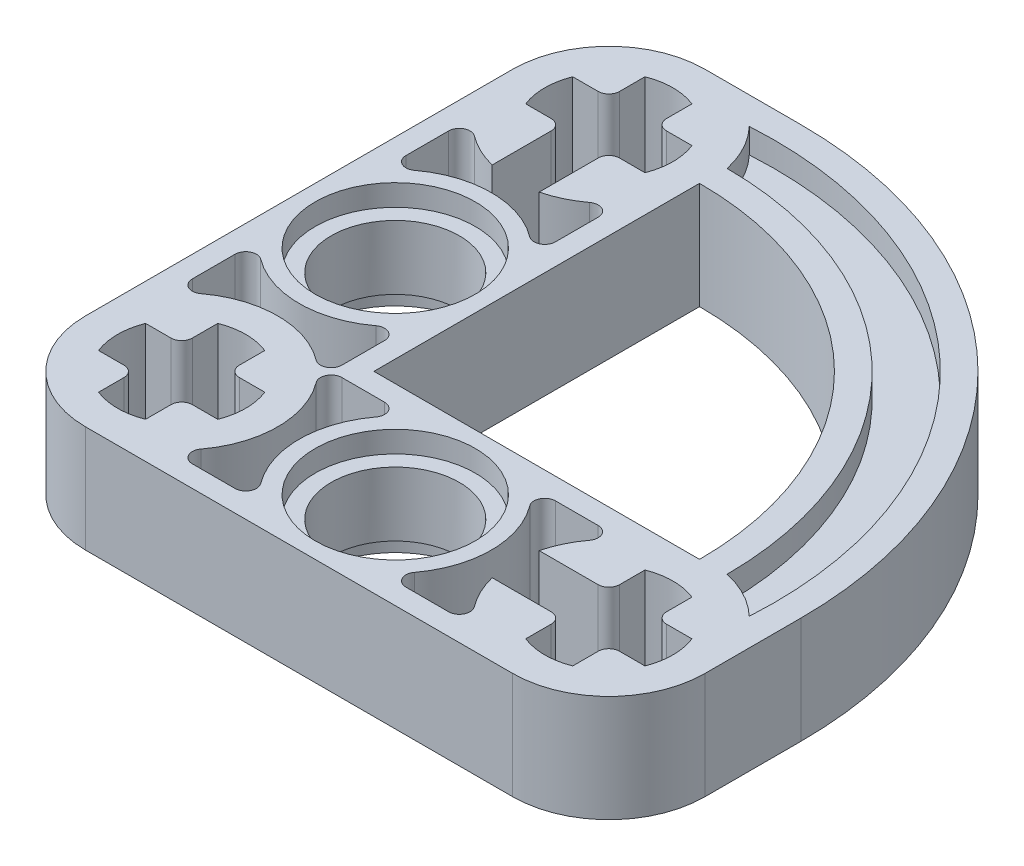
ISO-10303-21;
HEADER;
FILE_DESCRIPTION(('STEP AP214'),'2;1');
FILE_NAME('part.step','',(''),(''),'','','');
FILE_SCHEMA(('AUTOMOTIVE_DESIGN { 1 0 10303 214 1 1 1 1 }'));
ENDSEC;
DATA;
#1=APPLICATION_CONTEXT('core data for automotive mechanical design processes');
#2=APPLICATION_PROTOCOL_DEFINITION('international standard','automotive_design',2000,#1);
#3=PRODUCT_CONTEXT('',#1,'mechanical');
#4=PRODUCT('Part','Part','',(#3));
#5=PRODUCT_RELATED_PRODUCT_CATEGORY('part','',(#4));
#6=PRODUCT_DEFINITION_FORMATION('','',#4);
#7=PRODUCT_DEFINITION_CONTEXT('part definition',#1,'design');
#8=PRODUCT_DEFINITION('design','',#6,#7);
#9=PRODUCT_DEFINITION_SHAPE('','',#8);
#10=(LENGTH_UNIT() NAMED_UNIT(*) SI_UNIT(.MILLI.,.METRE.));
#11=(NAMED_UNIT(*) PLANE_ANGLE_UNIT() SI_UNIT($,.RADIAN.));
#12=(NAMED_UNIT(*) SI_UNIT($,.STERADIAN.) SOLID_ANGLE_UNIT());
#13=UNCERTAINTY_MEASURE_WITH_UNIT(LENGTH_MEASURE(1.E-05),#10,'distance_accuracy_value','');
#14=(GEOMETRIC_REPRESENTATION_CONTEXT(3) GLOBAL_UNCERTAINTY_ASSIGNED_CONTEXT((#13)) GLOBAL_UNIT_ASSIGNED_CONTEXT((#10,
#11,#12)) REPRESENTATION_CONTEXT('',''));
#15=CARTESIAN_POINT('',(0.,0.,0.));
#16=DIRECTION('',(0.,0.,1.));
#17=DIRECTION('',(1.,0.,0.));
#18=AXIS2_PLACEMENT_3D('',#15,#16,#17);
#19=CARTESIAN_POINT('',(-7.94500315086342,-0.0749999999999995,8.01000315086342));
#20=DIRECTION('',(0.,1.,0.));
#21=DIRECTION('',(0.,0.,1.));
#22=AXIS2_PLACEMENT_3D('',#19,#20,#21);
#23=CYLINDRICAL_SURFACE('',#22,2.4);
#24=CARTESIAN_POINT('',(-7.94500315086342,3.125,8.01000315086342));
#25=DIRECTION('',(0.,1.,0.));
#26=DIRECTION('',(0.,0.,1.));
#27=AXIS2_PLACEMENT_3D('',#24,#25,#26);
#28=CIRCLE('',#27,2.4);
#29=CARTESIAN_POINT('',(-7.94500315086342,3.125,10.4100031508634));
#30=VERTEX_POINT('',#29);
#31=EDGE_CURVE('E699',#30,#30,#28,.F.);
#32=ORIENTED_EDGE('',*,*,#31,.F.);
#33=EDGE_LOOP('',(#32));
#34=FACE_BOUND('',#33,.T.);
#35=CARTESIAN_POINT('',(-7.94500315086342,0.725000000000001,8.01000315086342));
#36=DIRECTION('',(0.,-1.,0.));
#37=DIRECTION('',(0.,0.,-1.));
#38=AXIS2_PLACEMENT_3D('',#35,#36,#37);
#39=CIRCLE('',#38,2.4);
#40=CARTESIAN_POINT('',(-7.94500315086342,0.725000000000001,5.61000315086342));
#41=VERTEX_POINT('',#40);
#42=EDGE_CURVE('E40',#41,#41,#39,.F.);
#43=ORIENTED_EDGE('',*,*,#42,.F.);
#44=EDGE_LOOP('',(#43));
#45=FACE_BOUND('',#44,.T.);
#46=ADVANCED_FACE('F36',(#34,#45),#23,.F.);
#47=CARTESIAN_POINT('',(0.0549968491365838,-0.0749999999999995,16.0100031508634));
#48=DIRECTION('',(0.,1.,0.));
#49=DIRECTION('',(0.,0.,1.));
#50=AXIS2_PLACEMENT_3D('',#47,#48,#49);
#51=CYLINDRICAL_SURFACE('',#50,2.40000000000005);
#52=CARTESIAN_POINT('',(0.0549968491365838,3.125,16.0100031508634));
#53=DIRECTION('',(0.,1.,0.));
#54=DIRECTION('',(0.,0.,1.));
#55=AXIS2_PLACEMENT_3D('',#52,#53,#54);
#56=CIRCLE('',#55,2.40000000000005);
#57=CARTESIAN_POINT('',(0.0549968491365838,3.125,18.4100031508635));
#58=VERTEX_POINT('',#57);
#59=EDGE_CURVE('E1441',#58,#58,#56,.F.);
#60=ORIENTED_EDGE('',*,*,#59,.F.);
#61=EDGE_LOOP('',(#60));
#62=FACE_BOUND('',#61,.T.);
#63=CARTESIAN_POINT('',(0.0549968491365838,0.725000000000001,16.0100031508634));
#64=DIRECTION('',(0.,-1.,0.));
#65=DIRECTION('',(0.,0.,-1.));
#66=AXIS2_PLACEMENT_3D('',#63,#64,#65);
#67=CIRCLE('',#66,2.40000000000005);
#68=CARTESIAN_POINT('',(0.0549968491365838,0.725000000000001,13.6100031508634));
#69=VERTEX_POINT('',#68);
#70=EDGE_CURVE('E1446',#69,#69,#67,.F.);
#71=ORIENTED_EDGE('',*,*,#70,.F.);
#72=EDGE_LOOP('',(#71));
#73=FACE_BOUND('',#72,.T.);
#74=ADVANCED_FACE('F1482',(#62,#73),#51,.F.);
#75=CARTESIAN_POINT('',(-4.34500315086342,3.925,12.4100031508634));
#76=DIRECTION('',(0.,-1.,0.));
#77=DIRECTION('',(0.,0.,-1.));
#78=AXIS2_PLACEMENT_3D('',#75,#76,#77);
#79=PLANE('',#78);
#80=CARTESIAN_POINT('',(-7.94500315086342,3.925,8.01000315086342));
#81=DIRECTION('',(0.,1.,0.));
#82=DIRECTION('',(0.,0.,1.));
#83=AXIS2_PLACEMENT_3D('',#80,#81,#82);
#84=CIRCLE('',#83,3.);
#85=CARTESIAN_POINT('',(-7.94500315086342,3.925,11.0100031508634));
#86=VERTEX_POINT('',#85);
#87=EDGE_CURVE('E1468',#86,#86,#84,.T.);
#88=ORIENTED_EDGE('',*,*,#87,.F.);
#89=EDGE_LOOP('',(#88));
#90=FACE_BOUND('',#89,.T.);
#91=CARTESIAN_POINT('',(0.0549968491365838,3.925,16.0100031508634));
#92=DIRECTION('',(0.,1.,0.));
#93=DIRECTION('',(0.,0.,1.));
#94=AXIS2_PLACEMENT_3D('',#91,#92,#93);
#95=CIRCLE('',#94,3.);
#96=CARTESIAN_POINT('',(0.0549968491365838,3.925,19.0100031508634));
#97=VERTEX_POINT('',#96);
#98=EDGE_CURVE('E681',#97,#97,#95,.T.);
#99=ORIENTED_EDGE('',*,*,#98,.F.);
#100=EDGE_LOOP('',(#99));
#101=FACE_BOUND('',#100,.T.);
#102=DIRECTION('',(0.,0.,1.));
#103=VECTOR('',#102,1.);
#104=CARTESIAN_POINT('',(-8.82500315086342,3.925,-2.22284256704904));
#105=LINE('',#104,#103);
#106=CARTESIAN_POINT('',(-8.82500315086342,3.925,-2.22284256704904));
#107=VERTEX_POINT('',#106);
#108=CARTESIAN_POINT('',(-8.82500315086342,3.925,-1.26999684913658));
#109=VERTEX_POINT('',#108);
#110=EDGE_CURVE('E1059',#107,#109,#105,.T.);
#111=ORIENTED_EDGE('',*,*,#110,.F.);
#112=CARTESIAN_POINT('',(-7.94500315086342,3.925,0.0100031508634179));
#113=DIRECTION('',(0.,1.,0.));
#114=DIRECTION('',(0.,0.,1.));
#115=AXIS2_PLACEMENT_3D('',#112,#113,#114);
#116=CIRCLE('',#115,2.4);
#117=CARTESIAN_POINT('',(-7.06500315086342,3.925,-2.22284256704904));
#118=VERTEX_POINT('',#117);
#119=EDGE_CURVE('E53',#118,#107,#116,.T.);
#120=ORIENTED_EDGE('',*,*,#119,.F.);
#121=DIRECTION('',(0.,0.,-1.));
#122=VECTOR('',#121,1.);
#123=CARTESIAN_POINT('',(-7.06500315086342,3.925,-1.26999684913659));
#124=LINE('',#123,#122);
#125=CARTESIAN_POINT('',(-7.06500315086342,3.925,-1.26999684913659));
#126=VERTEX_POINT('',#125);
#127=EDGE_CURVE('E988',#126,#118,#124,.T.);
#128=ORIENTED_EDGE('',*,*,#127,.F.);
#129=CARTESIAN_POINT('',(-6.66500315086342,3.925,-1.26999684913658));
#130=DIRECTION('',(0.,-1.,0.));
#131=DIRECTION('',(0.,0.,-1.));
#132=AXIS2_PLACEMENT_3D('',#129,#130,#131);
#133=CIRCLE('',#132,0.4);
#134=CARTESIAN_POINT('',(-6.66500315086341,3.925,-0.869996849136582));
#135=VERTEX_POINT('',#134);
#136=EDGE_CURVE('E1122',#135,#126,#133,.T.);
#137=ORIENTED_EDGE('',*,*,#136,.F.);
#138=DIRECTION('',(-1.,0.,0.));
#139=VECTOR('',#138,1.);
#140=CARTESIAN_POINT('',(-5.71215743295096,3.925,-0.869996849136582));
#141=LINE('',#140,#139);
#142=CARTESIAN_POINT('',(-5.71215743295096,3.925,-0.869996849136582));
#143=VERTEX_POINT('',#142);
#144=EDGE_CURVE('E1119',#143,#135,#141,.T.);
#145=ORIENTED_EDGE('',*,*,#144,.F.);
#146=CARTESIAN_POINT('',(-7.94500315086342,3.925,0.0100031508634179));
#147=DIRECTION('',(0.,1.,0.));
#148=DIRECTION('',(0.,0.,1.));
#149=AXIS2_PLACEMENT_3D('',#146,#147,#148);
#150=CIRCLE('',#149,2.4);
#151=CARTESIAN_POINT('',(-5.71215743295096,3.925,0.890003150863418));
#152=VERTEX_POINT('',#151);
#153=EDGE_CURVE('E1116',#152,#143,#150,.T.);
#154=ORIENTED_EDGE('',*,*,#153,.F.);
#155=DIRECTION('',(1.,0.,0.));
#156=VECTOR('',#155,1.);
#157=CARTESIAN_POINT('',(-6.66500315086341,3.925,0.890003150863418));
#158=LINE('',#157,#156);
#159=CARTESIAN_POINT('',(-6.66500315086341,3.925,0.890003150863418));
#160=VERTEX_POINT('',#159);
#161=EDGE_CURVE('E1113',#160,#152,#158,.T.);
#162=ORIENTED_EDGE('',*,*,#161,.F.);
#163=CARTESIAN_POINT('',(-6.66500315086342,3.925,1.29000315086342));
#164=DIRECTION('',(0.,-1.,0.));
#165=DIRECTION('',(0.,0.,-1.));
#166=AXIS2_PLACEMENT_3D('',#163,#164,#165);
#167=CIRCLE('',#166,0.4);
#168=CARTESIAN_POINT('',(-7.06500315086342,3.925,1.29000315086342));
#169=VERTEX_POINT('',#168);
#170=EDGE_CURVE('E1110',#169,#160,#167,.T.);
#171=ORIENTED_EDGE('',*,*,#170,.F.);
#172=DIRECTION('',(0.,0.,-1.));
#173=VECTOR('',#172,1.);
#174=CARTESIAN_POINT('',(-7.06500315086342,3.925,2.24284886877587));
#175=LINE('',#174,#173);
#176=CARTESIAN_POINT('',(-7.06500315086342,3.925,3.50079102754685));
#177=VERTEX_POINT('',#176);
#178=EDGE_CURVE('E1107',#177,#169,#175,.T.);
#179=ORIENTED_EDGE('',*,*,#178,.F.);
#180=CARTESIAN_POINT('',(-7.94500315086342,3.925,0.0100031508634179));
#181=DIRECTION('',(0.,-1.,0.));
#182=DIRECTION('',(0.,0.,1.));
#183=AXIS2_PLACEMENT_3D('',#180,#181,#182);
#184=CIRCLE('',#183,3.6);
#185=CARTESIAN_POINT('',(-5.78500315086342,3.925,2.89000315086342));
#186=VERTEX_POINT('',#185);
#187=EDGE_CURVE('E1104',#186,#177,#184,.T.);
#188=ORIENTED_EDGE('',*,*,#187,.F.);
#189=CARTESIAN_POINT('',(-5.54500315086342,3.925,3.21000315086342));
#190=DIRECTION('',(0.,1.,0.));
#191=DIRECTION('',(0.,0.,-1.));
#192=AXIS2_PLACEMENT_3D('',#189,#190,#191);
#193=CIRCLE('',#192,0.399999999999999);
#194=CARTESIAN_POINT('',(-5.14500315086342,3.925,3.21000315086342));
#195=VERTEX_POINT('',#194);
#196=EDGE_CURVE('E1101',#195,#186,#193,.T.);
#197=ORIENTED_EDGE('',*,*,#196,.F.);
#198=DIRECTION('',(0.,0.,-1.));
#199=VECTOR('',#198,1.);
#200=CARTESIAN_POINT('',(-5.14500315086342,3.925,3.21000315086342));
#201=LINE('',#200,#199);
#202=CARTESIAN_POINT('',(-5.14500315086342,3.925,4.81000315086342));
#203=VERTEX_POINT('',#202);
#204=EDGE_CURVE('E1098',#203,#195,#201,.T.);
#205=ORIENTED_EDGE('',*,*,#204,.F.);
#206=CARTESIAN_POINT('',(-5.54500315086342,3.925,4.81000315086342));
#207=DIRECTION('',(0.,1.,0.));
#208=DIRECTION('',(0.,0.,1.));
#209=AXIS2_PLACEMENT_3D('',#206,#207,#208);
#210=CIRCLE('',#209,0.4);
#211=CARTESIAN_POINT('',(-5.78500315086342,3.925,5.13000315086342));
#212=VERTEX_POINT('',#211);
#213=EDGE_CURVE('E1095',#212,#203,#210,.T.);
#214=ORIENTED_EDGE('',*,*,#213,.F.);
#215=CARTESIAN_POINT('',(-7.94500315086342,3.925,8.01000315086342));
#216=DIRECTION('',(0.,-1.,0.));
#217=DIRECTION('',(0.,0.,1.));
#218=AXIS2_PLACEMENT_3D('',#215,#216,#217);
#219=CIRCLE('',#218,3.6);
#220=CARTESIAN_POINT('',(-10.1050031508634,3.925,5.13000315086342));
#221=VERTEX_POINT('',#220);
#222=EDGE_CURVE('E1092',#221,#212,#219,.T.);
#223=ORIENTED_EDGE('',*,*,#222,.F.);
#224=CARTESIAN_POINT('',(-10.3450031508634,3.925,4.81000315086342));
#225=DIRECTION('',(0.,1.,0.));
#226=DIRECTION('',(0.,0.,-1.));
#227=AXIS2_PLACEMENT_3D('',#224,#225,#226);
#228=CIRCLE('',#227,0.4);
#229=CARTESIAN_POINT('',(-10.7450031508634,3.925,4.81000315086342));
#230=VERTEX_POINT('',#229);
#231=EDGE_CURVE('E1089',#230,#221,#228,.T.);
#232=ORIENTED_EDGE('',*,*,#231,.F.);
#233=DIRECTION('',(0.,0.,1.));
#234=VECTOR('',#233,1.);
#235=CARTESIAN_POINT('',(-10.7450031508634,3.925,3.21000315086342));
#236=LINE('',#235,#234);
#237=CARTESIAN_POINT('',(-10.7450031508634,3.925,3.21000315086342));
#238=VERTEX_POINT('',#237);
#239=EDGE_CURVE('E1086',#238,#230,#236,.T.);
#240=ORIENTED_EDGE('',*,*,#239,.F.);
#241=CARTESIAN_POINT('',(-10.3450031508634,3.925,3.21000315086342));
#242=DIRECTION('',(0.,1.,0.));
#243=DIRECTION('',(0.,0.,1.));
#244=AXIS2_PLACEMENT_3D('',#241,#242,#243);
#245=CIRCLE('',#244,0.4);
#246=CARTESIAN_POINT('',(-10.1050031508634,3.925,2.89000315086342));
#247=VERTEX_POINT('',#246);
#248=EDGE_CURVE('E1083',#247,#238,#245,.T.);
#249=ORIENTED_EDGE('',*,*,#248,.F.);
#250=CARTESIAN_POINT('',(-7.94500315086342,3.925,0.0100031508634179));
#251=DIRECTION('',(0.,-1.,0.));
#252=DIRECTION('',(0.,0.,1.));
#253=AXIS2_PLACEMENT_3D('',#250,#251,#252);
#254=CIRCLE('',#253,3.6);
#255=CARTESIAN_POINT('',(-8.82500315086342,3.925,3.50079102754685));
#256=VERTEX_POINT('',#255);
#257=EDGE_CURVE('E1080',#256,#247,#254,.T.);
#258=ORIENTED_EDGE('',*,*,#257,.F.);
#259=DIRECTION('',(0.,0.,1.));
#260=VECTOR('',#259,1.);
#261=CARTESIAN_POINT('',(-8.82500315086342,3.925,2.24284886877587));
#262=LINE('',#261,#260);
#263=CARTESIAN_POINT('',(-8.82500315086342,3.925,1.29000315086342));
#264=VERTEX_POINT('',#263);
#265=EDGE_CURVE('E1077',#264,#256,#262,.T.);
#266=ORIENTED_EDGE('',*,*,#265,.F.);
#267=CARTESIAN_POINT('',(-9.22500315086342,3.925,1.29000315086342));
#268=DIRECTION('',(0.,-1.,0.));
#269=DIRECTION('',(0.,0.,1.));
#270=AXIS2_PLACEMENT_3D('',#267,#268,#269);
#271=CIRCLE('',#270,0.4);
#272=CARTESIAN_POINT('',(-9.22500315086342,3.925,0.890003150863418));
#273=VERTEX_POINT('',#272);
#274=EDGE_CURVE('E1074',#273,#264,#271,.T.);
#275=ORIENTED_EDGE('',*,*,#274,.F.);
#276=DIRECTION('',(1.,0.,0.));
#277=VECTOR('',#276,1.);
#278=CARTESIAN_POINT('',(-10.1778488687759,3.925,0.890003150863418));
#279=LINE('',#278,#277);
#280=CARTESIAN_POINT('',(-10.1778488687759,3.925,0.890003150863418));
#281=VERTEX_POINT('',#280);
#282=EDGE_CURVE('E1071',#281,#273,#279,.T.);
#283=ORIENTED_EDGE('',*,*,#282,.F.);
#284=CARTESIAN_POINT('',(-7.94500315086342,3.925,0.0100031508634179));
#285=DIRECTION('',(0.,1.,0.));
#286=DIRECTION('',(0.,0.,1.));
#287=AXIS2_PLACEMENT_3D('',#284,#285,#286);
#288=CIRCLE('',#287,2.4);
#289=CARTESIAN_POINT('',(-10.1778488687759,3.925,-0.869996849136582));
#290=VERTEX_POINT('',#289);
#291=EDGE_CURVE('E1068',#290,#281,#288,.T.);
#292=ORIENTED_EDGE('',*,*,#291,.F.);
#293=DIRECTION('',(-1.,0.,0.));
#294=VECTOR('',#293,1.);
#295=CARTESIAN_POINT('',(-9.22500315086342,3.925,-0.869996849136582));
#296=LINE('',#295,#294);
#297=CARTESIAN_POINT('',(-9.22500315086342,3.925,-0.869996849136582));
#298=VERTEX_POINT('',#297);
#299=EDGE_CURVE('E1065',#298,#290,#296,.T.);
#300=ORIENTED_EDGE('',*,*,#299,.F.);
#301=CARTESIAN_POINT('',(-9.22500315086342,3.925,-1.26999684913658));
#302=DIRECTION('',(0.,-1.,0.));
#303=DIRECTION('',(0.,0.,-1.));
#304=AXIS2_PLACEMENT_3D('',#301,#302,#303);
#305=CIRCLE('',#304,0.4);
#306=EDGE_CURVE('E1062',#109,#298,#305,.T.);
#307=ORIENTED_EDGE('',*,*,#306,.F.);
#308=EDGE_LOOP('',(#111,#120,#128,#137,#145,#154,#162,#171,#179,#188,#197,#205,#214,#223,#232,
#240,#249,#258,#266,#275,#283,#292,#300,#307));
#309=FACE_BOUND('',#308,.T.);
#310=DIRECTION('',(-1.,0.,0.));
#311=VECTOR('',#310,1.);
#312=CARTESIAN_POINT('',(10.287842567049,3.925,15.1300031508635));
#313=LINE('',#312,#311);
#314=CARTESIAN_POINT('',(10.287842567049,3.925,15.1300031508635));
#315=VERTEX_POINT('',#314);
#316=CARTESIAN_POINT('',(9.33499684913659,3.925,15.1300031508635));
#317=VERTEX_POINT('',#316);
#318=EDGE_CURVE('E867',#315,#317,#313,.T.);
#319=ORIENTED_EDGE('',*,*,#318,.F.);
#320=CARTESIAN_POINT('',(8.05499684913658,3.925,16.0100031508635));
#321=DIRECTION('',(0.,1.,0.));
#322=DIRECTION('',(0.,0.,1.));
#323=AXIS2_PLACEMENT_3D('',#320,#321,#322);
#324=CIRCLE('',#323,2.4);
#325=CARTESIAN_POINT('',(10.287842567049,3.925,16.8900031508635));
#326=VERTEX_POINT('',#325);
#327=EDGE_CURVE('E61',#326,#315,#324,.T.);
#328=ORIENTED_EDGE('',*,*,#327,.F.);
#329=DIRECTION('',(1.,0.,0.));
#330=VECTOR('',#329,1.);
#331=CARTESIAN_POINT('',(9.33499684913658,3.925,16.8900031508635));
#332=LINE('',#331,#330);
#333=CARTESIAN_POINT('',(9.33499684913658,3.925,16.8900031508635));
#334=VERTEX_POINT('',#333);
#335=EDGE_CURVE('E796',#334,#326,#332,.T.);
#336=ORIENTED_EDGE('',*,*,#335,.F.);
#337=CARTESIAN_POINT('',(9.33499684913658,3.925,17.2900031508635));
#338=DIRECTION('',(0.,-1.,0.));
#339=DIRECTION('',(0.,0.,-1.));
#340=AXIS2_PLACEMENT_3D('',#337,#338,#339);
#341=CIRCLE('',#340,0.4);
#342=CARTESIAN_POINT('',(8.93499684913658,3.925,17.2900031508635));
#343=VERTEX_POINT('',#342);
#344=EDGE_CURVE('E931',#343,#334,#341,.T.);
#345=ORIENTED_EDGE('',*,*,#344,.F.);
#346=DIRECTION('',(0.,0.,-1.));
#347=VECTOR('',#346,1.);
#348=CARTESIAN_POINT('',(8.93499684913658,3.925,18.2428488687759));
#349=LINE('',#348,#347);
#350=CARTESIAN_POINT('',(8.93499684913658,3.925,18.2428488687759));
#351=VERTEX_POINT('',#350);
#352=EDGE_CURVE('E928',#351,#343,#349,.T.);
#353=ORIENTED_EDGE('',*,*,#352,.F.);
#354=CARTESIAN_POINT('',(8.05499684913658,3.925,16.0100031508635));
#355=DIRECTION('',(0.,1.,0.));
#356=DIRECTION('',(0.,0.,1.));
#357=AXIS2_PLACEMENT_3D('',#354,#355,#356);
#358=CIRCLE('',#357,2.4);
#359=CARTESIAN_POINT('',(7.17499684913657,3.925,18.2428488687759));
#360=VERTEX_POINT('',#359);
#361=EDGE_CURVE('E925',#360,#351,#358,.T.);
#362=ORIENTED_EDGE('',*,*,#361,.F.);
#363=DIRECTION('',(0.,0.,1.));
#364=VECTOR('',#363,1.);
#365=CARTESIAN_POINT('',(7.17499684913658,3.925,17.2900031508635));
#366=LINE('',#365,#364);
#367=CARTESIAN_POINT('',(7.17499684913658,3.925,17.2900031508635));
#368=VERTEX_POINT('',#367);
#369=EDGE_CURVE('E922',#368,#360,#366,.T.);
#370=ORIENTED_EDGE('',*,*,#369,.F.);
#371=CARTESIAN_POINT('',(6.77499684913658,3.925,17.2900031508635));
#372=DIRECTION('',(0.,-1.,0.));
#373=DIRECTION('',(0.,0.,-1.));
#374=AXIS2_PLACEMENT_3D('',#371,#372,#373);
#375=CIRCLE('',#374,0.399999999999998);
#376=CARTESIAN_POINT('',(6.77499684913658,3.925,16.8900031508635));
#377=VERTEX_POINT('',#376);
#378=EDGE_CURVE('E919',#377,#368,#375,.T.);
#379=ORIENTED_EDGE('',*,*,#378,.F.);
#380=DIRECTION('',(1.,0.,0.));
#381=VECTOR('',#380,1.);
#382=CARTESIAN_POINT('',(5.82215113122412,3.925,16.8900031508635));
#383=LINE('',#382,#381);
#384=CARTESIAN_POINT('',(4.56420897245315,3.925,16.8900031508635));
#385=VERTEX_POINT('',#384);
#386=EDGE_CURVE('E916',#385,#377,#383,.T.);
#387=ORIENTED_EDGE('',*,*,#386,.F.);
#388=CARTESIAN_POINT('',(8.05499684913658,3.925,16.0100031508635));
#389=DIRECTION('',(0.,-1.,0.));
#390=DIRECTION('',(0.,0.,1.));
#391=AXIS2_PLACEMENT_3D('',#388,#389,#390);
#392=CIRCLE('',#391,3.6);
#393=CARTESIAN_POINT('',(5.17499684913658,3.925,18.1700031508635));
#394=VERTEX_POINT('',#393);
#395=EDGE_CURVE('E913',#394,#385,#392,.T.);
#396=ORIENTED_EDGE('',*,*,#395,.F.);
#397=CARTESIAN_POINT('',(4.85499684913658,3.925,18.4100031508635));
#398=DIRECTION('',(0.,1.,0.));
#399=DIRECTION('',(0.,0.,-1.));
#400=AXIS2_PLACEMENT_3D('',#397,#398,#399);
#401=CIRCLE('',#400,0.4);
#402=CARTESIAN_POINT('',(4.85499684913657,3.925,18.8100031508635));
#403=VERTEX_POINT('',#402);
#404=EDGE_CURVE('E910',#403,#394,#401,.T.);
#405=ORIENTED_EDGE('',*,*,#404,.F.);
#406=DIRECTION('',(1.,0.,0.));
#407=VECTOR('',#406,1.);
#408=CARTESIAN_POINT('',(4.85499684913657,3.925,18.8100031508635));
#409=LINE('',#408,#407);
#410=CARTESIAN_POINT('',(3.25499684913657,3.925,18.8100031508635));
#411=VERTEX_POINT('',#410);
#412=EDGE_CURVE('E907',#411,#403,#409,.T.);
#413=ORIENTED_EDGE('',*,*,#412,.F.);
#414=CARTESIAN_POINT('',(3.25499684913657,3.925,18.4100031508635));
#415=DIRECTION('',(0.,1.,0.));
#416=DIRECTION('',(0.,0.,1.));
#417=AXIS2_PLACEMENT_3D('',#414,#415,#416);
#418=CIRCLE('',#417,0.399999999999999);
#419=CARTESIAN_POINT('',(2.93499684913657,3.925,18.1700031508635));
#420=VERTEX_POINT('',#419);
#421=EDGE_CURVE('E904',#420,#411,#418,.T.);
#422=ORIENTED_EDGE('',*,*,#421,.F.);
#423=CARTESIAN_POINT('',(0.0549968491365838,3.925,16.0100031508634));
#424=DIRECTION('',(0.,-1.,0.));
#425=DIRECTION('',(0.,0.,1.));
#426=AXIS2_PLACEMENT_3D('',#423,#424,#425);
#427=CIRCLE('',#426,3.6);
#428=CARTESIAN_POINT('',(2.93499684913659,3.925,13.8500031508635));
#429=VERTEX_POINT('',#428);
#430=EDGE_CURVE('E901',#429,#420,#427,.T.);
#431=ORIENTED_EDGE('',*,*,#430,.F.);
#432=CARTESIAN_POINT('',(3.25499684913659,3.925,13.6100031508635));
#433=DIRECTION('',(0.,1.,0.));
#434=DIRECTION('',(0.,0.,-1.));
#435=AXIS2_PLACEMENT_3D('',#432,#433,#434);
#436=CIRCLE('',#435,0.399999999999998);
#437=CARTESIAN_POINT('',(3.25499684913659,3.925,13.2100031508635));
#438=VERTEX_POINT('',#437);
#439=EDGE_CURVE('E898',#438,#429,#436,.T.);
#440=ORIENTED_EDGE('',*,*,#439,.F.);
#441=DIRECTION('',(-1.,0.,0.));
#442=VECTOR('',#441,1.);
#443=CARTESIAN_POINT('',(4.85499684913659,3.925,13.2100031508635));
#444=LINE('',#443,#442);
#445=CARTESIAN_POINT('',(4.85499684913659,3.925,13.2100031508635));
#446=VERTEX_POINT('',#445);
#447=EDGE_CURVE('E895',#446,#438,#444,.T.);
#448=ORIENTED_EDGE('',*,*,#447,.F.);
#449=CARTESIAN_POINT('',(4.85499684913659,3.925,13.6100031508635));
#450=DIRECTION('',(0.,1.,0.));
#451=DIRECTION('',(0.,0.,1.));
#452=AXIS2_PLACEMENT_3D('',#449,#450,#451);
#453=CIRCLE('',#452,0.4);
#454=CARTESIAN_POINT('',(5.17499684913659,3.925,13.8500031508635));
#455=VERTEX_POINT('',#454);
#456=EDGE_CURVE('E892',#455,#446,#453,.T.);
#457=ORIENTED_EDGE('',*,*,#456,.F.);
#458=CARTESIAN_POINT('',(8.05499684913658,3.925,16.0100031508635));
#459=DIRECTION('',(0.,-1.,0.));
#460=DIRECTION('',(0.,0.,1.));
#461=AXIS2_PLACEMENT_3D('',#458,#459,#460);
#462=CIRCLE('',#461,3.6);
#463=CARTESIAN_POINT('',(4.56420897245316,3.925,15.1300031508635));
#464=VERTEX_POINT('',#463);
#465=EDGE_CURVE('E889',#464,#455,#462,.T.);
#466=ORIENTED_EDGE('',*,*,#465,.F.);
#467=DIRECTION('',(-1.,0.,0.));
#468=VECTOR('',#467,1.);
#469=CARTESIAN_POINT('',(5.82215113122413,3.925,15.1300031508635));
#470=LINE('',#469,#468);
#471=CARTESIAN_POINT('',(6.77499684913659,3.925,15.1300031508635));
#472=VERTEX_POINT('',#471);
#473=EDGE_CURVE('E886',#472,#464,#470,.T.);
#474=ORIENTED_EDGE('',*,*,#473,.F.);
#475=CARTESIAN_POINT('',(6.77499684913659,3.925,14.7300031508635));
#476=DIRECTION('',(0.,-1.,0.));
#477=DIRECTION('',(0.,0.,1.));
#478=AXIS2_PLACEMENT_3D('',#475,#476,#477);
#479=CIRCLE('',#478,0.4);
#480=CARTESIAN_POINT('',(7.17499684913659,3.925,14.7300031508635));
#481=VERTEX_POINT('',#480);
#482=EDGE_CURVE('E883',#481,#472,#479,.T.);
#483=ORIENTED_EDGE('',*,*,#482,.F.);
#484=DIRECTION('',(0.,0.,1.));
#485=VECTOR('',#484,1.);
#486=CARTESIAN_POINT('',(7.17499684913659,3.925,13.777157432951));
#487=LINE('',#486,#485);
#488=CARTESIAN_POINT('',(7.17499684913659,3.925,13.777157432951));
#489=VERTEX_POINT('',#488);
#490=EDGE_CURVE('E880',#489,#481,#487,.T.);
#491=ORIENTED_EDGE('',*,*,#490,.F.);
#492=CARTESIAN_POINT('',(8.05499684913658,3.925,16.0100031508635));
#493=DIRECTION('',(0.,1.,0.));
#494=DIRECTION('',(0.,0.,1.));
#495=AXIS2_PLACEMENT_3D('',#492,#493,#494);
#496=CIRCLE('',#495,2.4);
#497=CARTESIAN_POINT('',(8.93499684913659,3.925,13.777157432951));
#498=VERTEX_POINT('',#497);
#499=EDGE_CURVE('E877',#498,#489,#496,.T.);
#500=ORIENTED_EDGE('',*,*,#499,.F.);
#501=DIRECTION('',(0.,0.,-1.));
#502=VECTOR('',#501,1.);
#503=CARTESIAN_POINT('',(8.93499684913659,3.925,14.7300031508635));
#504=LINE('',#503,#502);
#505=CARTESIAN_POINT('',(8.93499684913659,3.925,14.7300031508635));
#506=VERTEX_POINT('',#505);
#507=EDGE_CURVE('E874',#506,#498,#504,.T.);
#508=ORIENTED_EDGE('',*,*,#507,.F.);
#509=CARTESIAN_POINT('',(9.33499684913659,3.925,14.7300031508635));
#510=DIRECTION('',(0.,-1.,0.));
#511=DIRECTION('',(0.,0.,-1.));
#512=AXIS2_PLACEMENT_3D('',#509,#510,#511);
#513=CIRCLE('',#512,0.399999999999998);
#514=EDGE_CURVE('E871',#317,#506,#513,.T.);
#515=ORIENTED_EDGE('',*,*,#514,.F.);
#516=EDGE_LOOP('',(#319,#328,#336,#345,#353,#362,#370,#379,#387,#396,#405,#413,#422,#431,#440,
#448,#457,#466,#474,#483,#491,#500,#508,#515));
#517=FACE_BOUND('',#516,.T.);
#518=DIRECTION('',(-1.,0.,0.));
#519=VECTOR('',#518,1.);
#520=CARTESIAN_POINT('',(-3.1450031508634,3.925,13.2100031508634));
#521=LINE('',#520,#519);
#522=CARTESIAN_POINT('',(-3.1450031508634,3.925,13.2100031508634));
#523=VERTEX_POINT('',#522);
#524=CARTESIAN_POINT('',(-4.74500315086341,3.925,13.2100031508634));
#525=VERTEX_POINT('',#524);
#526=EDGE_CURVE('E698',#523,#525,#521,.T.);
#527=ORIENTED_EDGE('',*,*,#526,.F.);
#528=CARTESIAN_POINT('',(-3.14500315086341,3.925,13.6100031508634));
#529=DIRECTION('',(0.,1.,0.));
#530=DIRECTION('',(0.,0.,1.));
#531=AXIS2_PLACEMENT_3D('',#528,#529,#530);
#532=CIRCLE('',#531,0.400000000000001);
#533=CARTESIAN_POINT('',(-2.8250031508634,3.925,13.8500031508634));
#534=VERTEX_POINT('',#533);
#535=EDGE_CURVE('E656',#534,#523,#532,.T.);
#536=ORIENTED_EDGE('',*,*,#535,.F.);
#537=CARTESIAN_POINT('',(0.0549968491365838,3.925,16.0100031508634));
#538=DIRECTION('',(0.,-1.,0.));
#539=DIRECTION('',(0.,0.,1.));
#540=AXIS2_PLACEMENT_3D('',#537,#538,#539);
#541=CIRCLE('',#540,3.6);
#542=CARTESIAN_POINT('',(-2.82500315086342,3.925,18.1700031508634));
#543=VERTEX_POINT('',#542);
#544=EDGE_CURVE('E675',#543,#534,#541,.T.);
#545=ORIENTED_EDGE('',*,*,#544,.F.);
#546=CARTESIAN_POINT('',(-3.14500315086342,3.925,18.4100031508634));
#547=DIRECTION('',(0.,1.,0.));
#548=DIRECTION('',(0.,0.,-1.));
#549=AXIS2_PLACEMENT_3D('',#546,#547,#548);
#550=CIRCLE('',#549,0.400000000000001);
#551=CARTESIAN_POINT('',(-3.14500315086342,3.925,18.8100031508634));
#552=VERTEX_POINT('',#551);
#553=EDGE_CURVE('E678',#552,#543,#550,.T.);
#554=ORIENTED_EDGE('',*,*,#553,.F.);
#555=DIRECTION('',(1.,0.,0.));
#556=VECTOR('',#555,1.);
#557=CARTESIAN_POINT('',(-3.14500315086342,3.925,18.8100031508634));
#558=LINE('',#557,#556);
#559=CARTESIAN_POINT('',(-4.74500315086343,3.925,18.8100031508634));
#560=VERTEX_POINT('',#559);
#561=EDGE_CURVE('E710',#560,#552,#558,.T.);
#562=ORIENTED_EDGE('',*,*,#561,.F.);
#563=CARTESIAN_POINT('',(-4.74500315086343,3.925,18.4100031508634));
#564=DIRECTION('',(0.,1.,0.));
#565=DIRECTION('',(0.,0.,1.));
#566=AXIS2_PLACEMENT_3D('',#563,#564,#565);
#567=CIRCLE('',#566,0.400000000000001);
#568=CARTESIAN_POINT('',(-5.06500315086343,3.925,18.1700031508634));
#569=VERTEX_POINT('',#568);
#570=EDGE_CURVE('E707',#569,#560,#567,.T.);
#571=ORIENTED_EDGE('',*,*,#570,.F.);
#572=CARTESIAN_POINT('',(-7.94500315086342,3.925,16.0100031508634));
#573=DIRECTION('',(0.,-1.,0.));
#574=DIRECTION('',(0.,0.,1.));
#575=AXIS2_PLACEMENT_3D('',#572,#573,#574);
#576=CIRCLE('',#575,3.6);
#577=CARTESIAN_POINT('',(-5.06500315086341,3.925,13.8500031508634));
#578=VERTEX_POINT('',#577);
#579=EDGE_CURVE('E704',#578,#569,#576,.T.);
#580=ORIENTED_EDGE('',*,*,#579,.F.);
#581=CARTESIAN_POINT('',(-4.74500315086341,3.925,13.6100031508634));
#582=DIRECTION('',(0.,1.,0.));
#583=DIRECTION('',(0.,0.,-1.));
#584=AXIS2_PLACEMENT_3D('',#581,#582,#583);
#585=CIRCLE('',#584,0.4);
#586=EDGE_CURVE('E701',#525,#578,#585,.T.);
#587=ORIENTED_EDGE('',*,*,#586,.F.);
#588=EDGE_LOOP('',(#527,#536,#545,#554,#562,#571,#580,#587));
#589=FACE_BOUND('',#588,.T.);
#590=DIRECTION('',(0.,0.,1.));
#591=VECTOR('',#590,1.);
#592=CARTESIAN_POINT('',(-10.7450031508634,3.925,11.2100031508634));
#593=LINE('',#592,#591);
#594=CARTESIAN_POINT('',(-10.7450031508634,3.925,11.2100031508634));
#595=VERTEX_POINT('',#594);
#596=CARTESIAN_POINT('',(-10.7450031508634,3.925,12.8100031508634));
#597=VERTEX_POINT('',#596);
#598=EDGE_CURVE('E756',#595,#597,#593,.T.);
#599=ORIENTED_EDGE('',*,*,#598,.F.);
#600=CARTESIAN_POINT('',(-10.3450031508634,3.925,11.2100031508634));
#601=DIRECTION('',(0.,1.,0.));
#602=DIRECTION('',(0.,0.,1.));
#603=AXIS2_PLACEMENT_3D('',#600,#601,#602);
#604=CIRCLE('',#603,0.4);
#605=CARTESIAN_POINT('',(-10.1050031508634,3.925,10.8900031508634));
#606=VERTEX_POINT('',#605);
#607=EDGE_CURVE('E717',#606,#595,#604,.T.);
#608=ORIENTED_EDGE('',*,*,#607,.F.);
#609=CARTESIAN_POINT('',(-7.94500315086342,3.925,8.01000315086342));
#610=DIRECTION('',(0.,-1.,0.));
#611=DIRECTION('',(0.,0.,1.));
#612=AXIS2_PLACEMENT_3D('',#609,#610,#611);
#613=CIRCLE('',#612,3.6);
#614=CARTESIAN_POINT('',(-5.78500315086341,3.925,10.8900031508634));
#615=VERTEX_POINT('',#614);
#616=EDGE_CURVE('E733',#615,#606,#613,.T.);
#617=ORIENTED_EDGE('',*,*,#616,.F.);
#618=CARTESIAN_POINT('',(-5.54500315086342,3.925,11.2100031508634));
#619=DIRECTION('',(0.,1.,0.));
#620=DIRECTION('',(0.,0.,-1.));
#621=AXIS2_PLACEMENT_3D('',#618,#619,#620);
#622=CIRCLE('',#621,0.4);
#623=CARTESIAN_POINT('',(-5.14500315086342,3.925,11.2100031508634));
#624=VERTEX_POINT('',#623);
#625=EDGE_CURVE('E771',#624,#615,#622,.T.);
#626=ORIENTED_EDGE('',*,*,#625,.F.);
#627=DIRECTION('',(0.,0.,-1.));
#628=VECTOR('',#627,1.);
#629=CARTESIAN_POINT('',(-5.14500315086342,3.925,11.2100031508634));
#630=LINE('',#629,#628);
#631=CARTESIAN_POINT('',(-5.14500315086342,3.925,12.8100031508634));
#632=VERTEX_POINT('',#631);
#633=EDGE_CURVE('E768',#632,#624,#630,.T.);
#634=ORIENTED_EDGE('',*,*,#633,.F.);
#635=CARTESIAN_POINT('',(-5.54500315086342,3.925,12.8100031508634));
#636=DIRECTION('',(0.,1.,0.));
#637=DIRECTION('',(0.,0.,1.));
#638=AXIS2_PLACEMENT_3D('',#635,#636,#637);
#639=CIRCLE('',#638,0.4);
#640=CARTESIAN_POINT('',(-5.78500315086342,3.925,13.1300031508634));
#641=VERTEX_POINT('',#640);
#642=EDGE_CURVE('E765',#641,#632,#639,.T.);
#643=ORIENTED_EDGE('',*,*,#642,.F.);
#644=CARTESIAN_POINT('',(-7.94500315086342,3.925,16.0100031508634));
#645=DIRECTION('',(0.,-1.,0.));
#646=DIRECTION('',(0.,0.,1.));
#647=AXIS2_PLACEMENT_3D('',#644,#645,#646);
#648=CIRCLE('',#647,3.6);
#649=CARTESIAN_POINT('',(-10.1050031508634,3.925,13.1300031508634));
#650=VERTEX_POINT('',#649);
#651=EDGE_CURVE('E762',#650,#641,#648,.T.);
#652=ORIENTED_EDGE('',*,*,#651,.F.);
#653=CARTESIAN_POINT('',(-10.3450031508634,3.925,12.8100031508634));
#654=DIRECTION('',(0.,1.,0.));
#655=DIRECTION('',(0.,0.,-1.));
#656=AXIS2_PLACEMENT_3D('',#653,#654,#655);
#657=CIRCLE('',#656,0.4);
#658=EDGE_CURVE('E759',#597,#650,#657,.T.);
#659=ORIENTED_EDGE('',*,*,#658,.F.);
#660=EDGE_LOOP('',(#599,#608,#617,#626,#634,#643,#652,#659));
#661=FACE_BOUND('',#660,.T.);
#662=DIRECTION('',(-1.,0.,0.));
#663=VECTOR('',#662,1.);
#664=CARTESIAN_POINT('',(-5.71215743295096,3.925,15.1300031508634));
#665=LINE('',#664,#663);
#666=CARTESIAN_POINT('',(-5.71215743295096,3.925,15.1300031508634));
#667=VERTEX_POINT('',#666);
#668=CARTESIAN_POINT('',(-6.66500315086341,3.925,15.1300031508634));
#669=VERTEX_POINT('',#668);
#670=EDGE_CURVE('E1224',#667,#669,#665,.T.);
#671=ORIENTED_EDGE('',*,*,#670,.F.);
#672=CARTESIAN_POINT('',(-7.94500315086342,3.925,16.0100031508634));
#673=DIRECTION('',(0.,1.,0.));
#674=DIRECTION('',(0.,0.,1.));
#675=AXIS2_PLACEMENT_3D('',#672,#673,#674);
#676=CIRCLE('',#675,2.4);
#677=CARTESIAN_POINT('',(-5.71215743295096,3.925,16.8900031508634));
#678=VERTEX_POINT('',#677);
#679=EDGE_CURVE('E938',#678,#667,#676,.T.);
#680=ORIENTED_EDGE('',*,*,#679,.F.);
#681=DIRECTION('',(1.,0.,0.));
#682=VECTOR('',#681,1.);
#683=CARTESIAN_POINT('',(-6.66500315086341,3.925,16.8900031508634));
#684=LINE('',#683,#682);
#685=CARTESIAN_POINT('',(-6.66500315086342,3.925,16.8900031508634));
#686=VERTEX_POINT('',#685);
#687=EDGE_CURVE('E1177',#686,#678,#684,.T.);
#688=ORIENTED_EDGE('',*,*,#687,.F.);
#689=CARTESIAN_POINT('',(-6.66500315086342,3.925,17.2900031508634));
#690=DIRECTION('',(0.,-1.,0.));
#691=DIRECTION('',(0.,0.,-1.));
#692=AXIS2_PLACEMENT_3D('',#689,#690,#691);
#693=CIRCLE('',#692,0.400000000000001);
#694=CARTESIAN_POINT('',(-7.06500315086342,3.925,17.2900031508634));
#695=VERTEX_POINT('',#694);
#696=EDGE_CURVE('E1263',#695,#686,#693,.T.);
#697=ORIENTED_EDGE('',*,*,#696,.F.);
#698=DIRECTION('',(0.,0.,-1.));
#699=VECTOR('',#698,1.);
#700=CARTESIAN_POINT('',(-7.06500315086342,3.925,18.2428488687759));
#701=LINE('',#700,#699);
#702=CARTESIAN_POINT('',(-7.06500315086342,3.925,18.2428488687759));
#703=VERTEX_POINT('',#702);
#704=EDGE_CURVE('E1260',#703,#695,#701,.T.);
#705=ORIENTED_EDGE('',*,*,#704,.F.);
#706=CARTESIAN_POINT('',(-7.94500315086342,3.925,16.0100031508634));
#707=DIRECTION('',(0.,1.,0.));
#708=DIRECTION('',(0.,0.,1.));
#709=AXIS2_PLACEMENT_3D('',#706,#707,#708);
#710=CIRCLE('',#709,2.4);
#711=CARTESIAN_POINT('',(-8.82500315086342,3.925,18.2428488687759));
#712=VERTEX_POINT('',#711);
#713=EDGE_CURVE('E1257',#712,#703,#710,.T.);
#714=ORIENTED_EDGE('',*,*,#713,.F.);
#715=DIRECTION('',(0.,0.,1.));
#716=VECTOR('',#715,1.);
#717=CARTESIAN_POINT('',(-8.82500315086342,3.925,17.2900031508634));
#718=LINE('',#717,#716);
#719=CARTESIAN_POINT('',(-8.82500315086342,3.925,17.2900031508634));
#720=VERTEX_POINT('',#719);
#721=EDGE_CURVE('E1254',#720,#712,#718,.T.);
#722=ORIENTED_EDGE('',*,*,#721,.F.);
#723=CARTESIAN_POINT('',(-9.22500315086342,3.925,17.2900031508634));
#724=DIRECTION('',(0.,-1.,0.));
#725=DIRECTION('',(0.,0.,1.));
#726=AXIS2_PLACEMENT_3D('',#723,#724,#725);
#727=CIRCLE('',#726,0.4);
#728=CARTESIAN_POINT('',(-9.22500315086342,3.925,16.8900031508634));
#729=VERTEX_POINT('',#728);
#730=EDGE_CURVE('E1251',#729,#720,#727,.T.);
#731=ORIENTED_EDGE('',*,*,#730,.F.);
#732=DIRECTION('',(1.,0.,0.));
#733=VECTOR('',#732,1.);
#734=CARTESIAN_POINT('',(-10.1778488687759,3.925,16.8900031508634));
#735=LINE('',#734,#733);
#736=CARTESIAN_POINT('',(-10.1778488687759,3.925,16.8900031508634));
#737=VERTEX_POINT('',#736);
#738=EDGE_CURVE('E1248',#737,#729,#735,.T.);
#739=ORIENTED_EDGE('',*,*,#738,.F.);
#740=CARTESIAN_POINT('',(-7.94500315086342,3.925,16.0100031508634));
#741=DIRECTION('',(0.,1.,0.));
#742=DIRECTION('',(0.,0.,1.));
#743=AXIS2_PLACEMENT_3D('',#740,#741,#742);
#744=CIRCLE('',#743,2.4);
#745=CARTESIAN_POINT('',(-10.1778488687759,3.925,15.1300031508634));
#746=VERTEX_POINT('',#745);
#747=EDGE_CURVE('E1245',#746,#737,#744,.T.);
#748=ORIENTED_EDGE('',*,*,#747,.F.);
#749=DIRECTION('',(-1.,0.,0.));
#750=VECTOR('',#749,1.);
#751=CARTESIAN_POINT('',(-9.22500315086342,3.925,15.1300031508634));
#752=LINE('',#751,#750);
#753=CARTESIAN_POINT('',(-9.22500315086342,3.925,15.1300031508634));
#754=VERTEX_POINT('',#753);
#755=EDGE_CURVE('E1242',#754,#746,#752,.T.);
#756=ORIENTED_EDGE('',*,*,#755,.F.);
#757=CARTESIAN_POINT('',(-9.22500315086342,3.925,14.7300031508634));
#758=DIRECTION('',(0.,-1.,0.));
#759=DIRECTION('',(0.,0.,-1.));
#760=AXIS2_PLACEMENT_3D('',#757,#758,#759);
#761=CIRCLE('',#760,0.399999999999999);
#762=CARTESIAN_POINT('',(-8.82500315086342,3.925,14.7300031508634));
#763=VERTEX_POINT('',#762);
#764=EDGE_CURVE('E1239',#763,#754,#761,.T.);
#765=ORIENTED_EDGE('',*,*,#764,.F.);
#766=DIRECTION('',(0.,0.,1.));
#767=VECTOR('',#766,1.);
#768=CARTESIAN_POINT('',(-8.82500315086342,3.925,13.777157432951));
#769=LINE('',#768,#767);
#770=CARTESIAN_POINT('',(-8.82500315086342,3.925,13.777157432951));
#771=VERTEX_POINT('',#770);
#772=EDGE_CURVE('E1236',#771,#763,#769,.T.);
#773=ORIENTED_EDGE('',*,*,#772,.F.);
#774=CARTESIAN_POINT('',(-7.94500315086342,3.925,16.0100031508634));
#775=DIRECTION('',(0.,1.,0.));
#776=DIRECTION('',(0.,0.,1.));
#777=AXIS2_PLACEMENT_3D('',#774,#775,#776);
#778=CIRCLE('',#777,2.4);
#779=CARTESIAN_POINT('',(-7.06500315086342,3.925,13.777157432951));
#780=VERTEX_POINT('',#779);
#781=EDGE_CURVE('E1233',#780,#771,#778,.T.);
#782=ORIENTED_EDGE('',*,*,#781,.F.);
#783=DIRECTION('',(0.,0.,-1.));
#784=VECTOR('',#783,1.);
#785=CARTESIAN_POINT('',(-7.06500315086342,3.925,14.7300031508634));
#786=LINE('',#785,#784);
#787=CARTESIAN_POINT('',(-7.06500315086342,3.925,14.7300031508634));
#788=VERTEX_POINT('',#787);
#789=EDGE_CURVE('E1230',#788,#780,#786,.T.);
#790=ORIENTED_EDGE('',*,*,#789,.F.);
#791=CARTESIAN_POINT('',(-6.66500315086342,3.925,14.7300031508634));
#792=DIRECTION('',(0.,-1.,0.));
#793=DIRECTION('',(0.,0.,-1.));
#794=AXIS2_PLACEMENT_3D('',#791,#792,#793);
#795=CIRCLE('',#794,0.4);
#796=EDGE_CURVE('E1227',#669,#788,#795,.T.);
#797=ORIENTED_EDGE('',*,*,#796,.F.);
#798=EDGE_LOOP('',(#671,#680,#688,#697,#705,#714,#722,#731,#739,#748,#756,#765,#773,#782,#790,#797));
#799=FACE_BOUND('',#798,.T.);
#800=DIRECTION('',(-1.,0.,0.));
#801=VECTOR('',#800,1.);
#802=CARTESIAN_POINT('',(-4.34500315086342,3.925,-3.58999684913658));
#803=LINE('',#802,#801);
#804=CARTESIAN_POINT('',(-4.34500315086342,3.925,-3.58999684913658));
#805=VERTEX_POINT('',#804);
#806=CARTESIAN_POINT('',(-7.94500315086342,3.925,-3.58999684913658));
#807=VERTEX_POINT('',#806);
#808=EDGE_CURVE('E1372',#805,#807,#803,.T.);
#809=ORIENTED_EDGE('',*,*,#808,.T.);
#810=CARTESIAN_POINT('',(-7.94500315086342,3.925,0.0100031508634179));
#811=DIRECTION('',(0.,-1.,0.));
#812=DIRECTION('',(0.,0.,-1.));
#813=AXIS2_PLACEMENT_3D('',#810,#811,#812);
#814=CIRCLE('',#813,3.6);
#815=CARTESIAN_POINT('',(-11.5450031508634,3.925,0.0100031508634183));
#816=VERTEX_POINT('',#815);
#817=EDGE_CURVE('E1416',#807,#816,#814,.F.);
#818=ORIENTED_EDGE('',*,*,#817,.T.);
#819=DIRECTION('',(0.,0.,1.));
#820=VECTOR('',#819,1.);
#821=CARTESIAN_POINT('',(-11.5450031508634,3.925,-3.58999684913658));
#822=LINE('',#821,#820);
#823=CARTESIAN_POINT('',(-11.5450031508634,3.925,16.0100031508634));
#824=VERTEX_POINT('',#823);
#825=EDGE_CURVE('E1395',#816,#824,#822,.T.);
#826=ORIENTED_EDGE('',*,*,#825,.T.);
#827=CARTESIAN_POINT('',(-7.94500315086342,3.925,16.0100031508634));
#828=DIRECTION('',(0.,-1.,0.));
#829=DIRECTION('',(0.,0.,-1.));
#830=AXIS2_PLACEMENT_3D('',#827,#828,#829);
#831=CIRCLE('',#830,3.6);
#832=CARTESIAN_POINT('',(-7.94500315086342,3.925,19.6100031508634));
#833=VERTEX_POINT('',#832);
#834=EDGE_CURVE('E1412',#824,#833,#831,.F.);
#835=ORIENTED_EDGE('',*,*,#834,.T.);
#836=DIRECTION('',(1.,0.,0.));
#837=VECTOR('',#836,1.);
#838=CARTESIAN_POINT('',(-11.5450031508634,3.925,19.6100031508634));
#839=LINE('',#838,#837);
#840=CARTESIAN_POINT('',(8.05499684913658,3.925,19.6100031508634));
#841=VERTEX_POINT('',#840);
#842=EDGE_CURVE('E1398',#833,#841,#839,.T.);
#843=ORIENTED_EDGE('',*,*,#842,.T.);
#844=CARTESIAN_POINT('',(8.05499684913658,3.925,16.0100031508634));
#845=DIRECTION('',(0.,-1.,0.));
#846=DIRECTION('',(0.,0.,-1.));
#847=AXIS2_PLACEMENT_3D('',#844,#845,#846);
#848=CIRCLE('',#847,3.6);
#849=CARTESIAN_POINT('',(11.6549968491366,3.925,16.0100031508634));
#850=VERTEX_POINT('',#849);
#851=EDGE_CURVE('E1414',#841,#850,#848,.F.);
#852=ORIENTED_EDGE('',*,*,#851,.T.);
#853=DIRECTION('',(0.,0.,-1.));
#854=VECTOR('',#853,1.);
#855=CARTESIAN_POINT('',(11.6549968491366,3.925,19.6100031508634));
#856=LINE('',#855,#854);
#857=CARTESIAN_POINT('',(11.6549968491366,3.925,12.4100031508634));
#858=VERTEX_POINT('',#857);
#859=EDGE_CURVE('E1401',#850,#858,#856,.T.);
#860=ORIENTED_EDGE('',*,*,#859,.T.);
#861=CARTESIAN_POINT('',(-4.34500315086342,3.925,12.4100031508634));
#862=DIRECTION('',(0.,1.,0.));
#863=DIRECTION('',(0.,0.,-1.));
#864=AXIS2_PLACEMENT_3D('',#861,#862,#863);
#865=CIRCLE('',#864,16.);
#866=EDGE_CURVE('E1381',#858,#805,#865,.T.);
#867=ORIENTED_EDGE('',*,*,#866,.T.);
#868=EDGE_LOOP('',(#809,#818,#826,#835,#843,#852,#860,#867));
#869=FACE_BOUND('',#868,.T.);
#870=CARTESIAN_POINT('',(-4.34500315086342,3.925,12.4100031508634));
#871=DIRECTION('',(0.,1.,0.));
#872=DIRECTION('',(0.,0.,1.));
#873=AXIS2_PLACEMENT_3D('',#870,#871,#872);
#874=CIRCLE('',#873,12.1978866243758);
#875=CARTESIAN_POINT('',(7.85288347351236,3.925,12.4100031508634));
#876=VERTEX_POINT('',#875);
#877=CARTESIAN_POINT('',(-4.34500315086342,3.925,0.212116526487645));
#878=VERTEX_POINT('',#877);
#879=EDGE_CURVE('E1365',#876,#878,#874,.T.);
#880=ORIENTED_EDGE('',*,*,#879,.F.);
#881=DIRECTION('',(1.,0.,0.));
#882=VECTOR('',#881,1.);
#883=CARTESIAN_POINT('',(7.85288347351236,3.925,12.4100031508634));
#884=LINE('',#883,#882);
#885=CARTESIAN_POINT('',(-4.34500315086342,3.925,12.4100031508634));
#886=VERTEX_POINT('',#885);
#887=EDGE_CURVE('E1346',#886,#876,#884,.T.);
#888=ORIENTED_EDGE('',*,*,#887,.F.);
#889=DIRECTION('',(0.,0.,1.));
#890=VECTOR('',#889,1.);
#891=CARTESIAN_POINT('',(-4.34500315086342,3.925,12.4100031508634));
#892=LINE('',#891,#890);
#893=EDGE_CURVE('E1357',#878,#886,#892,.T.);
#894=ORIENTED_EDGE('',*,*,#893,.F.);
#895=EDGE_LOOP('',(#880,#888,#894));
#896=FACE_BOUND('',#895,.T.);
#897=CARTESIAN_POINT('',(-4.34500315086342,3.925,12.4100031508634));
#898=DIRECTION('',(0.,-1.,0.));
#899=DIRECTION('',(0.,0.,-1.));
#900=AXIS2_PLACEMENT_3D('',#897,#898,#899);
#901=CIRCLE('',#900,13.1970891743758);
#902=CARTESIAN_POINT('',(-4.31139377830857,3.925,-0.787043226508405));
#903=VERTEX_POINT('',#902);
#904=CARTESIAN_POINT('',(8.85204322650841,3.925,12.3763937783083));
#905=VERTEX_POINT('',#904);
#906=EDGE_CURVE('E11',#903,#905,#901,.T.);
#907=ORIENTED_EDGE('',*,*,#906,.F.);
#908=CARTESIAN_POINT('',(-7.94500315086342,3.925,0.0100031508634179));
#909=DIRECTION('',(0.,-1.,0.));
#910=DIRECTION('',(0.,0.,-1.));
#911=AXIS2_PLACEMENT_3D('',#908,#909,#910);
#912=CIRCLE('',#911,3.72);
#913=CARTESIAN_POINT('',(-5.26042723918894,3.925,-2.5651574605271));
#914=VERTEX_POINT('',#913);
#915=EDGE_CURVE('E45',#914,#903,#912,.T.);
#916=ORIENTED_EDGE('',*,*,#915,.F.);
#917=CARTESIAN_POINT('',(-4.34500315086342,3.925,12.4100031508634));
#918=DIRECTION('',(0.,-1.,0.));
#919=DIRECTION('',(0.,0.,-1.));
#920=AXIS2_PLACEMENT_3D('',#917,#918,#919);
#921=CIRCLE('',#920,15.00311423);
#922=CARTESIAN_POINT('',(10.6301574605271,3.925,13.3254272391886));
#923=VERTEX_POINT('',#922);
#924=EDGE_CURVE('E1438',#923,#914,#921,.F.);
#925=ORIENTED_EDGE('',*,*,#924,.F.);
#926=CARTESIAN_POINT('',(8.05499684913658,3.925,16.0100031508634));
#927=DIRECTION('',(0.,-1.,0.));
#928=DIRECTION('',(0.,0.,-1.));
#929=AXIS2_PLACEMENT_3D('',#926,#927,#928);
#930=CIRCLE('',#929,3.72000000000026);
#931=EDGE_CURVE('E1436',#905,#923,#930,.T.);
#932=ORIENTED_EDGE('',*,*,#931,.F.);
#933=EDGE_LOOP('',(#907,#916,#925,#932));
#934=FACE_BOUND('',#933,.T.);
#935=ADVANCED_FACE('F1479',(#90,#101,#309,#517,#589,#661,#799,#869,#896,#934),#79,.F.);
#936=CARTESIAN_POINT('',(-4.34500315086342,-0.0749999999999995,12.4100031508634));
#937=DIRECTION('',(0.,-1.,0.));
#938=DIRECTION('',(0.,0.,-1.));
#939=AXIS2_PLACEMENT_3D('',#936,#937,#938);
#940=PLANE('',#939);
#941=CARTESIAN_POINT('',(-7.94500315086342,-0.0749999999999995,8.01000315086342));
#942=DIRECTION('',(0.,-1.,0.));
#943=DIRECTION('',(0.,0.,-1.));
#944=AXIS2_PLACEMENT_3D('',#941,#942,#943);
#945=CIRCLE('',#944,3.);
#946=CARTESIAN_POINT('',(-7.94500315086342,-0.0749999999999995,5.01000315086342));
#947=VERTEX_POINT('',#946);
#948=EDGE_CURVE('E1453',#947,#947,#945,.T.);
#949=ORIENTED_EDGE('',*,*,#948,.F.);
#950=EDGE_LOOP('',(#949));
#951=FACE_BOUND('',#950,.T.);
#952=CARTESIAN_POINT('',(0.0549968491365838,-0.0749999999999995,16.0100031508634));
#953=DIRECTION('',(0.,-1.,0.));
#954=DIRECTION('',(0.,0.,-1.));
#955=AXIS2_PLACEMENT_3D('',#952,#953,#954);
#956=CIRCLE('',#955,3.);
#957=CARTESIAN_POINT('',(0.0549968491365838,-0.0749999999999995,13.0100031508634));
#958=VERTEX_POINT('',#957);
#959=EDGE_CURVE('E1463',#958,#958,#956,.T.);
#960=ORIENTED_EDGE('',*,*,#959,.F.);
#961=EDGE_LOOP('',(#960));
#962=FACE_BOUND('',#961,.T.);
#963=CARTESIAN_POINT('',(-7.94500315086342,-0.0749999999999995,0.0100031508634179));
#964=DIRECTION('',(0.,1.,0.));
#965=DIRECTION('',(0.,0.,1.));
#966=AXIS2_PLACEMENT_3D('',#963,#964,#965);
#967=CIRCLE('',#966,2.4);
#968=CARTESIAN_POINT('',(-7.06500315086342,-0.0749999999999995,-2.22284256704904));
#969=VERTEX_POINT('',#968);
#970=CARTESIAN_POINT('',(-8.82500315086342,-0.0749999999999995,-2.22284256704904));
#971=VERTEX_POINT('',#970);
#972=EDGE_CURVE('E984',#969,#971,#967,.T.);
#973=ORIENTED_EDGE('',*,*,#972,.T.);
#974=DIRECTION('',(0.,0.,1.));
#975=VECTOR('',#974,1.);
#976=CARTESIAN_POINT('',(-8.82500315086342,-0.0749999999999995,-2.22284256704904));
#977=LINE('',#976,#975);
#978=CARTESIAN_POINT('',(-8.82500315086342,-0.0749999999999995,-1.26999684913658));
#979=VERTEX_POINT('',#978);
#980=EDGE_CURVE('E987',#971,#979,#977,.T.);
#981=ORIENTED_EDGE('',*,*,#980,.T.);
#982=CARTESIAN_POINT('',(-9.22500315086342,-0.0749999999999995,-1.26999684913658));
#983=DIRECTION('',(0.,-1.,0.));
#984=DIRECTION('',(0.,0.,-1.));
#985=AXIS2_PLACEMENT_3D('',#982,#983,#984);
#986=CIRCLE('',#985,0.4);
#987=CARTESIAN_POINT('',(-9.22500315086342,-0.0749999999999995,-0.869996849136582));
#988=VERTEX_POINT('',#987);
#989=EDGE_CURVE('E991',#979,#988,#986,.T.);
#990=ORIENTED_EDGE('',*,*,#989,.T.);
#991=DIRECTION('',(-1.,0.,0.));
#992=VECTOR('',#991,1.);
#993=CARTESIAN_POINT('',(-9.22500315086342,-0.0749999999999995,-0.869996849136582));
#994=LINE('',#993,#992);
#995=CARTESIAN_POINT('',(-10.1778488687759,-0.0749999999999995,-0.869996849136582));
#996=VERTEX_POINT('',#995);
#997=EDGE_CURVE('E994',#988,#996,#994,.T.);
#998=ORIENTED_EDGE('',*,*,#997,.T.);
#999=CARTESIAN_POINT('',(-7.94500315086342,-0.0749999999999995,0.0100031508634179));
#1000=DIRECTION('',(0.,1.,0.));
#1001=DIRECTION('',(0.,0.,1.));
#1002=AXIS2_PLACEMENT_3D('',#999,#1000,#1001);
#1003=CIRCLE('',#1002,2.4);
#1004=CARTESIAN_POINT('',(-10.1778488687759,-0.0749999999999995,0.890003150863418));
#1005=VERTEX_POINT('',#1004);
#1006=EDGE_CURVE('E997',#996,#1005,#1003,.T.);
#1007=ORIENTED_EDGE('',*,*,#1006,.T.);
#1008=DIRECTION('',(1.,0.,0.));
#1009=VECTOR('',#1008,1.);
#1010=CARTESIAN_POINT('',(-10.1778488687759,-0.0749999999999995,0.890003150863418));
#1011=LINE('',#1010,#1009);
#1012=CARTESIAN_POINT('',(-9.22500315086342,-0.0749999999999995,0.890003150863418));
#1013=VERTEX_POINT('',#1012);
#1014=EDGE_CURVE('E1000',#1005,#1013,#1011,.T.);
#1015=ORIENTED_EDGE('',*,*,#1014,.T.);
#1016=CARTESIAN_POINT('',(-9.22500315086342,-0.0749999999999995,1.29000315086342));
#1017=DIRECTION('',(0.,-1.,0.));
#1018=DIRECTION('',(0.,0.,1.));
#1019=AXIS2_PLACEMENT_3D('',#1016,#1017,#1018);
#1020=CIRCLE('',#1019,0.4);
#1021=CARTESIAN_POINT('',(-8.82500315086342,-0.0749999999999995,1.29000315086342));
#1022=VERTEX_POINT('',#1021);
#1023=EDGE_CURVE('E1003',#1013,#1022,#1020,.T.);
#1024=ORIENTED_EDGE('',*,*,#1023,.T.);
#1025=DIRECTION('',(0.,0.,1.));
#1026=VECTOR('',#1025,1.);
#1027=CARTESIAN_POINT('',(-8.82500315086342,-0.0749999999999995,1.29000315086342));
#1028=LINE('',#1027,#1026);
#1029=CARTESIAN_POINT('',(-8.82500315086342,-0.0749999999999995,3.50079102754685));
#1030=VERTEX_POINT('',#1029);
#1031=EDGE_CURVE('E1006',#1022,#1030,#1028,.T.);
#1032=ORIENTED_EDGE('',*,*,#1031,.T.);
#1033=CARTESIAN_POINT('',(-7.94500315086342,-0.0749999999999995,0.0100031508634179));
#1034=DIRECTION('',(0.,-1.,0.));
#1035=DIRECTION('',(0.,0.,1.));
#1036=AXIS2_PLACEMENT_3D('',#1033,#1034,#1035);
#1037=CIRCLE('',#1036,3.6);
#1038=CARTESIAN_POINT('',(-10.1050031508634,-0.0749999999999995,2.89000315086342));
#1039=VERTEX_POINT('',#1038);
#1040=EDGE_CURVE('E1009',#1030,#1039,#1037,.T.);
#1041=ORIENTED_EDGE('',*,*,#1040,.T.);
#1042=CARTESIAN_POINT('',(-10.3450031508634,-0.0749999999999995,3.21000315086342));
#1043=DIRECTION('',(0.,1.,0.));
#1044=DIRECTION('',(0.,0.,1.));
#1045=AXIS2_PLACEMENT_3D('',#1042,#1043,#1044);
#1046=CIRCLE('',#1045,0.4);
#1047=CARTESIAN_POINT('',(-10.7450031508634,-0.0749999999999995,3.21000315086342));
#1048=VERTEX_POINT('',#1047);
#1049=EDGE_CURVE('E1012',#1039,#1048,#1046,.T.);
#1050=ORIENTED_EDGE('',*,*,#1049,.T.);
#1051=DIRECTION('',(0.,0.,1.));
#1052=VECTOR('',#1051,1.);
#1053=CARTESIAN_POINT('',(-10.7450031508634,-0.0749999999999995,3.21000315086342));
#1054=LINE('',#1053,#1052);
#1055=CARTESIAN_POINT('',(-10.7450031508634,-0.0749999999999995,4.81000315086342));
#1056=VERTEX_POINT('',#1055);
#1057=EDGE_CURVE('E1015',#1048,#1056,#1054,.T.);
#1058=ORIENTED_EDGE('',*,*,#1057,.T.);
#1059=CARTESIAN_POINT('',(-10.3450031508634,-0.0749999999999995,4.81000315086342));
#1060=DIRECTION('',(0.,1.,0.));
#1061=DIRECTION('',(0.,0.,-1.));
#1062=AXIS2_PLACEMENT_3D('',#1059,#1060,#1061);
#1063=CIRCLE('',#1062,0.4);
#1064=CARTESIAN_POINT('',(-10.1050031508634,-0.0749999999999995,5.13000315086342));
#1065=VERTEX_POINT('',#1064);
#1066=EDGE_CURVE('E1018',#1056,#1065,#1063,.T.);
#1067=ORIENTED_EDGE('',*,*,#1066,.T.);
#1068=CARTESIAN_POINT('',(-7.94500315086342,-0.0749999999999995,8.01000315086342));
#1069=DIRECTION('',(0.,-1.,0.));
#1070=DIRECTION('',(0.,0.,1.));
#1071=AXIS2_PLACEMENT_3D('',#1068,#1069,#1070);
#1072=CIRCLE('',#1071,3.6);
#1073=CARTESIAN_POINT('',(-5.78500315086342,-0.0749999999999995,5.13000315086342));
#1074=VERTEX_POINT('',#1073);
#1075=EDGE_CURVE('E1021',#1065,#1074,#1072,.T.);
#1076=ORIENTED_EDGE('',*,*,#1075,.T.);
#1077=CARTESIAN_POINT('',(-5.54500315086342,-0.0749999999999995,4.81000315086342));
#1078=DIRECTION('',(0.,1.,0.));
#1079=DIRECTION('',(0.,0.,1.));
#1080=AXIS2_PLACEMENT_3D('',#1077,#1078,#1079);
#1081=CIRCLE('',#1080,0.4);
#1082=CARTESIAN_POINT('',(-5.14500315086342,-0.0749999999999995,4.81000315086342));
#1083=VERTEX_POINT('',#1082);
#1084=EDGE_CURVE('E1024',#1074,#1083,#1081,.T.);
#1085=ORIENTED_EDGE('',*,*,#1084,.T.);
#1086=DIRECTION('',(0.,0.,-1.));
#1087=VECTOR('',#1086,1.);
#1088=CARTESIAN_POINT('',(-5.14500315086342,-0.0749999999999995,3.21000315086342));
#1089=LINE('',#1088,#1087);
#1090=CARTESIAN_POINT('',(-5.14500315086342,-0.0749999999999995,3.21000315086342));
#1091=VERTEX_POINT('',#1090);
#1092=EDGE_CURVE('E1027',#1083,#1091,#1089,.T.);
#1093=ORIENTED_EDGE('',*,*,#1092,.T.);
#1094=CARTESIAN_POINT('',(-5.54500315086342,-0.0749999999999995,3.21000315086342));
#1095=DIRECTION('',(0.,1.,0.));
#1096=DIRECTION('',(0.,0.,-1.));
#1097=AXIS2_PLACEMENT_3D('',#1094,#1095,#1096);
#1098=CIRCLE('',#1097,0.399999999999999);
#1099=CARTESIAN_POINT('',(-5.78500315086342,-0.0749999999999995,2.89000315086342));
#1100=VERTEX_POINT('',#1099);
#1101=EDGE_CURVE('E1030',#1091,#1100,#1098,.T.);
#1102=ORIENTED_EDGE('',*,*,#1101,.T.);
#1103=CARTESIAN_POINT('',(-7.94500315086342,-0.0749999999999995,0.0100031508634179));
#1104=DIRECTION('',(0.,-1.,0.));
#1105=DIRECTION('',(0.,0.,1.));
#1106=AXIS2_PLACEMENT_3D('',#1103,#1104,#1105);
#1107=CIRCLE('',#1106,3.6);
#1108=CARTESIAN_POINT('',(-7.06500315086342,-0.0749999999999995,3.50079102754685));
#1109=VERTEX_POINT('',#1108);
#1110=EDGE_CURVE('E1033',#1100,#1109,#1107,.T.);
#1111=ORIENTED_EDGE('',*,*,#1110,.T.);
#1112=DIRECTION('',(0.,0.,-1.));
#1113=VECTOR('',#1112,1.);
#1114=CARTESIAN_POINT('',(-7.06500315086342,-0.0749999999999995,2.24284886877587));
#1115=LINE('',#1114,#1113);
#1116=CARTESIAN_POINT('',(-7.06500315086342,-0.0749999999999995,1.29000315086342));
#1117=VERTEX_POINT('',#1116);
#1118=EDGE_CURVE('E1036',#1109,#1117,#1115,.T.);
#1119=ORIENTED_EDGE('',*,*,#1118,.T.);
#1120=CARTESIAN_POINT('',(-6.66500315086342,-0.0749999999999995,1.29000315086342));
#1121=DIRECTION('',(0.,-1.,0.));
#1122=DIRECTION('',(0.,0.,-1.));
#1123=AXIS2_PLACEMENT_3D('',#1120,#1121,#1122);
#1124=CIRCLE('',#1123,0.4);
#1125=CARTESIAN_POINT('',(-6.66500315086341,-0.0749999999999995,0.890003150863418));
#1126=VERTEX_POINT('',#1125);
#1127=EDGE_CURVE('E1039',#1117,#1126,#1124,.T.);
#1128=ORIENTED_EDGE('',*,*,#1127,.T.);
#1129=DIRECTION('',(1.,0.,0.));
#1130=VECTOR('',#1129,1.);
#1131=CARTESIAN_POINT('',(-6.66500315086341,-0.0749999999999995,0.890003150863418));
#1132=LINE('',#1131,#1130);
#1133=CARTESIAN_POINT('',(-5.71215743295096,-0.0749999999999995,0.890003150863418));
#1134=VERTEX_POINT('',#1133);
#1135=EDGE_CURVE('E1042',#1126,#1134,#1132,.T.);
#1136=ORIENTED_EDGE('',*,*,#1135,.T.);
#1137=CARTESIAN_POINT('',(-7.94500315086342,-0.0749999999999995,0.0100031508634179));
#1138=DIRECTION('',(0.,1.,0.));
#1139=DIRECTION('',(0.,0.,1.));
#1140=AXIS2_PLACEMENT_3D('',#1137,#1138,#1139);
#1141=CIRCLE('',#1140,2.4);
#1142=CARTESIAN_POINT('',(-5.71215743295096,-0.0749999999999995,-0.869996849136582));
#1143=VERTEX_POINT('',#1142);
#1144=EDGE_CURVE('E1045',#1134,#1143,#1141,.T.);
#1145=ORIENTED_EDGE('',*,*,#1144,.T.);
#1146=DIRECTION('',(-1.,0.,0.));
#1147=VECTOR('',#1146,1.);
#1148=CARTESIAN_POINT('',(-5.71215743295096,-0.0749999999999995,-0.869996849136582));
#1149=LINE('',#1148,#1147);
#1150=CARTESIAN_POINT('',(-6.66500315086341,-0.0749999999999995,-0.869996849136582));
#1151=VERTEX_POINT('',#1150);
#1152=EDGE_CURVE('E1048',#1143,#1151,#1149,.T.);
#1153=ORIENTED_EDGE('',*,*,#1152,.T.);
#1154=CARTESIAN_POINT('',(-6.66500315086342,-0.0749999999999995,-1.26999684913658));
#1155=DIRECTION('',(0.,-1.,0.));
#1156=DIRECTION('',(0.,0.,-1.));
#1157=AXIS2_PLACEMENT_3D('',#1154,#1155,#1156);
#1158=CIRCLE('',#1157,0.4);
#1159=CARTESIAN_POINT('',(-7.06500315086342,-0.0749999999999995,-1.26999684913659));
#1160=VERTEX_POINT('',#1159);
#1161=EDGE_CURVE('E1051',#1151,#1160,#1158,.T.);
#1162=ORIENTED_EDGE('',*,*,#1161,.T.);
#1163=DIRECTION('',(0.,0.,-1.));
#1164=VECTOR('',#1163,1.);
#1165=CARTESIAN_POINT('',(-7.06500315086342,-0.0749999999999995,-1.26999684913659));
#1166=LINE('',#1165,#1164);
#1167=EDGE_CURVE('E1054',#1160,#969,#1166,.T.);
#1168=ORIENTED_EDGE('',*,*,#1167,.T.);
#1169=EDGE_LOOP('',(#973,#981,#990,#998,#1007,#1015,#1024,#1032,#1041,#1050,#1058,#1067,#1076,
#1085,#1093,#1102,#1111,#1119,#1128,#1136,#1145,#1153,#1162,#1168));
#1170=FACE_BOUND('',#1169,.T.);
#1171=CARTESIAN_POINT('',(8.05499684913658,-0.0749999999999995,16.0100031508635));
#1172=DIRECTION('',(0.,1.,0.));
#1173=DIRECTION('',(0.,0.,1.));
#1174=AXIS2_PLACEMENT_3D('',#1171,#1172,#1173);
#1175=CIRCLE('',#1174,2.4);
#1176=CARTESIAN_POINT('',(10.287842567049,-0.0749999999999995,16.8900031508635));
#1177=VERTEX_POINT('',#1176);
#1178=CARTESIAN_POINT('',(10.287842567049,-0.0749999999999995,15.1300031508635));
#1179=VERTEX_POINT('',#1178);
#1180=EDGE_CURVE('E792',#1177,#1179,#1175,.T.);
#1181=ORIENTED_EDGE('',*,*,#1180,.T.);
#1182=DIRECTION('',(-1.,0.,0.));
#1183=VECTOR('',#1182,1.);
#1184=CARTESIAN_POINT('',(10.287842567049,-0.0749999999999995,15.1300031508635));
#1185=LINE('',#1184,#1183);
#1186=CARTESIAN_POINT('',(9.33499684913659,-0.0749999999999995,15.1300031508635));
#1187=VERTEX_POINT('',#1186);
#1188=EDGE_CURVE('E795',#1179,#1187,#1185,.T.);
#1189=ORIENTED_EDGE('',*,*,#1188,.T.);
#1190=CARTESIAN_POINT('',(9.33499684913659,-0.0749999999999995,14.7300031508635));
#1191=DIRECTION('',(0.,-1.,0.));
#1192=DIRECTION('',(0.,0.,-1.));
#1193=AXIS2_PLACEMENT_3D('',#1190,#1191,#1192);
#1194=CIRCLE('',#1193,0.399999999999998);
#1195=CARTESIAN_POINT('',(8.93499684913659,-0.0749999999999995,14.7300031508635));
#1196=VERTEX_POINT('',#1195);
#1197=EDGE_CURVE('E799',#1187,#1196,#1194,.T.);
#1198=ORIENTED_EDGE('',*,*,#1197,.T.);
#1199=DIRECTION('',(0.,0.,-1.));
#1200=VECTOR('',#1199,1.);
#1201=CARTESIAN_POINT('',(8.93499684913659,-0.0749999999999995,14.7300031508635));
#1202=LINE('',#1201,#1200);
#1203=CARTESIAN_POINT('',(8.93499684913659,-0.0749999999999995,13.777157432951));
#1204=VERTEX_POINT('',#1203);
#1205=EDGE_CURVE('E802',#1196,#1204,#1202,.T.);
#1206=ORIENTED_EDGE('',*,*,#1205,.T.);
#1207=CARTESIAN_POINT('',(8.05499684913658,-0.0749999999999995,16.0100031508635));
#1208=DIRECTION('',(0.,1.,0.));
#1209=DIRECTION('',(0.,0.,1.));
#1210=AXIS2_PLACEMENT_3D('',#1207,#1208,#1209);
#1211=CIRCLE('',#1210,2.4);
#1212=CARTESIAN_POINT('',(7.17499684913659,-0.0749999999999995,13.777157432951));
#1213=VERTEX_POINT('',#1212);
#1214=EDGE_CURVE('E805',#1204,#1213,#1211,.T.);
#1215=ORIENTED_EDGE('',*,*,#1214,.T.);
#1216=DIRECTION('',(0.,0.,1.));
#1217=VECTOR('',#1216,1.);
#1218=CARTESIAN_POINT('',(7.17499684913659,-0.0749999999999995,13.777157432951));
#1219=LINE('',#1218,#1217);
#1220=CARTESIAN_POINT('',(7.17499684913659,-0.0749999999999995,14.7300031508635));
#1221=VERTEX_POINT('',#1220);
#1222=EDGE_CURVE('E808',#1213,#1221,#1219,.T.);
#1223=ORIENTED_EDGE('',*,*,#1222,.T.);
#1224=CARTESIAN_POINT('',(6.77499684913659,-0.0749999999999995,14.7300031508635));
#1225=DIRECTION('',(0.,-1.,0.));
#1226=DIRECTION('',(0.,0.,1.));
#1227=AXIS2_PLACEMENT_3D('',#1224,#1225,#1226);
#1228=CIRCLE('',#1227,0.4);
#1229=CARTESIAN_POINT('',(6.77499684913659,-0.0749999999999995,15.1300031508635));
#1230=VERTEX_POINT('',#1229);
#1231=EDGE_CURVE('E811',#1221,#1230,#1228,.T.);
#1232=ORIENTED_EDGE('',*,*,#1231,.T.);
#1233=DIRECTION('',(-1.,0.,0.));
#1234=VECTOR('',#1233,1.);
#1235=CARTESIAN_POINT('',(6.77499684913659,-0.0749999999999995,15.1300031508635));
#1236=LINE('',#1235,#1234);
#1237=CARTESIAN_POINT('',(4.56420897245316,-0.0749999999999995,15.1300031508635));
#1238=VERTEX_POINT('',#1237);
#1239=EDGE_CURVE('E814',#1230,#1238,#1236,.T.);
#1240=ORIENTED_EDGE('',*,*,#1239,.T.);
#1241=CARTESIAN_POINT('',(8.05499684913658,-0.0749999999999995,16.0100031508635));
#1242=DIRECTION('',(0.,-1.,0.));
#1243=DIRECTION('',(0.,0.,1.));
#1244=AXIS2_PLACEMENT_3D('',#1241,#1242,#1243);
#1245=CIRCLE('',#1244,3.6);
#1246=CARTESIAN_POINT('',(5.17499684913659,-0.0749999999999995,13.8500031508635));
#1247=VERTEX_POINT('',#1246);
#1248=EDGE_CURVE('E817',#1238,#1247,#1245,.T.);
#1249=ORIENTED_EDGE('',*,*,#1248,.T.);
#1250=CARTESIAN_POINT('',(4.85499684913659,-0.0749999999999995,13.6100031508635));
#1251=DIRECTION('',(0.,1.,0.));
#1252=DIRECTION('',(0.,0.,1.));
#1253=AXIS2_PLACEMENT_3D('',#1250,#1251,#1252);
#1254=CIRCLE('',#1253,0.4);
#1255=CARTESIAN_POINT('',(4.85499684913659,-0.0749999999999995,13.2100031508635));
#1256=VERTEX_POINT('',#1255);
#1257=EDGE_CURVE('E820',#1247,#1256,#1254,.T.);
#1258=ORIENTED_EDGE('',*,*,#1257,.T.);
#1259=DIRECTION('',(-1.,0.,0.));
#1260=VECTOR('',#1259,1.);
#1261=CARTESIAN_POINT('',(4.85499684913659,-0.0749999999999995,13.2100031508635));
#1262=LINE('',#1261,#1260);
#1263=CARTESIAN_POINT('',(3.25499684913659,-0.0749999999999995,13.2100031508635));
#1264=VERTEX_POINT('',#1263);
#1265=EDGE_CURVE('E823',#1256,#1264,#1262,.T.);
#1266=ORIENTED_EDGE('',*,*,#1265,.T.);
#1267=CARTESIAN_POINT('',(3.25499684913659,-0.0749999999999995,13.6100031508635));
#1268=DIRECTION('',(0.,1.,0.));
#1269=DIRECTION('',(0.,0.,-1.));
#1270=AXIS2_PLACEMENT_3D('',#1267,#1268,#1269);
#1271=CIRCLE('',#1270,0.399999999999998);
#1272=CARTESIAN_POINT('',(2.93499684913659,-0.0749999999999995,13.8500031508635));
#1273=VERTEX_POINT('',#1272);
#1274=EDGE_CURVE('E826',#1264,#1273,#1271,.T.);
#1275=ORIENTED_EDGE('',*,*,#1274,.T.);
#1276=CARTESIAN_POINT('',(0.0549968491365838,-0.0749999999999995,16.0100031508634));
#1277=DIRECTION('',(0.,-1.,0.));
#1278=DIRECTION('',(0.,0.,1.));
#1279=AXIS2_PLACEMENT_3D('',#1276,#1277,#1278);
#1280=CIRCLE('',#1279,3.6);
#1281=CARTESIAN_POINT('',(2.93499684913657,-0.0749999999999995,18.1700031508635));
#1282=VERTEX_POINT('',#1281);
#1283=EDGE_CURVE('E829',#1273,#1282,#1280,.T.);
#1284=ORIENTED_EDGE('',*,*,#1283,.T.);
#1285=CARTESIAN_POINT('',(3.25499684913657,-0.0749999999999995,18.4100031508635));
#1286=DIRECTION('',(0.,1.,0.));
#1287=DIRECTION('',(0.,0.,1.));
#1288=AXIS2_PLACEMENT_3D('',#1285,#1286,#1287);
#1289=CIRCLE('',#1288,0.399999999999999);
#1290=CARTESIAN_POINT('',(3.25499684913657,-0.0749999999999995,18.8100031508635));
#1291=VERTEX_POINT('',#1290);
#1292=EDGE_CURVE('E832',#1282,#1291,#1289,.T.);
#1293=ORIENTED_EDGE('',*,*,#1292,.T.);
#1294=DIRECTION('',(1.,0.,0.));
#1295=VECTOR('',#1294,1.);
#1296=CARTESIAN_POINT('',(4.85499684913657,-0.0749999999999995,18.8100031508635));
#1297=LINE('',#1296,#1295);
#1298=CARTESIAN_POINT('',(4.85499684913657,-0.0749999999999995,18.8100031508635));
#1299=VERTEX_POINT('',#1298);
#1300=EDGE_CURVE('E835',#1291,#1299,#1297,.T.);
#1301=ORIENTED_EDGE('',*,*,#1300,.T.);
#1302=CARTESIAN_POINT('',(4.85499684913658,-0.0749999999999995,18.4100031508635));
#1303=DIRECTION('',(0.,1.,0.));
#1304=DIRECTION('',(0.,0.,-1.));
#1305=AXIS2_PLACEMENT_3D('',#1302,#1303,#1304);
#1306=CIRCLE('',#1305,0.4);
#1307=CARTESIAN_POINT('',(5.17499684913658,-0.0749999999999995,18.1700031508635));
#1308=VERTEX_POINT('',#1307);
#1309=EDGE_CURVE('E838',#1299,#1308,#1306,.T.);
#1310=ORIENTED_EDGE('',*,*,#1309,.T.);
#1311=CARTESIAN_POINT('',(8.05499684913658,-0.0749999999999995,16.0100031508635));
#1312=DIRECTION('',(0.,-1.,0.));
#1313=DIRECTION('',(0.,0.,1.));
#1314=AXIS2_PLACEMENT_3D('',#1311,#1312,#1313);
#1315=CIRCLE('',#1314,3.6);
#1316=CARTESIAN_POINT('',(4.56420897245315,-0.0749999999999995,16.8900031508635));
#1317=VERTEX_POINT('',#1316);
#1318=EDGE_CURVE('E841',#1308,#1317,#1315,.T.);
#1319=ORIENTED_EDGE('',*,*,#1318,.T.);
#1320=DIRECTION('',(1.,0.,0.));
#1321=VECTOR('',#1320,1.);
#1322=CARTESIAN_POINT('',(5.82215113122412,-0.0749999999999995,16.8900031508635));
#1323=LINE('',#1322,#1321);
#1324=CARTESIAN_POINT('',(6.77499684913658,-0.0749999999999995,16.8900031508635));
#1325=VERTEX_POINT('',#1324);
#1326=EDGE_CURVE('E844',#1317,#1325,#1323,.T.);
#1327=ORIENTED_EDGE('',*,*,#1326,.T.);
#1328=CARTESIAN_POINT('',(6.77499684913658,-0.0749999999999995,17.2900031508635));
#1329=DIRECTION('',(0.,-1.,0.));
#1330=DIRECTION('',(0.,0.,-1.));
#1331=AXIS2_PLACEMENT_3D('',#1328,#1329,#1330);
#1332=CIRCLE('',#1331,0.399999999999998);
#1333=CARTESIAN_POINT('',(7.17499684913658,-0.0749999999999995,17.2900031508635));
#1334=VERTEX_POINT('',#1333);
#1335=EDGE_CURVE('E847',#1325,#1334,#1332,.T.);
#1336=ORIENTED_EDGE('',*,*,#1335,.T.);
#1337=DIRECTION('',(0.,0.,1.));
#1338=VECTOR('',#1337,1.);
#1339=CARTESIAN_POINT('',(7.17499684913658,-0.0749999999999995,17.2900031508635));
#1340=LINE('',#1339,#1338);
#1341=CARTESIAN_POINT('',(7.17499684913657,-0.0749999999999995,18.2428488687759));
#1342=VERTEX_POINT('',#1341);
#1343=EDGE_CURVE('E850',#1334,#1342,#1340,.T.);
#1344=ORIENTED_EDGE('',*,*,#1343,.T.);
#1345=CARTESIAN_POINT('',(8.05499684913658,-0.0749999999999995,16.0100031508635));
#1346=DIRECTION('',(0.,1.,0.));
#1347=DIRECTION('',(0.,0.,1.));
#1348=AXIS2_PLACEMENT_3D('',#1345,#1346,#1347);
#1349=CIRCLE('',#1348,2.4);
#1350=CARTESIAN_POINT('',(8.93499684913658,-0.0749999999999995,18.2428488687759));
#1351=VERTEX_POINT('',#1350);
#1352=EDGE_CURVE('E853',#1342,#1351,#1349,.T.);
#1353=ORIENTED_EDGE('',*,*,#1352,.T.);
#1354=DIRECTION('',(0.,0.,-1.));
#1355=VECTOR('',#1354,1.);
#1356=CARTESIAN_POINT('',(8.93499684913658,-0.0749999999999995,18.2428488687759));
#1357=LINE('',#1356,#1355);
#1358=CARTESIAN_POINT('',(8.93499684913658,-0.0749999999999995,17.2900031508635));
#1359=VERTEX_POINT('',#1358);
#1360=EDGE_CURVE('E856',#1351,#1359,#1357,.T.);
#1361=ORIENTED_EDGE('',*,*,#1360,.T.);
#1362=CARTESIAN_POINT('',(9.33499684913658,-0.0749999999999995,17.2900031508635));
#1363=DIRECTION('',(0.,-1.,0.));
#1364=DIRECTION('',(0.,0.,-1.));
#1365=AXIS2_PLACEMENT_3D('',#1362,#1363,#1364);
#1366=CIRCLE('',#1365,0.4);
#1367=CARTESIAN_POINT('',(9.33499684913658,-0.0749999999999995,16.8900031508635));
#1368=VERTEX_POINT('',#1367);
#1369=EDGE_CURVE('E859',#1359,#1368,#1366,.T.);
#1370=ORIENTED_EDGE('',*,*,#1369,.T.);
#1371=DIRECTION('',(1.,0.,0.));
#1372=VECTOR('',#1371,1.);
#1373=CARTESIAN_POINT('',(9.33499684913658,-0.0749999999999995,16.8900031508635));
#1374=LINE('',#1373,#1372);
#1375=EDGE_CURVE('E862',#1368,#1177,#1374,.T.);
#1376=ORIENTED_EDGE('',*,*,#1375,.T.);
#1377=EDGE_LOOP('',(#1181,#1189,#1198,#1206,#1215,#1223,#1232,#1240,#1249,#1258,#1266,#1275,
#1284,#1293,#1301,#1310,#1319,#1327,#1336,#1344,#1353,#1361,#1370,#1376));
#1378=FACE_BOUND('',#1377,.T.);
#1379=CARTESIAN_POINT('',(-3.14500315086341,-0.0749999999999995,13.6100031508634));
#1380=DIRECTION('',(0.,1.,0.));
#1381=DIRECTION('',(0.,0.,1.));
#1382=AXIS2_PLACEMENT_3D('',#1379,#1380,#1381);
#1383=CIRCLE('',#1382,0.400000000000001);
#1384=CARTESIAN_POINT('',(-2.8250031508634,-0.0749999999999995,13.8500031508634));
#1385=VERTEX_POINT('',#1384);
#1386=CARTESIAN_POINT('',(-3.1450031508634,-0.0749999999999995,13.2100031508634));
#1387=VERTEX_POINT('',#1386);
#1388=EDGE_CURVE('E653',#1385,#1387,#1383,.T.);
#1389=ORIENTED_EDGE('',*,*,#1388,.T.);
#1390=DIRECTION('',(-1.,0.,0.));
#1391=VECTOR('',#1390,1.);
#1392=CARTESIAN_POINT('',(-3.1450031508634,-0.0749999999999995,13.2100031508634));
#1393=LINE('',#1392,#1391);
#1394=CARTESIAN_POINT('',(-4.74500315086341,-0.0749999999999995,13.2100031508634));
#1395=VERTEX_POINT('',#1394);
#1396=EDGE_CURVE('E665',#1387,#1395,#1393,.T.);
#1397=ORIENTED_EDGE('',*,*,#1396,.T.);
#1398=CARTESIAN_POINT('',(-4.74500315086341,-0.0749999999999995,13.6100031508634));
#1399=DIRECTION('',(0.,1.,0.));
#1400=DIRECTION('',(0.,0.,-1.));
#1401=AXIS2_PLACEMENT_3D('',#1398,#1399,#1400);
#1402=CIRCLE('',#1401,0.4);
#1403=CARTESIAN_POINT('',(-5.06500315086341,-0.0749999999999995,13.8500031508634));
#1404=VERTEX_POINT('',#1403);
#1405=EDGE_CURVE('E669',#1395,#1404,#1402,.T.);
#1406=ORIENTED_EDGE('',*,*,#1405,.T.);
#1407=CARTESIAN_POINT('',(-7.94500315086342,-0.0749999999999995,16.0100031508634));
#1408=DIRECTION('',(0.,-1.,0.));
#1409=DIRECTION('',(0.,0.,1.));
#1410=AXIS2_PLACEMENT_3D('',#1407,#1408,#1409);
#1411=CIRCLE('',#1410,3.6);
#1412=CARTESIAN_POINT('',(-5.06500315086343,-0.0749999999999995,18.1700031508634));
#1413=VERTEX_POINT('',#1412);
#1414=EDGE_CURVE('E685',#1404,#1413,#1411,.T.);
#1415=ORIENTED_EDGE('',*,*,#1414,.T.);
#1416=CARTESIAN_POINT('',(-4.74500315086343,-0.0749999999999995,18.4100031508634));
#1417=DIRECTION('',(0.,1.,0.));
#1418=DIRECTION('',(0.,0.,1.));
#1419=AXIS2_PLACEMENT_3D('',#1416,#1417,#1418);
#1420=CIRCLE('',#1419,0.400000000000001);
#1421=CARTESIAN_POINT('',(-4.74500315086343,-0.0749999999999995,18.8100031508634));
#1422=VERTEX_POINT('',#1421);
#1423=EDGE_CURVE('E688',#1413,#1422,#1420,.T.);
#1424=ORIENTED_EDGE('',*,*,#1423,.T.);
#1425=DIRECTION('',(1.,0.,0.));
#1426=VECTOR('',#1425,1.);
#1427=CARTESIAN_POINT('',(-3.14500315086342,-0.0749999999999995,18.8100031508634));
#1428=LINE('',#1427,#1426);
#1429=CARTESIAN_POINT('',(-3.14500315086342,-0.0749999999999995,18.8100031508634));
#1430=VERTEX_POINT('',#1429);
#1431=EDGE_CURVE('E691',#1422,#1430,#1428,.T.);
#1432=ORIENTED_EDGE('',*,*,#1431,.T.);
#1433=CARTESIAN_POINT('',(-3.14500315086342,-0.0749999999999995,18.4100031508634));
#1434=DIRECTION('',(0.,1.,0.));
#1435=DIRECTION('',(0.,0.,-1.));
#1436=AXIS2_PLACEMENT_3D('',#1433,#1434,#1435);
#1437=CIRCLE('',#1436,0.400000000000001);
#1438=CARTESIAN_POINT('',(-2.82500315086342,-0.0749999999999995,18.1700031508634));
#1439=VERTEX_POINT('',#1438);
#1440=EDGE_CURVE('E694',#1430,#1439,#1437,.T.);
#1441=ORIENTED_EDGE('',*,*,#1440,.T.);
#1442=CARTESIAN_POINT('',(0.0549968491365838,-0.0749999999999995,16.0100031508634));
#1443=DIRECTION('',(0.,-1.,0.));
#1444=DIRECTION('',(0.,0.,1.));
#1445=AXIS2_PLACEMENT_3D('',#1442,#1443,#1444);
#1446=CIRCLE('',#1445,3.6);
#1447=EDGE_CURVE('E661',#1439,#1385,#1446,.T.);
#1448=ORIENTED_EDGE('',*,*,#1447,.T.);
#1449=EDGE_LOOP('',(#1389,#1397,#1406,#1415,#1424,#1432,#1441,#1448));
#1450=FACE_BOUND('',#1449,.T.);
#1451=CARTESIAN_POINT('',(-10.3450031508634,-0.0749999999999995,11.2100031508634));
#1452=DIRECTION('',(0.,1.,0.));
#1453=DIRECTION('',(0.,0.,1.));
#1454=AXIS2_PLACEMENT_3D('',#1451,#1452,#1453);
#1455=CIRCLE('',#1454,0.4);
#1456=CARTESIAN_POINT('',(-10.1050031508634,-0.0749999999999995,10.8900031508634));
#1457=VERTEX_POINT('',#1456);
#1458=CARTESIAN_POINT('',(-10.7450031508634,-0.0749999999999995,11.2100031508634));
#1459=VERTEX_POINT('',#1458);
#1460=EDGE_CURVE('E729',#1457,#1459,#1455,.T.);
#1461=ORIENTED_EDGE('',*,*,#1460,.T.);
#1462=DIRECTION('',(0.,0.,1.));
#1463=VECTOR('',#1462,1.);
#1464=CARTESIAN_POINT('',(-10.7450031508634,-0.0749999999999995,11.2100031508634));
#1465=LINE('',#1464,#1463);
#1466=CARTESIAN_POINT('',(-10.7450031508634,-0.0749999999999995,12.8100031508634));
#1467=VERTEX_POINT('',#1466);
#1468=EDGE_CURVE('E732',#1459,#1467,#1465,.T.);
#1469=ORIENTED_EDGE('',*,*,#1468,.T.);
#1470=CARTESIAN_POINT('',(-10.3450031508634,-0.0749999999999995,12.8100031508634));
#1471=DIRECTION('',(0.,1.,0.));
#1472=DIRECTION('',(0.,0.,-1.));
#1473=AXIS2_PLACEMENT_3D('',#1470,#1471,#1472);
#1474=CIRCLE('',#1473,0.4);
#1475=CARTESIAN_POINT('',(-10.1050031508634,-0.0749999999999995,13.1300031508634));
#1476=VERTEX_POINT('',#1475);
#1477=EDGE_CURVE('E736',#1467,#1476,#1474,.T.);
#1478=ORIENTED_EDGE('',*,*,#1477,.T.);
#1479=CARTESIAN_POINT('',(-7.94500315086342,-0.0749999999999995,16.0100031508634));
#1480=DIRECTION('',(0.,-1.,0.));
#1481=DIRECTION('',(0.,0.,1.));
#1482=AXIS2_PLACEMENT_3D('',#1479,#1480,#1481);
#1483=CIRCLE('',#1482,3.6);
#1484=CARTESIAN_POINT('',(-5.78500315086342,-0.0749999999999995,13.1300031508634));
#1485=VERTEX_POINT('',#1484);
#1486=EDGE_CURVE('E739',#1476,#1485,#1483,.T.);
#1487=ORIENTED_EDGE('',*,*,#1486,.T.);
#1488=CARTESIAN_POINT('',(-5.54500315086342,-0.0749999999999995,12.8100031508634));
#1489=DIRECTION('',(0.,1.,0.));
#1490=DIRECTION('',(0.,0.,1.));
#1491=AXIS2_PLACEMENT_3D('',#1488,#1489,#1490);
#1492=CIRCLE('',#1491,0.4);
#1493=CARTESIAN_POINT('',(-5.14500315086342,-0.0749999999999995,12.8100031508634));
#1494=VERTEX_POINT('',#1493);
#1495=EDGE_CURVE('E742',#1485,#1494,#1492,.T.);
#1496=ORIENTED_EDGE('',*,*,#1495,.T.);
#1497=DIRECTION('',(0.,0.,-1.));
#1498=VECTOR('',#1497,1.);
#1499=CARTESIAN_POINT('',(-5.14500315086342,-0.0749999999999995,11.2100031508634));
#1500=LINE('',#1499,#1498);
#1501=CARTESIAN_POINT('',(-5.14500315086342,-0.0749999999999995,11.2100031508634));
#1502=VERTEX_POINT('',#1501);
#1503=EDGE_CURVE('E745',#1494,#1502,#1500,.T.);
#1504=ORIENTED_EDGE('',*,*,#1503,.T.);
#1505=CARTESIAN_POINT('',(-5.54500315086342,-0.0749999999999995,11.2100031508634));
#1506=DIRECTION('',(0.,1.,0.));
#1507=DIRECTION('',(0.,0.,-1.));
#1508=AXIS2_PLACEMENT_3D('',#1505,#1506,#1507);
#1509=CIRCLE('',#1508,0.4);
#1510=CARTESIAN_POINT('',(-5.78500315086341,-0.0749999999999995,10.8900031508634));
#1511=VERTEX_POINT('',#1510);
#1512=EDGE_CURVE('E748',#1502,#1511,#1509,.T.);
#1513=ORIENTED_EDGE('',*,*,#1512,.T.);
#1514=CARTESIAN_POINT('',(-7.94500315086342,-0.0749999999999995,8.01000315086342));
#1515=DIRECTION('',(0.,-1.,0.));
#1516=DIRECTION('',(0.,0.,1.));
#1517=AXIS2_PLACEMENT_3D('',#1514,#1515,#1516);
#1518=CIRCLE('',#1517,3.6);
#1519=EDGE_CURVE('E751',#1511,#1457,#1518,.T.);
#1520=ORIENTED_EDGE('',*,*,#1519,.T.);
#1521=EDGE_LOOP('',(#1461,#1469,#1478,#1487,#1496,#1504,#1513,#1520));
#1522=FACE_BOUND('',#1521,.T.);
#1523=CARTESIAN_POINT('',(-7.94500315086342,-0.0749999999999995,16.0100031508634));
#1524=DIRECTION('',(0.,1.,0.));
#1525=DIRECTION('',(0.,0.,1.));
#1526=AXIS2_PLACEMENT_3D('',#1523,#1524,#1525);
#1527=CIRCLE('',#1526,2.4);
#1528=CARTESIAN_POINT('',(-5.71215743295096,-0.0749999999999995,16.8900031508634));
#1529=VERTEX_POINT('',#1528);
#1530=CARTESIAN_POINT('',(-5.71215743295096,-0.0749999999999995,15.1300031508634));
#1531=VERTEX_POINT('',#1530);
#1532=EDGE_CURVE('E1173',#1529,#1531,#1527,.T.);
#1533=ORIENTED_EDGE('',*,*,#1532,.T.);
#1534=DIRECTION('',(-1.,0.,0.));
#1535=VECTOR('',#1534,1.);
#1536=CARTESIAN_POINT('',(-5.71215743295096,-0.0749999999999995,15.1300031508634));
#1537=LINE('',#1536,#1535);
#1538=CARTESIAN_POINT('',(-6.66500315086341,-0.0749999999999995,15.1300031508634));
#1539=VERTEX_POINT('',#1538);
#1540=EDGE_CURVE('E1176',#1531,#1539,#1537,.T.);
#1541=ORIENTED_EDGE('',*,*,#1540,.T.);
#1542=CARTESIAN_POINT('',(-6.66500315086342,-0.0749999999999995,14.7300031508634));
#1543=DIRECTION('',(0.,-1.,0.));
#1544=DIRECTION('',(0.,0.,-1.));
#1545=AXIS2_PLACEMENT_3D('',#1542,#1543,#1544);
#1546=CIRCLE('',#1545,0.4);
#1547=CARTESIAN_POINT('',(-7.06500315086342,-0.0749999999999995,14.7300031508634));
#1548=VERTEX_POINT('',#1547);
#1549=EDGE_CURVE('E1180',#1539,#1548,#1546,.T.);
#1550=ORIENTED_EDGE('',*,*,#1549,.T.);
#1551=DIRECTION('',(0.,0.,-1.));
#1552=VECTOR('',#1551,1.);
#1553=CARTESIAN_POINT('',(-7.06500315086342,-0.0749999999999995,14.7300031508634));
#1554=LINE('',#1553,#1552);
#1555=CARTESIAN_POINT('',(-7.06500315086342,-0.0749999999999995,13.777157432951));
#1556=VERTEX_POINT('',#1555);
#1557=EDGE_CURVE('E1183',#1548,#1556,#1554,.T.);
#1558=ORIENTED_EDGE('',*,*,#1557,.T.);
#1559=CARTESIAN_POINT('',(-7.94500315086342,-0.0749999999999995,16.0100031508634));
#1560=DIRECTION('',(0.,1.,0.));
#1561=DIRECTION('',(0.,0.,1.));
#1562=AXIS2_PLACEMENT_3D('',#1559,#1560,#1561);
#1563=CIRCLE('',#1562,2.4);
#1564=CARTESIAN_POINT('',(-8.82500315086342,-0.0749999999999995,13.777157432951));
#1565=VERTEX_POINT('',#1564);
#1566=EDGE_CURVE('E1186',#1556,#1565,#1563,.T.);
#1567=ORIENTED_EDGE('',*,*,#1566,.T.);
#1568=DIRECTION('',(0.,0.,1.));
#1569=VECTOR('',#1568,1.);
#1570=CARTESIAN_POINT('',(-8.82500315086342,-0.0749999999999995,13.777157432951));
#1571=LINE('',#1570,#1569);
#1572=CARTESIAN_POINT('',(-8.82500315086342,-0.0749999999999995,14.7300031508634));
#1573=VERTEX_POINT('',#1572);
#1574=EDGE_CURVE('E1189',#1565,#1573,#1571,.T.);
#1575=ORIENTED_EDGE('',*,*,#1574,.T.);
#1576=CARTESIAN_POINT('',(-9.22500315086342,-0.0749999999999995,14.7300031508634));
#1577=DIRECTION('',(0.,-1.,0.));
#1578=DIRECTION('',(0.,0.,-1.));
#1579=AXIS2_PLACEMENT_3D('',#1576,#1577,#1578);
#1580=CIRCLE('',#1579,0.399999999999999);
#1581=CARTESIAN_POINT('',(-9.22500315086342,-0.0749999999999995,15.1300031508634));
#1582=VERTEX_POINT('',#1581);
#1583=EDGE_CURVE('E1192',#1573,#1582,#1580,.T.);
#1584=ORIENTED_EDGE('',*,*,#1583,.T.);
#1585=DIRECTION('',(-1.,0.,0.));
#1586=VECTOR('',#1585,1.);
#1587=CARTESIAN_POINT('',(-9.22500315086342,-0.0749999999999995,15.1300031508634));
#1588=LINE('',#1587,#1586);
#1589=CARTESIAN_POINT('',(-10.1778488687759,-0.0749999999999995,15.1300031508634));
#1590=VERTEX_POINT('',#1589);
#1591=EDGE_CURVE('E1195',#1582,#1590,#1588,.T.);
#1592=ORIENTED_EDGE('',*,*,#1591,.T.);
#1593=CARTESIAN_POINT('',(-7.94500315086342,-0.0749999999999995,16.0100031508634));
#1594=DIRECTION('',(0.,1.,0.));
#1595=DIRECTION('',(0.,0.,1.));
#1596=AXIS2_PLACEMENT_3D('',#1593,#1594,#1595);
#1597=CIRCLE('',#1596,2.4);
#1598=CARTESIAN_POINT('',(-10.1778488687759,-0.0749999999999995,16.8900031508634));
#1599=VERTEX_POINT('',#1598);
#1600=EDGE_CURVE('E1198',#1590,#1599,#1597,.T.);
#1601=ORIENTED_EDGE('',*,*,#1600,.T.);
#1602=DIRECTION('',(1.,0.,0.));
#1603=VECTOR('',#1602,1.);
#1604=CARTESIAN_POINT('',(-10.1778488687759,-0.0749999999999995,16.8900031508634));
#1605=LINE('',#1604,#1603);
#1606=CARTESIAN_POINT('',(-9.22500315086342,-0.0749999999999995,16.8900031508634));
#1607=VERTEX_POINT('',#1606);
#1608=EDGE_CURVE('E1201',#1599,#1607,#1605,.T.);
#1609=ORIENTED_EDGE('',*,*,#1608,.T.);
#1610=CARTESIAN_POINT('',(-9.22500315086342,-0.0749999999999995,17.2900031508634));
#1611=DIRECTION('',(0.,-1.,0.));
#1612=DIRECTION('',(0.,0.,1.));
#1613=AXIS2_PLACEMENT_3D('',#1610,#1611,#1612);
#1614=CIRCLE('',#1613,0.4);
#1615=CARTESIAN_POINT('',(-8.82500315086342,-0.0749999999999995,17.2900031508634));
#1616=VERTEX_POINT('',#1615);
#1617=EDGE_CURVE('E1204',#1607,#1616,#1614,.T.);
#1618=ORIENTED_EDGE('',*,*,#1617,.T.);
#1619=DIRECTION('',(0.,0.,1.));
#1620=VECTOR('',#1619,1.);
#1621=CARTESIAN_POINT('',(-8.82500315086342,-0.0749999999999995,17.2900031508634));
#1622=LINE('',#1621,#1620);
#1623=CARTESIAN_POINT('',(-8.82500315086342,-0.0749999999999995,18.2428488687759));
#1624=VERTEX_POINT('',#1623);
#1625=EDGE_CURVE('E1207',#1616,#1624,#1622,.T.);
#1626=ORIENTED_EDGE('',*,*,#1625,.T.);
#1627=CARTESIAN_POINT('',(-7.94500315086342,-0.0749999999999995,16.0100031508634));
#1628=DIRECTION('',(0.,1.,0.));
#1629=DIRECTION('',(0.,0.,1.));
#1630=AXIS2_PLACEMENT_3D('',#1627,#1628,#1629);
#1631=CIRCLE('',#1630,2.4);
#1632=CARTESIAN_POINT('',(-7.06500315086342,-0.0749999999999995,18.2428488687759));
#1633=VERTEX_POINT('',#1632);
#1634=EDGE_CURVE('E1210',#1624,#1633,#1631,.T.);
#1635=ORIENTED_EDGE('',*,*,#1634,.T.);
#1636=DIRECTION('',(0.,0.,-1.));
#1637=VECTOR('',#1636,1.);
#1638=CARTESIAN_POINT('',(-7.06500315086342,-0.0749999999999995,18.2428488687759));
#1639=LINE('',#1638,#1637);
#1640=CARTESIAN_POINT('',(-7.06500315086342,-0.0749999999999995,17.2900031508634));
#1641=VERTEX_POINT('',#1640);
#1642=EDGE_CURVE('E1213',#1633,#1641,#1639,.T.);
#1643=ORIENTED_EDGE('',*,*,#1642,.T.);
#1644=CARTESIAN_POINT('',(-6.66500315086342,-0.0749999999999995,17.2900031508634));
#1645=DIRECTION('',(0.,-1.,0.));
#1646=DIRECTION('',(0.,0.,-1.));
#1647=AXIS2_PLACEMENT_3D('',#1644,#1645,#1646);
#1648=CIRCLE('',#1647,0.400000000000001);
#1649=CARTESIAN_POINT('',(-6.66500315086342,-0.0749999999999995,16.8900031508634));
#1650=VERTEX_POINT('',#1649);
#1651=EDGE_CURVE('E1216',#1641,#1650,#1648,.T.);
#1652=ORIENTED_EDGE('',*,*,#1651,.T.);
#1653=DIRECTION('',(1.,0.,0.));
#1654=VECTOR('',#1653,1.);
#1655=CARTESIAN_POINT('',(-6.66500315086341,-0.0749999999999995,16.8900031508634));
#1656=LINE('',#1655,#1654);
#1657=EDGE_CURVE('E1219',#1650,#1529,#1656,.T.);
#1658=ORIENTED_EDGE('',*,*,#1657,.T.);
#1659=EDGE_LOOP('',(#1533,#1541,#1550,#1558,#1567,#1575,#1584,#1592,#1601,#1609,#1618,#1626,
#1635,#1643,#1652,#1658));
#1660=FACE_BOUND('',#1659,.T.);
#1661=DIRECTION('',(0.,0.,1.));
#1662=VECTOR('',#1661,1.);
#1663=CARTESIAN_POINT('',(-11.5450031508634,-0.0749999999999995,-3.58999684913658));
#1664=LINE('',#1663,#1662);
#1665=CARTESIAN_POINT('',(-11.5450031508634,-0.0749999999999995,0.0100031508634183));
#1666=VERTEX_POINT('',#1665);
#1667=CARTESIAN_POINT('',(-11.5450031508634,-0.0749999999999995,16.0100031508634));
#1668=VERTEX_POINT('',#1667);
#1669=EDGE_CURVE('E1380',#1666,#1668,#1664,.T.);
#1670=ORIENTED_EDGE('',*,*,#1669,.F.);
#1671=CARTESIAN_POINT('',(-7.94500315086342,-0.0749999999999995,0.0100031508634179));
#1672=DIRECTION('',(0.,-1.,0.));
#1673=DIRECTION('',(0.,0.,-1.));
#1674=AXIS2_PLACEMENT_3D('',#1671,#1672,#1673);
#1675=CIRCLE('',#1674,3.6);
#1676=CARTESIAN_POINT('',(-7.94500315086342,-0.0749999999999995,-3.58999684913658));
#1677=VERTEX_POINT('',#1676);
#1678=EDGE_CURVE('E1427',#1666,#1677,#1675,.T.);
#1679=ORIENTED_EDGE('',*,*,#1678,.T.);
#1680=DIRECTION('',(-1.,0.,0.));
#1681=VECTOR('',#1680,1.);
#1682=CARTESIAN_POINT('',(-4.34500315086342,-0.0749999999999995,-3.58999684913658));
#1683=LINE('',#1682,#1681);
#1684=CARTESIAN_POINT('',(-4.34500315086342,-0.0749999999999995,-3.58999684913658));
#1685=VERTEX_POINT('',#1684);
#1686=EDGE_CURVE('E1377',#1685,#1677,#1683,.T.);
#1687=ORIENTED_EDGE('',*,*,#1686,.F.);
#1688=CARTESIAN_POINT('',(-4.34500315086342,-0.0749999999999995,12.4100031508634));
#1689=DIRECTION('',(0.,1.,0.));
#1690=DIRECTION('',(0.,0.,-1.));
#1691=AXIS2_PLACEMENT_3D('',#1688,#1689,#1690);
#1692=CIRCLE('',#1691,16.);
#1693=CARTESIAN_POINT('',(11.6549968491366,-0.0749999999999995,12.4100031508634));
#1694=VERTEX_POINT('',#1693);
#1695=EDGE_CURVE('E1389',#1694,#1685,#1692,.T.);
#1696=ORIENTED_EDGE('',*,*,#1695,.F.);
#1697=DIRECTION('',(0.,0.,-1.));
#1698=VECTOR('',#1697,1.);
#1699=CARTESIAN_POINT('',(11.6549968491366,-0.0749999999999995,19.6100031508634));
#1700=LINE('',#1699,#1698);
#1701=CARTESIAN_POINT('',(11.6549968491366,-0.0749999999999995,16.0100031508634));
#1702=VERTEX_POINT('',#1701);
#1703=EDGE_CURVE('E1387',#1702,#1694,#1700,.T.);
#1704=ORIENTED_EDGE('',*,*,#1703,.F.);
#1705=CARTESIAN_POINT('',(8.05499684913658,-0.0749999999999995,16.0100031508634));
#1706=DIRECTION('',(0.,-1.,0.));
#1707=DIRECTION('',(0.,0.,-1.));
#1708=AXIS2_PLACEMENT_3D('',#1705,#1706,#1707);
#1709=CIRCLE('',#1708,3.6);
#1710=CARTESIAN_POINT('',(8.05499684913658,-0.0749999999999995,19.6100031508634));
#1711=VERTEX_POINT('',#1710);
#1712=EDGE_CURVE('E1425',#1702,#1711,#1709,.T.);
#1713=ORIENTED_EDGE('',*,*,#1712,.T.);
#1714=DIRECTION('',(1.,0.,0.));
#1715=VECTOR('',#1714,1.);
#1716=CARTESIAN_POINT('',(-11.5450031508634,-0.0749999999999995,19.6100031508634));
#1717=LINE('',#1716,#1715);
#1718=CARTESIAN_POINT('',(-7.94500315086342,-0.0749999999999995,19.6100031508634));
#1719=VERTEX_POINT('',#1718);
#1720=EDGE_CURVE('E1384',#1719,#1711,#1717,.T.);
#1721=ORIENTED_EDGE('',*,*,#1720,.F.);
#1722=CARTESIAN_POINT('',(-7.94500315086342,-0.0749999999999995,16.0100031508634));
#1723=DIRECTION('',(0.,-1.,0.));
#1724=DIRECTION('',(0.,0.,-1.));
#1725=AXIS2_PLACEMENT_3D('',#1722,#1723,#1724);
#1726=CIRCLE('',#1725,3.6);
#1727=EDGE_CURVE('E1423',#1719,#1668,#1726,.T.);
#1728=ORIENTED_EDGE('',*,*,#1727,.T.);
#1729=EDGE_LOOP('',(#1670,#1679,#1687,#1696,#1704,#1713,#1721,#1728));
#1730=FACE_BOUND('',#1729,.T.);
#1731=DIRECTION('',(1.,0.,0.));
#1732=VECTOR('',#1731,1.);
#1733=CARTESIAN_POINT('',(7.85288347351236,-0.0749999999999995,12.4100031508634));
#1734=LINE('',#1733,#1732);
#1735=CARTESIAN_POINT('',(-4.34500315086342,-0.0749999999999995,12.4100031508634));
#1736=VERTEX_POINT('',#1735);
#1737=CARTESIAN_POINT('',(7.85288347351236,-0.0749999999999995,12.4100031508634));
#1738=VERTEX_POINT('',#1737);
#1739=EDGE_CURVE('E1353',#1736,#1738,#1734,.T.);
#1740=ORIENTED_EDGE('',*,*,#1739,.T.);
#1741=CARTESIAN_POINT('',(-4.34500315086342,-0.0749999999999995,12.4100031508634));
#1742=DIRECTION('',(0.,1.,0.));
#1743=DIRECTION('',(0.,0.,1.));
#1744=AXIS2_PLACEMENT_3D('',#1741,#1742,#1743);
#1745=CIRCLE('',#1744,12.1978866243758);
#1746=CARTESIAN_POINT('',(-4.34500315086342,-0.0749999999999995,0.212116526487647));
#1747=VERTEX_POINT('',#1746);
#1748=EDGE_CURVE('E1356',#1738,#1747,#1745,.T.);
#1749=ORIENTED_EDGE('',*,*,#1748,.T.);
#1750=DIRECTION('',(0.,0.,1.));
#1751=VECTOR('',#1750,1.);
#1752=CARTESIAN_POINT('',(-4.34500315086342,-0.0749999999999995,12.4100031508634));
#1753=LINE('',#1752,#1751);
#1754=EDGE_CURVE('E1360',#1747,#1736,#1753,.T.);
#1755=ORIENTED_EDGE('',*,*,#1754,.T.);
#1756=EDGE_LOOP('',(#1740,#1749,#1755));
#1757=FACE_BOUND('',#1756,.T.);
#1758=CARTESIAN_POINT('',(-4.34500315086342,-0.0749999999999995,12.4100031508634));
#1759=DIRECTION('',(0.,1.,0.));
#1760=DIRECTION('',(0.,0.,1.));
#1761=AXIS2_PLACEMENT_3D('',#1758,#1759,#1760);
#1762=CIRCLE('',#1761,13.1970891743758);
#1763=CARTESIAN_POINT('',(8.85204322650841,-0.0749999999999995,12.3763937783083));
#1764=VERTEX_POINT('',#1763);
#1765=CARTESIAN_POINT('',(-4.31139377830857,-0.0749999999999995,-0.787043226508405));
#1766=VERTEX_POINT('',#1765);
#1767=EDGE_CURVE('E1313',#1764,#1766,#1762,.T.);
#1768=ORIENTED_EDGE('',*,*,#1767,.F.);
#1769=CARTESIAN_POINT('',(8.05499684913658,-0.0749999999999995,16.0100031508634));
#1770=DIRECTION('',(0.,1.,0.));
#1771=DIRECTION('',(0.,0.,-1.));
#1772=AXIS2_PLACEMENT_3D('',#1769,#1770,#1771);
#1773=CIRCLE('',#1772,3.72000000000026);
#1774=CARTESIAN_POINT('',(10.6301574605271,-0.0749999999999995,13.3254272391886));
#1775=VERTEX_POINT('',#1774);
#1776=EDGE_CURVE('E1325',#1775,#1764,#1773,.T.);
#1777=ORIENTED_EDGE('',*,*,#1776,.F.);
#1778=CARTESIAN_POINT('',(-4.34500315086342,-0.0749999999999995,12.4100031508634));
#1779=DIRECTION('',(0.,-1.,0.));
#1780=DIRECTION('',(0.,0.,1.));
#1781=AXIS2_PLACEMENT_3D('',#1778,#1779,#1780);
#1782=CIRCLE('',#1781,15.00311423);
#1783=CARTESIAN_POINT('',(-5.26042723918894,-0.0749999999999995,-2.5651574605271));
#1784=VERTEX_POINT('',#1783);
#1785=EDGE_CURVE('E1339',#1784,#1775,#1782,.T.);
#1786=ORIENTED_EDGE('',*,*,#1785,.F.);
#1787=CARTESIAN_POINT('',(-7.94500315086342,-0.0749999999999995,0.0100031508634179));
#1788=DIRECTION('',(0.,1.,0.));
#1789=DIRECTION('',(0.,0.,-1.));
#1790=AXIS2_PLACEMENT_3D('',#1787,#1788,#1789);
#1791=CIRCLE('',#1790,3.72);
#1792=EDGE_CURVE('E1336',#1766,#1784,#1791,.T.);
#1793=ORIENTED_EDGE('',*,*,#1792,.F.);
#1794=EDGE_LOOP('',(#1768,#1777,#1786,#1793));
#1795=FACE_BOUND('',#1794,.T.);
#1796=ADVANCED_FACE('F671',(#951,#962,#1170,#1378,#1450,#1522,#1660,#1730,#1757,#1795),#940,.T.);
#1797=CARTESIAN_POINT('',(-4.34500315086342,-0.0749999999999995,-3.58999684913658));
#1798=DIRECTION('',(0.,0.,-1.));
#1799=DIRECTION('',(-1.,0.,0.));
#1800=AXIS2_PLACEMENT_3D('',#1797,#1798,#1799);
#1801=PLANE('',#1800);
#1802=ORIENTED_EDGE('',*,*,#1686,.T.);
#1803=DIRECTION('',(0.,1.,0.));
#1804=VECTOR('',#1803,1.);
#1805=CARTESIAN_POINT('',(-7.94500315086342,-0.0749999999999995,-3.58999684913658));
#1806=LINE('',#1805,#1804);
#1807=EDGE_CURVE('E1407',#1677,#807,#1806,.T.);
#1808=ORIENTED_EDGE('',*,*,#1807,.T.);
#1809=ORIENTED_EDGE('',*,*,#808,.F.);
#1810=DIRECTION('',(0.,1.,0.));
#1811=VECTOR('',#1810,1.);
#1812=CARTESIAN_POINT('',(-4.34500315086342,-0.0749999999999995,-3.58999684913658));
#1813=LINE('',#1812,#1811);
#1814=EDGE_CURVE('E1405',#1685,#805,#1813,.T.);
#1815=ORIENTED_EDGE('',*,*,#1814,.F.);
#1816=EDGE_LOOP('',(#1802,#1808,#1809,#1815));
#1817=FACE_BOUND('',#1816,.T.);
#1818=ADVANCED_FACE('F1848',(#1817),#1801,.T.);
#1819=CARTESIAN_POINT('',(-4.34500315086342,-0.0749999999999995,12.4100031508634));
#1820=DIRECTION('',(0.,1.,0.));
#1821=DIRECTION('',(0.,0.,1.));
#1822=AXIS2_PLACEMENT_3D('',#1819,#1820,#1821);
#1823=CYLINDRICAL_SURFACE('',#1822,16.);
#1824=ORIENTED_EDGE('',*,*,#866,.F.);
#1825=DIRECTION('',(0.,1.,0.));
#1826=VECTOR('',#1825,1.);
#1827=CARTESIAN_POINT('',(11.6549968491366,-0.0749999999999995,12.4100031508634));
#1828=LINE('',#1827,#1826);
#1829=EDGE_CURVE('E1392',#1694,#858,#1828,.T.);
#1830=ORIENTED_EDGE('',*,*,#1829,.F.);
#1831=ORIENTED_EDGE('',*,*,#1695,.T.);
#1832=ORIENTED_EDGE('',*,*,#1814,.T.);
#1833=EDGE_LOOP('',(#1824,#1830,#1831,#1832));
#1834=FACE_BOUND('',#1833,.T.);
#1835=ADVANCED_FACE('F1851',(#1834),#1823,.T.);
#1836=CARTESIAN_POINT('',(11.6549968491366,-0.0749999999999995,19.6100031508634));
#1837=DIRECTION('',(1.,0.,0.));
#1838=DIRECTION('',(0.,0.,-1.));
#1839=AXIS2_PLACEMENT_3D('',#1836,#1837,#1838);
#1840=PLANE('',#1839);
#1841=ORIENTED_EDGE('',*,*,#859,.F.);
#1842=DIRECTION('',(0.,1.,0.));
#1843=VECTOR('',#1842,1.);
#1844=CARTESIAN_POINT('',(11.6549968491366,-0.0749999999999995,16.0100031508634));
#1845=LINE('',#1844,#1843);
#1846=EDGE_CURVE('E1434',#850,#1702,#1845,.F.);
#1847=ORIENTED_EDGE('',*,*,#1846,.T.);
#1848=ORIENTED_EDGE('',*,*,#1703,.T.);
#1849=ORIENTED_EDGE('',*,*,#1829,.T.);
#1850=EDGE_LOOP('',(#1841,#1847,#1848,#1849));
#1851=FACE_BOUND('',#1850,.T.);
#1852=ADVANCED_FACE('F1854',(#1851),#1840,.T.);
#1853=CARTESIAN_POINT('',(-11.5450031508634,-0.0749999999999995,19.6100031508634));
#1854=DIRECTION('',(0.,0.,1.));
#1855=DIRECTION('',(1.,0.,0.));
#1856=AXIS2_PLACEMENT_3D('',#1853,#1854,#1855);
#1857=PLANE('',#1856);
#1858=ORIENTED_EDGE('',*,*,#1720,.T.);
#1859=DIRECTION('',(0.,1.,0.));
#1860=VECTOR('',#1859,1.);
#1861=CARTESIAN_POINT('',(8.05499684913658,-0.0749999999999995,19.6100031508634));
#1862=LINE('',#1861,#1860);
#1863=EDGE_CURVE('E1431',#1711,#841,#1862,.T.);
#1864=ORIENTED_EDGE('',*,*,#1863,.T.);
#1865=ORIENTED_EDGE('',*,*,#842,.F.);
#1866=DIRECTION('',(0.,1.,0.));
#1867=VECTOR('',#1866,1.);
#1868=CARTESIAN_POINT('',(-7.94500315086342,-0.0749999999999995,19.6100031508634));
#1869=LINE('',#1868,#1867);
#1870=EDGE_CURVE('E1429',#833,#1719,#1869,.F.);
#1871=ORIENTED_EDGE('',*,*,#1870,.T.);
#1872=EDGE_LOOP('',(#1858,#1864,#1865,#1871));
#1873=FACE_BOUND('',#1872,.T.);
#1874=ADVANCED_FACE('F1858',(#1873),#1857,.T.);
#1875=CARTESIAN_POINT('',(-11.5450031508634,-0.0749999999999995,-3.58999684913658));
#1876=DIRECTION('',(-1.,0.,0.));
#1877=DIRECTION('',(0.,0.,1.));
#1878=AXIS2_PLACEMENT_3D('',#1875,#1876,#1877);
#1879=PLANE('',#1878);
#1880=ORIENTED_EDGE('',*,*,#825,.F.);
#1881=DIRECTION('',(0.,1.,0.));
#1882=VECTOR('',#1881,1.);
#1883=CARTESIAN_POINT('',(-11.5450031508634,-0.0749999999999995,0.0100031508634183));
#1884=LINE('',#1883,#1882);
#1885=EDGE_CURVE('E1421',#816,#1666,#1884,.F.);
#1886=ORIENTED_EDGE('',*,*,#1885,.T.);
#1887=ORIENTED_EDGE('',*,*,#1669,.T.);
#1888=DIRECTION('',(0.,1.,0.));
#1889=VECTOR('',#1888,1.);
#1890=CARTESIAN_POINT('',(-11.5450031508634,-0.0749999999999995,16.0100031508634));
#1891=LINE('',#1890,#1889);
#1892=EDGE_CURVE('E1418',#1668,#824,#1891,.T.);
#1893=ORIENTED_EDGE('',*,*,#1892,.T.);
#1894=EDGE_LOOP('',(#1880,#1886,#1887,#1893));
#1895=FACE_BOUND('',#1894,.T.);
#1896=ADVANCED_FACE('F1845',(#1895),#1879,.T.);
#1897=CARTESIAN_POINT('',(7.85288347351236,-0.0749999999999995,12.4100031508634));
#1898=DIRECTION('',(0.,0.,1.));
#1899=DIRECTION('',(1.,0.,0.));
#1900=AXIS2_PLACEMENT_3D('',#1897,#1898,#1899);
#1901=PLANE('',#1900);
#1902=ORIENTED_EDGE('',*,*,#887,.T.);
#1903=DIRECTION('',(0.,1.,0.));
#1904=VECTOR('',#1903,1.);
#1905=CARTESIAN_POINT('',(7.85288347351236,-0.0749999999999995,12.4100031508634));
#1906=LINE('',#1905,#1904);
#1907=EDGE_CURVE('E1363',#1738,#876,#1906,.T.);
#1908=ORIENTED_EDGE('',*,*,#1907,.F.);
#1909=ORIENTED_EDGE('',*,*,#1739,.F.);
#1910=DIRECTION('',(0.,1.,0.));
#1911=VECTOR('',#1910,1.);
#1912=CARTESIAN_POINT('',(-4.34500315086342,-0.0749999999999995,12.4100031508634));
#1913=LINE('',#1912,#1911);
#1914=EDGE_CURVE('E1370',#1736,#886,#1913,.T.);
#1915=ORIENTED_EDGE('',*,*,#1914,.T.);
#1916=EDGE_LOOP('',(#1902,#1908,#1909,#1915));
#1917=FACE_BOUND('',#1916,.T.);
#1918=ADVANCED_FACE('F1837',(#1917),#1901,.F.);
#1919=CARTESIAN_POINT('',(-4.34500315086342,-0.0749999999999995,12.4100031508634));
#1920=DIRECTION('',(-1.,0.,0.));
#1921=DIRECTION('',(0.,0.,1.));
#1922=AXIS2_PLACEMENT_3D('',#1919,#1920,#1921);
#1923=PLANE('',#1922);
#1924=ORIENTED_EDGE('',*,*,#893,.T.);
#1925=ORIENTED_EDGE('',*,*,#1914,.F.);
#1926=ORIENTED_EDGE('',*,*,#1754,.F.);
#1927=DIRECTION('',(0.,1.,0.));
#1928=VECTOR('',#1927,1.);
#1929=CARTESIAN_POINT('',(-4.34500315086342,-0.0749999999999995,0.212116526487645));
#1930=LINE('',#1929,#1928);
#1931=EDGE_CURVE('E1373',#1747,#878,#1930,.T.);
#1932=ORIENTED_EDGE('',*,*,#1931,.T.);
#1933=EDGE_LOOP('',(#1924,#1925,#1926,#1932));
#1934=FACE_BOUND('',#1933,.T.);
#1935=ADVANCED_FACE('F1833',(#1934),#1923,.F.);
#1936=CARTESIAN_POINT('',(-4.34500315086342,-0.0749999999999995,12.4100031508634));
#1937=DIRECTION('',(0.,1.,0.));
#1938=DIRECTION('',(0.,0.,1.));
#1939=AXIS2_PLACEMENT_3D('',#1936,#1937,#1938);
#1940=CYLINDRICAL_SURFACE('',#1939,12.1978866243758);
#1941=ORIENTED_EDGE('',*,*,#879,.T.);
#1942=ORIENTED_EDGE('',*,*,#1931,.F.);
#1943=ORIENTED_EDGE('',*,*,#1748,.F.);
#1944=ORIENTED_EDGE('',*,*,#1907,.T.);
#1945=EDGE_LOOP('',(#1941,#1942,#1943,#1944));
#1946=FACE_BOUND('',#1945,.T.);
#1947=ADVANCED_FACE('F1836',(#1946),#1940,.F.);
#1948=CARTESIAN_POINT('',(-7.94500315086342,-0.0749999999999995,0.0100031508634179));
#1949=DIRECTION('',(0.,1.,0.));
#1950=DIRECTION('',(0.,0.,1.));
#1951=AXIS2_PLACEMENT_3D('',#1948,#1949,#1950);
#1952=CYLINDRICAL_SURFACE('',#1951,3.6);
#1953=ORIENTED_EDGE('',*,*,#1678,.F.);
#1954=ORIENTED_EDGE('',*,*,#1885,.F.);
#1955=ORIENTED_EDGE('',*,*,#817,.F.);
#1956=ORIENTED_EDGE('',*,*,#1807,.F.);
#1957=EDGE_LOOP('',(#1953,#1954,#1955,#1956));
#1958=FACE_BOUND('',#1957,.T.);
#1959=ADVANCED_FACE('F1841',(#1958),#1952,.T.);
#1960=CARTESIAN_POINT('',(8.05499684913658,-0.0749999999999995,16.0100031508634));
#1961=DIRECTION('',(0.,1.,0.));
#1962=DIRECTION('',(0.,0.,1.));
#1963=AXIS2_PLACEMENT_3D('',#1960,#1961,#1962);
#1964=CYLINDRICAL_SURFACE('',#1963,3.6);
#1965=ORIENTED_EDGE('',*,*,#1712,.F.);
#1966=ORIENTED_EDGE('',*,*,#1846,.F.);
#1967=ORIENTED_EDGE('',*,*,#851,.F.);
#1968=ORIENTED_EDGE('',*,*,#1863,.F.);
#1969=EDGE_LOOP('',(#1965,#1966,#1967,#1968));
#1970=FACE_BOUND('',#1969,.T.);
#1971=ADVANCED_FACE('F1870',(#1970),#1964,.T.);
#1972=CARTESIAN_POINT('',(-7.94500315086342,-0.0749999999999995,16.0100031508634));
#1973=DIRECTION('',(0.,1.,0.));
#1974=DIRECTION('',(0.,0.,1.));
#1975=AXIS2_PLACEMENT_3D('',#1972,#1973,#1974);
#1976=CYLINDRICAL_SURFACE('',#1975,3.6);
#1977=ORIENTED_EDGE('',*,*,#1727,.F.);
#1978=ORIENTED_EDGE('',*,*,#1870,.F.);
#1979=ORIENTED_EDGE('',*,*,#834,.F.);
#1980=ORIENTED_EDGE('',*,*,#1892,.F.);
#1981=EDGE_LOOP('',(#1977,#1978,#1979,#1980));
#1982=FACE_BOUND('',#1981,.T.);
#1983=ADVANCED_FACE('F38',(#1982),#1976,.T.);
#1984=CARTESIAN_POINT('',(-4.34500315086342,0.925,12.4100031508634));
#1985=DIRECTION('',(0.,-1.,0.));
#1986=DIRECTION('',(0.,0.,-1.));
#1987=AXIS2_PLACEMENT_3D('',#1984,#1985,#1986);
#1988=CYLINDRICAL_SURFACE('',#1987,13.1970891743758);
#1989=ORIENTED_EDGE('',*,*,#1767,.T.);
#1990=DIRECTION('',(0.,-1.,0.));
#1991=VECTOR('',#1990,1.);
#1992=CARTESIAN_POINT('',(-4.31139377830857,0.925,-0.787043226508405));
#1993=LINE('',#1992,#1991);
#1994=CARTESIAN_POINT('',(-4.31139377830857,0.925,-0.787043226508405));
#1995=VERTEX_POINT('',#1994);
#1996=EDGE_CURVE('E1334',#1995,#1766,#1993,.T.);
#1997=ORIENTED_EDGE('',*,*,#1996,.F.);
#1998=CARTESIAN_POINT('',(-4.34500315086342,0.925,12.4100031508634));
#1999=DIRECTION('',(0.,1.,0.));
#2000=DIRECTION('',(0.,0.,1.));
#2001=AXIS2_PLACEMENT_3D('',#1998,#1999,#2000);
#2002=CIRCLE('',#2001,13.1970891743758);
#2003=CARTESIAN_POINT('',(8.85204322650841,0.925,12.3763937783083));
#2004=VERTEX_POINT('',#2003);
#2005=EDGE_CURVE('E1321',#2004,#1995,#2002,.T.);
#2006=ORIENTED_EDGE('',*,*,#2005,.F.);
#2007=DIRECTION('',(0.,-1.,0.));
#2008=VECTOR('',#2007,1.);
#2009=CARTESIAN_POINT('',(8.85204322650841,0.925,12.3763937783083));
#2010=LINE('',#2009,#2008);
#2011=EDGE_CURVE('E1344',#2004,#1764,#2010,.T.);
#2012=ORIENTED_EDGE('',*,*,#2011,.T.);
#2013=EDGE_LOOP('',(#1989,#1997,#2006,#2012));
#2014=FACE_BOUND('',#2013,.T.);
#2015=ADVANCED_FACE('F1822',(#2014),#1988,.T.);
#2016=CARTESIAN_POINT('',(8.05499684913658,0.925,16.0100031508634));
#2017=DIRECTION('',(0.,-1.,0.));
#2018=DIRECTION('',(0.,0.,-1.));
#2019=AXIS2_PLACEMENT_3D('',#2016,#2017,#2018);
#2020=CYLINDRICAL_SURFACE('',#2019,3.72000000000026);
#2021=ORIENTED_EDGE('',*,*,#1776,.T.);
#2022=ORIENTED_EDGE('',*,*,#2011,.F.);
#2023=CARTESIAN_POINT('',(8.05499684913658,0.925,16.0100031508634));
#2024=DIRECTION('',(0.,1.,0.));
#2025=DIRECTION('',(0.,0.,-1.));
#2026=AXIS2_PLACEMENT_3D('',#2023,#2024,#2025);
#2027=CIRCLE('',#2026,3.72000000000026);
#2028=CARTESIAN_POINT('',(10.6301574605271,0.925,13.3254272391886));
#2029=VERTEX_POINT('',#2028);
#2030=EDGE_CURVE('E1331',#2029,#2004,#2027,.T.);
#2031=ORIENTED_EDGE('',*,*,#2030,.F.);
#2032=DIRECTION('',(0.,-1.,0.));
#2033=VECTOR('',#2032,1.);
#2034=CARTESIAN_POINT('',(10.6301574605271,0.925,13.3254272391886));
#2035=LINE('',#2034,#2033);
#2036=EDGE_CURVE('E1347',#2029,#1775,#2035,.T.);
#2037=ORIENTED_EDGE('',*,*,#2036,.T.);
#2038=EDGE_LOOP('',(#2021,#2022,#2031,#2037));
#2039=FACE_BOUND('',#2038,.T.);
#2040=ADVANCED_FACE('F1818',(#2039),#2020,.T.);
#2041=CARTESIAN_POINT('',(-4.34500315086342,0.925,12.4100031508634));
#2042=DIRECTION('',(0.,-1.,0.));
#2043=DIRECTION('',(0.,0.,-1.));
#2044=AXIS2_PLACEMENT_3D('',#2041,#2042,#2043);
#2045=CYLINDRICAL_SURFACE('',#2044,15.00311423);
#2046=ORIENTED_EDGE('',*,*,#1785,.T.);
#2047=ORIENTED_EDGE('',*,*,#2036,.F.);
#2048=CARTESIAN_POINT('',(-4.34500315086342,0.925,12.4100031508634));
#2049=DIRECTION('',(0.,-1.,0.));
#2050=DIRECTION('',(0.,0.,1.));
#2051=AXIS2_PLACEMENT_3D('',#2048,#2049,#2050);
#2052=CIRCLE('',#2051,15.00311423);
#2053=CARTESIAN_POINT('',(-5.26042723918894,0.925,-2.5651574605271));
#2054=VERTEX_POINT('',#2053);
#2055=EDGE_CURVE('E1328',#2054,#2029,#2052,.T.);
#2056=ORIENTED_EDGE('',*,*,#2055,.F.);
#2057=DIRECTION('',(0.,-1.,0.));
#2058=VECTOR('',#2057,1.);
#2059=CARTESIAN_POINT('',(-5.26042723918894,0.925,-2.5651574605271));
#2060=LINE('',#2059,#2058);
#2061=EDGE_CURVE('E1349',#2054,#1784,#2060,.T.);
#2062=ORIENTED_EDGE('',*,*,#2061,.T.);
#2063=EDGE_LOOP('',(#2046,#2047,#2056,#2062));
#2064=FACE_BOUND('',#2063,.T.);
#2065=ADVANCED_FACE('F1821',(#2064),#2045,.F.);
#2066=CARTESIAN_POINT('',(-7.94500315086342,0.925,0.0100031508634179));
#2067=DIRECTION('',(0.,-1.,0.));
#2068=DIRECTION('',(0.,0.,-1.));
#2069=AXIS2_PLACEMENT_3D('',#2066,#2067,#2068);
#2070=CYLINDRICAL_SURFACE('',#2069,3.72);
#2071=ORIENTED_EDGE('',*,*,#1792,.T.);
#2072=ORIENTED_EDGE('',*,*,#2061,.F.);
#2073=CARTESIAN_POINT('',(-7.94500315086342,0.925,0.0100031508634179));
#2074=DIRECTION('',(0.,1.,0.));
#2075=DIRECTION('',(0.,0.,-1.));
#2076=AXIS2_PLACEMENT_3D('',#2073,#2074,#2075);
#2077=CIRCLE('',#2076,3.72);
#2078=EDGE_CURVE('E1324',#1995,#2054,#2077,.T.);
#2079=ORIENTED_EDGE('',*,*,#2078,.F.);
#2080=ORIENTED_EDGE('',*,*,#1996,.T.);
#2081=EDGE_LOOP('',(#2071,#2072,#2079,#2080));
#2082=FACE_BOUND('',#2081,.T.);
#2083=ADVANCED_FACE('F1814',(#2082),#2070,.T.);
#2084=CARTESIAN_POINT('',(-6.14500315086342,0.925,6.21000315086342));
#2085=DIRECTION('',(0.,1.,0.));
#2086=DIRECTION('',(0.,0.,1.));
#2087=AXIS2_PLACEMENT_3D('',#2084,#2085,#2086);
#2088=PLANE('',#2087);
#2089=ORIENTED_EDGE('',*,*,#2005,.T.);
#2090=ORIENTED_EDGE('',*,*,#2078,.T.);
#2091=ORIENTED_EDGE('',*,*,#2055,.T.);
#2092=ORIENTED_EDGE('',*,*,#2030,.T.);
#2093=EDGE_LOOP('',(#2089,#2090,#2091,#2092));
#2094=FACE_BOUND('',#2093,.T.);
#2095=ADVANCED_FACE('F1810',(#2094),#2088,.F.);
#2096=CARTESIAN_POINT('',(-4.34500315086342,3.,12.4100031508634));
#2097=DIRECTION('',(0.,1.,0.));
#2098=DIRECTION('',(0.,0.,1.));
#2099=AXIS2_PLACEMENT_3D('',#2096,#2097,#2098);
#2100=CYLINDRICAL_SURFACE('',#2099,13.1970891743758);
#2101=ORIENTED_EDGE('',*,*,#906,.T.);
#2102=DIRECTION('',(0.,1.,0.));
#2103=VECTOR('',#2102,1.);
#2104=CARTESIAN_POINT('',(8.85204322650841,3.,12.3763937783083));
#2105=LINE('',#2104,#2103);
#2106=CARTESIAN_POINT('',(8.85204322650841,3.,12.3763937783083));
#2107=VERTEX_POINT('',#2106);
#2108=EDGE_CURVE('E1309',#2107,#905,#2105,.T.);
#2109=ORIENTED_EDGE('',*,*,#2108,.F.);
#2110=CARTESIAN_POINT('',(-4.34500315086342,3.,12.4100031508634));
#2111=DIRECTION('',(0.,1.,0.));
#2112=DIRECTION('',(0.,0.,1.));
#2113=AXIS2_PLACEMENT_3D('',#2110,#2111,#2112);
#2114=CIRCLE('',#2113,13.1970891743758);
#2115=CARTESIAN_POINT('',(-4.31139377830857,3.,-0.787043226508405));
#2116=VERTEX_POINT('',#2115);
#2117=EDGE_CURVE('E1270',#2107,#2116,#2114,.T.);
#2118=ORIENTED_EDGE('',*,*,#2117,.T.);
#2119=DIRECTION('',(0.,1.,0.));
#2120=VECTOR('',#2119,1.);
#2121=CARTESIAN_POINT('',(-4.31139377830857,3.,-0.787043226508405));
#2122=LINE('',#2121,#2120);
#2123=EDGE_CURVE('E1310',#2116,#903,#2122,.T.);
#2124=ORIENTED_EDGE('',*,*,#2123,.T.);
#2125=EDGE_LOOP('',(#2101,#2109,#2118,#2124));
#2126=FACE_BOUND('',#2125,.T.);
#2127=ADVANCED_FACE('F1513',(#2126),#2100,.T.);
#2128=CARTESIAN_POINT('',(-7.94500315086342,3.,0.0100031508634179));
#2129=DIRECTION('',(0.,1.,0.));
#2130=DIRECTION('',(0.,0.,1.));
#2131=AXIS2_PLACEMENT_3D('',#2128,#2129,#2130);
#2132=CYLINDRICAL_SURFACE('',#2131,3.72);
#2133=ORIENTED_EDGE('',*,*,#915,.T.);
#2134=ORIENTED_EDGE('',*,*,#2123,.F.);
#2135=CARTESIAN_POINT('',(-7.94500315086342,3.,0.0100031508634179));
#2136=DIRECTION('',(0.,1.,0.));
#2137=DIRECTION('',(0.,0.,-1.));
#2138=AXIS2_PLACEMENT_3D('',#2135,#2136,#2137);
#2139=CIRCLE('',#2138,3.72);
#2140=CARTESIAN_POINT('',(-5.26042723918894,3.,-2.5651574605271));
#2141=VERTEX_POINT('',#2140);
#2142=EDGE_CURVE('E1307',#2116,#2141,#2139,.T.);
#2143=ORIENTED_EDGE('',*,*,#2142,.T.);
#2144=DIRECTION('',(0.,1.,0.));
#2145=VECTOR('',#2144,1.);
#2146=CARTESIAN_POINT('',(-5.26042723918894,3.,-2.5651574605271));
#2147=LINE('',#2146,#2145);
#2148=EDGE_CURVE('E1314',#2141,#914,#2147,.T.);
#2149=ORIENTED_EDGE('',*,*,#2148,.T.);
#2150=EDGE_LOOP('',(#2133,#2134,#2143,#2149));
#2151=FACE_BOUND('',#2150,.T.);
#2152=ADVANCED_FACE('F1517',(#2151),#2132,.T.);
#2153=CARTESIAN_POINT('',(-4.34500315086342,3.,12.4100031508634));
#2154=DIRECTION('',(0.,1.,0.));
#2155=DIRECTION('',(0.,0.,1.));
#2156=AXIS2_PLACEMENT_3D('',#2153,#2154,#2155);
#2157=CYLINDRICAL_SURFACE('',#2156,15.00311423);
#2158=ORIENTED_EDGE('',*,*,#924,.T.);
#2159=ORIENTED_EDGE('',*,*,#2148,.F.);
#2160=CARTESIAN_POINT('',(-4.34500315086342,3.,12.4100031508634));
#2161=DIRECTION('',(0.,-1.,0.));
#2162=DIRECTION('',(0.,0.,1.));
#2163=AXIS2_PLACEMENT_3D('',#2160,#2161,#2162);
#2164=CIRCLE('',#2163,15.00311423);
#2165=CARTESIAN_POINT('',(10.6301574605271,3.,13.3254272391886));
#2166=VERTEX_POINT('',#2165);
#2167=EDGE_CURVE('E1305',#2141,#2166,#2164,.T.);
#2168=ORIENTED_EDGE('',*,*,#2167,.T.);
#2169=DIRECTION('',(0.,1.,0.));
#2170=VECTOR('',#2169,1.);
#2171=CARTESIAN_POINT('',(10.6301574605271,3.,13.3254272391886));
#2172=LINE('',#2171,#2170);
#2173=EDGE_CURVE('E1317',#2166,#923,#2172,.T.);
#2174=ORIENTED_EDGE('',*,*,#2173,.T.);
#2175=EDGE_LOOP('',(#2158,#2159,#2168,#2174));
#2176=FACE_BOUND('',#2175,.T.);
#2177=ADVANCED_FACE('F1521',(#2176),#2157,.F.);
#2178=CARTESIAN_POINT('',(8.05499684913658,3.,16.0100031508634));
#2179=DIRECTION('',(0.,1.,0.));
#2180=DIRECTION('',(0.,0.,1.));
#2181=AXIS2_PLACEMENT_3D('',#2178,#2179,#2180);
#2182=CYLINDRICAL_SURFACE('',#2181,3.72000000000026);
#2183=ORIENTED_EDGE('',*,*,#931,.T.);
#2184=ORIENTED_EDGE('',*,*,#2173,.F.);
#2185=CARTESIAN_POINT('',(8.05499684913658,3.,16.0100031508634));
#2186=DIRECTION('',(0.,1.,0.));
#2187=DIRECTION('',(0.,0.,-1.));
#2188=AXIS2_PLACEMENT_3D('',#2185,#2186,#2187);
#2189=CIRCLE('',#2188,3.72000000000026);
#2190=EDGE_CURVE('E1303',#2166,#2107,#2189,.T.);
#2191=ORIENTED_EDGE('',*,*,#2190,.T.);
#2192=ORIENTED_EDGE('',*,*,#2108,.T.);
#2193=EDGE_LOOP('',(#2183,#2184,#2191,#2192));
#2194=FACE_BOUND('',#2193,.T.);
#2195=ADVANCED_FACE('F1527',(#2194),#2182,.T.);
#2196=CARTESIAN_POINT('',(-6.14500315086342,3.,6.21000315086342));
#2197=DIRECTION('',(0.,-1.,0.));
#2198=DIRECTION('',(0.,0.,1.));
#2199=AXIS2_PLACEMENT_3D('',#2196,#2197,#2198);
#2200=PLANE('',#2199);
#2201=ORIENTED_EDGE('',*,*,#2117,.F.);
#2202=ORIENTED_EDGE('',*,*,#2190,.F.);
#2203=ORIENTED_EDGE('',*,*,#2167,.F.);
#2204=ORIENTED_EDGE('',*,*,#2142,.F.);
#2205=EDGE_LOOP('',(#2201,#2202,#2203,#2204));
#2206=FACE_BOUND('',#2205,.T.);
#2207=ADVANCED_FACE('F1525',(#2206),#2200,.F.);
#2208=CARTESIAN_POINT('',(-7.94500315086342,-0.0749999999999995,16.0100031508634));
#2209=DIRECTION('',(0.,1.,0.));
#2210=DIRECTION('',(0.,0.,1.));
#2211=AXIS2_PLACEMENT_3D('',#2208,#2209,#2210);
#2212=CYLINDRICAL_SURFACE('',#2211,2.4);
#2213=ORIENTED_EDGE('',*,*,#679,.T.);
#2214=DIRECTION('',(0.,1.,0.));
#2215=VECTOR('',#2214,1.);
#2216=CARTESIAN_POINT('',(-5.71215743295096,-0.0749999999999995,15.1300031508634));
#2217=LINE('',#2216,#2215);
#2218=EDGE_CURVE('E1222',#1531,#667,#2217,.T.);
#2219=ORIENTED_EDGE('',*,*,#2218,.F.);
#2220=ORIENTED_EDGE('',*,*,#1532,.F.);
#2221=DIRECTION('',(0.,1.,0.));
#2222=VECTOR('',#2221,1.);
#2223=CARTESIAN_POINT('',(-5.71215743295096,-0.0749999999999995,16.8900031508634));
#2224=LINE('',#2223,#2222);
#2225=EDGE_CURVE('E1268',#1529,#678,#2224,.T.);
#2226=ORIENTED_EDGE('',*,*,#2225,.T.);
#2227=EDGE_LOOP('',(#2213,#2219,#2220,#2226));
#2228=FACE_BOUND('',#2227,.T.);
#2229=ADVANCED_FACE('F1534',(#2228),#2212,.F.);
#2230=CARTESIAN_POINT('',(-6.66500315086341,-0.0749999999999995,16.8900031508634));
#2231=DIRECTION('',(0.,0.,1.));
#2232=DIRECTION('',(1.,0.,0.));
#2233=AXIS2_PLACEMENT_3D('',#2230,#2231,#2232);
#2234=PLANE('',#2233);
#2235=ORIENTED_EDGE('',*,*,#687,.T.);
#2236=ORIENTED_EDGE('',*,*,#2225,.F.);
#2237=ORIENTED_EDGE('',*,*,#1657,.F.);
#2238=DIRECTION('',(0.,1.,0.));
#2239=VECTOR('',#2238,1.);
#2240=CARTESIAN_POINT('',(-6.66500315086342,-0.0749999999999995,16.8900031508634));
#2241=LINE('',#2240,#2239);
#2242=EDGE_CURVE('E1271',#1650,#686,#2241,.T.);
#2243=ORIENTED_EDGE('',*,*,#2242,.T.);
#2244=EDGE_LOOP('',(#2235,#2236,#2237,#2243));
#2245=FACE_BOUND('',#2244,.T.);
#2246=ADVANCED_FACE('F1743',(#2245),#2234,.F.);
#2247=CARTESIAN_POINT('',(-6.66500315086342,-0.0749999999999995,17.2900031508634));
#2248=DIRECTION('',(0.,1.,0.));
#2249=DIRECTION('',(0.,0.,1.));
#2250=AXIS2_PLACEMENT_3D('',#2247,#2248,#2249);
#2251=CYLINDRICAL_SURFACE('',#2250,0.400000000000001);
#2252=ORIENTED_EDGE('',*,*,#696,.T.);
#2253=ORIENTED_EDGE('',*,*,#2242,.F.);
#2254=ORIENTED_EDGE('',*,*,#1651,.F.);
#2255=DIRECTION('',(0.,1.,0.));
#2256=VECTOR('',#2255,1.);
#2257=CARTESIAN_POINT('',(-7.06500315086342,-0.0749999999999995,17.2900031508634));
#2258=LINE('',#2257,#2256);
#2259=EDGE_CURVE('E1273',#1641,#695,#2258,.T.);
#2260=ORIENTED_EDGE('',*,*,#2259,.T.);
#2261=EDGE_LOOP('',(#2252,#2253,#2254,#2260));
#2262=FACE_BOUND('',#2261,.T.);
#2263=ADVANCED_FACE('F1746',(#2262),#2251,.T.);
#2264=CARTESIAN_POINT('',(-7.06500315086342,-0.0749999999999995,18.2428488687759));
#2265=DIRECTION('',(1.,0.,0.));
#2266=DIRECTION('',(0.,0.,-1.));
#2267=AXIS2_PLACEMENT_3D('',#2264,#2265,#2266);
#2268=PLANE('',#2267);
#2269=ORIENTED_EDGE('',*,*,#704,.T.);
#2270=ORIENTED_EDGE('',*,*,#2259,.F.);
#2271=ORIENTED_EDGE('',*,*,#1642,.F.);
#2272=DIRECTION('',(0.,1.,0.));
#2273=VECTOR('',#2272,1.);
#2274=CARTESIAN_POINT('',(-7.06500315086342,-0.0749999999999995,18.2428488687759));
#2275=LINE('',#2274,#2273);
#2276=EDGE_CURVE('E1275',#1633,#703,#2275,.T.);
#2277=ORIENTED_EDGE('',*,*,#2276,.T.);
#2278=EDGE_LOOP('',(#2269,#2270,#2271,#2277));
#2279=FACE_BOUND('',#2278,.T.);
#2280=ADVANCED_FACE('F1750',(#2279),#2268,.F.);
#2281=CARTESIAN_POINT('',(-7.94500315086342,-0.0749999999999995,16.0100031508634));
#2282=DIRECTION('',(0.,1.,0.));
#2283=DIRECTION('',(0.,0.,1.));
#2284=AXIS2_PLACEMENT_3D('',#2281,#2282,#2283);
#2285=CYLINDRICAL_SURFACE('',#2284,2.4);
#2286=ORIENTED_EDGE('',*,*,#713,.T.);
#2287=ORIENTED_EDGE('',*,*,#2276,.F.);
#2288=ORIENTED_EDGE('',*,*,#1634,.F.);
#2289=DIRECTION('',(0.,1.,0.));
#2290=VECTOR('',#2289,1.);
#2291=CARTESIAN_POINT('',(-8.82500315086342,-0.0749999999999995,18.2428488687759));
#2292=LINE('',#2291,#2290);
#2293=EDGE_CURVE('E1277',#1624,#712,#2292,.T.);
#2294=ORIENTED_EDGE('',*,*,#2293,.T.);
#2295=EDGE_LOOP('',(#2286,#2287,#2288,#2294));
#2296=FACE_BOUND('',#2295,.T.);
#2297=ADVANCED_FACE('F1754',(#2296),#2285,.F.);
#2298=CARTESIAN_POINT('',(-8.82500315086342,-0.0749999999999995,17.2900031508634));
#2299=DIRECTION('',(-1.,0.,0.));
#2300=DIRECTION('',(0.,0.,1.));
#2301=AXIS2_PLACEMENT_3D('',#2298,#2299,#2300);
#2302=PLANE('',#2301);
#2303=ORIENTED_EDGE('',*,*,#721,.T.);
#2304=ORIENTED_EDGE('',*,*,#2293,.F.);
#2305=ORIENTED_EDGE('',*,*,#1625,.F.);
#2306=DIRECTION('',(0.,1.,0.));
#2307=VECTOR('',#2306,1.);
#2308=CARTESIAN_POINT('',(-8.82500315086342,-0.0749999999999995,17.2900031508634));
#2309=LINE('',#2308,#2307);
#2310=EDGE_CURVE('E1279',#1616,#720,#2309,.T.);
#2311=ORIENTED_EDGE('',*,*,#2310,.T.);
#2312=EDGE_LOOP('',(#2303,#2304,#2305,#2311));
#2313=FACE_BOUND('',#2312,.T.);
#2314=ADVANCED_FACE('F1758',(#2313),#2302,.F.);
#2315=CARTESIAN_POINT('',(-9.22500315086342,-0.0749999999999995,17.2900031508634));
#2316=DIRECTION('',(0.,1.,0.));
#2317=DIRECTION('',(0.,0.,1.));
#2318=AXIS2_PLACEMENT_3D('',#2315,#2316,#2317);
#2319=CYLINDRICAL_SURFACE('',#2318,0.4);
#2320=ORIENTED_EDGE('',*,*,#730,.T.);
#2321=ORIENTED_EDGE('',*,*,#2310,.F.);
#2322=ORIENTED_EDGE('',*,*,#1617,.F.);
#2323=DIRECTION('',(0.,1.,0.));
#2324=VECTOR('',#2323,1.);
#2325=CARTESIAN_POINT('',(-9.22500315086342,-0.0749999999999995,16.8900031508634));
#2326=LINE('',#2325,#2324);
#2327=EDGE_CURVE('E1281',#1607,#729,#2326,.T.);
#2328=ORIENTED_EDGE('',*,*,#2327,.T.);
#2329=EDGE_LOOP('',(#2320,#2321,#2322,#2328));
#2330=FACE_BOUND('',#2329,.T.);
#2331=ADVANCED_FACE('F1762',(#2330),#2319,.T.);
#2332=CARTESIAN_POINT('',(-10.1778488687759,-0.0749999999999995,16.8900031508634));
#2333=DIRECTION('',(0.,0.,1.));
#2334=DIRECTION('',(1.,0.,0.));
#2335=AXIS2_PLACEMENT_3D('',#2332,#2333,#2334);
#2336=PLANE('',#2335);
#2337=ORIENTED_EDGE('',*,*,#738,.T.);
#2338=ORIENTED_EDGE('',*,*,#2327,.F.);
#2339=ORIENTED_EDGE('',*,*,#1608,.F.);
#2340=DIRECTION('',(0.,1.,0.));
#2341=VECTOR('',#2340,1.);
#2342=CARTESIAN_POINT('',(-10.1778488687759,-0.0749999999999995,16.8900031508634));
#2343=LINE('',#2342,#2341);
#2344=EDGE_CURVE('E1283',#1599,#737,#2343,.T.);
#2345=ORIENTED_EDGE('',*,*,#2344,.T.);
#2346=EDGE_LOOP('',(#2337,#2338,#2339,#2345));
#2347=FACE_BOUND('',#2346,.T.);
#2348=ADVANCED_FACE('F1766',(#2347),#2336,.F.);
#2349=CARTESIAN_POINT('',(-7.94500315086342,-0.0749999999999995,16.0100031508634));
#2350=DIRECTION('',(0.,1.,0.));
#2351=DIRECTION('',(0.,0.,1.));
#2352=AXIS2_PLACEMENT_3D('',#2349,#2350,#2351);
#2353=CYLINDRICAL_SURFACE('',#2352,2.4);
#2354=ORIENTED_EDGE('',*,*,#747,.T.);
#2355=ORIENTED_EDGE('',*,*,#2344,.F.);
#2356=ORIENTED_EDGE('',*,*,#1600,.F.);
#2357=DIRECTION('',(0.,1.,0.));
#2358=VECTOR('',#2357,1.);
#2359=CARTESIAN_POINT('',(-10.1778488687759,-0.0749999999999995,15.1300031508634));
#2360=LINE('',#2359,#2358);
#2361=EDGE_CURVE('E1285',#1590,#746,#2360,.T.);
#2362=ORIENTED_EDGE('',*,*,#2361,.T.);
#2363=EDGE_LOOP('',(#2354,#2355,#2356,#2362));
#2364=FACE_BOUND('',#2363,.T.);
#2365=ADVANCED_FACE('F1770',(#2364),#2353,.F.);
#2366=CARTESIAN_POINT('',(-9.22500315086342,-0.0749999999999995,15.1300031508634));
#2367=DIRECTION('',(0.,0.,-1.));
#2368=DIRECTION('',(-1.,0.,0.));
#2369=AXIS2_PLACEMENT_3D('',#2366,#2367,#2368);
#2370=PLANE('',#2369);
#2371=ORIENTED_EDGE('',*,*,#755,.T.);
#2372=ORIENTED_EDGE('',*,*,#2361,.F.);
#2373=ORIENTED_EDGE('',*,*,#1591,.F.);
#2374=DIRECTION('',(0.,1.,0.));
#2375=VECTOR('',#2374,1.);
#2376=CARTESIAN_POINT('',(-9.22500315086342,-0.0749999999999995,15.1300031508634));
#2377=LINE('',#2376,#2375);
#2378=EDGE_CURVE('E1287',#1582,#754,#2377,.T.);
#2379=ORIENTED_EDGE('',*,*,#2378,.T.);
#2380=EDGE_LOOP('',(#2371,#2372,#2373,#2379));
#2381=FACE_BOUND('',#2380,.T.);
#2382=ADVANCED_FACE('F1774',(#2381),#2370,.F.);
#2383=CARTESIAN_POINT('',(-9.22500315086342,-0.0749999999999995,14.7300031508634));
#2384=DIRECTION('',(0.,1.,0.));
#2385=DIRECTION('',(0.,0.,1.));
#2386=AXIS2_PLACEMENT_3D('',#2383,#2384,#2385);
#2387=CYLINDRICAL_SURFACE('',#2386,0.399999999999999);
#2388=ORIENTED_EDGE('',*,*,#764,.T.);
#2389=ORIENTED_EDGE('',*,*,#2378,.F.);
#2390=ORIENTED_EDGE('',*,*,#1583,.F.);
#2391=DIRECTION('',(0.,1.,0.));
#2392=VECTOR('',#2391,1.);
#2393=CARTESIAN_POINT('',(-8.82500315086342,-0.0749999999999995,14.7300031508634));
#2394=LINE('',#2393,#2392);
#2395=EDGE_CURVE('E1289',#1573,#763,#2394,.T.);
#2396=ORIENTED_EDGE('',*,*,#2395,.T.);
#2397=EDGE_LOOP('',(#2388,#2389,#2390,#2396));
#2398=FACE_BOUND('',#2397,.T.);
#2399=ADVANCED_FACE('F1778',(#2398),#2387,.T.);
#2400=CARTESIAN_POINT('',(-8.82500315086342,-0.0749999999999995,13.777157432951));
#2401=DIRECTION('',(-1.,0.,0.));
#2402=DIRECTION('',(0.,0.,1.));
#2403=AXIS2_PLACEMENT_3D('',#2400,#2401,#2402);
#2404=PLANE('',#2403);
#2405=ORIENTED_EDGE('',*,*,#772,.T.);
#2406=ORIENTED_EDGE('',*,*,#2395,.F.);
#2407=ORIENTED_EDGE('',*,*,#1574,.F.);
#2408=DIRECTION('',(0.,1.,0.));
#2409=VECTOR('',#2408,1.);
#2410=CARTESIAN_POINT('',(-8.82500315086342,-0.0749999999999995,13.777157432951));
#2411=LINE('',#2410,#2409);
#2412=EDGE_CURVE('E1291',#1565,#771,#2411,.T.);
#2413=ORIENTED_EDGE('',*,*,#2412,.T.);
#2414=EDGE_LOOP('',(#2405,#2406,#2407,#2413));
#2415=FACE_BOUND('',#2414,.T.);
#2416=ADVANCED_FACE('F1782',(#2415),#2404,.F.);
#2417=CARTESIAN_POINT('',(-7.94500315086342,-0.0749999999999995,16.0100031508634));
#2418=DIRECTION('',(0.,1.,0.));
#2419=DIRECTION('',(0.,0.,1.));
#2420=AXIS2_PLACEMENT_3D('',#2417,#2418,#2419);
#2421=CYLINDRICAL_SURFACE('',#2420,2.4);
#2422=ORIENTED_EDGE('',*,*,#781,.T.);
#2423=ORIENTED_EDGE('',*,*,#2412,.F.);
#2424=ORIENTED_EDGE('',*,*,#1566,.F.);
#2425=DIRECTION('',(0.,1.,0.));
#2426=VECTOR('',#2425,1.);
#2427=CARTESIAN_POINT('',(-7.06500315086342,-0.0749999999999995,13.777157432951));
#2428=LINE('',#2427,#2426);
#2429=EDGE_CURVE('E1293',#1556,#780,#2428,.T.);
#2430=ORIENTED_EDGE('',*,*,#2429,.T.);
#2431=EDGE_LOOP('',(#2422,#2423,#2424,#2430));
#2432=FACE_BOUND('',#2431,.T.);
#2433=ADVANCED_FACE('F1786',(#2432),#2421,.F.);
#2434=CARTESIAN_POINT('',(-7.06500315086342,-0.0749999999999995,14.7300031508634));
#2435=DIRECTION('',(1.,0.,0.));
#2436=DIRECTION('',(0.,0.,-1.));
#2437=AXIS2_PLACEMENT_3D('',#2434,#2435,#2436);
#2438=PLANE('',#2437);
#2439=ORIENTED_EDGE('',*,*,#789,.T.);
#2440=ORIENTED_EDGE('',*,*,#2429,.F.);
#2441=ORIENTED_EDGE('',*,*,#1557,.F.);
#2442=DIRECTION('',(0.,1.,0.));
#2443=VECTOR('',#2442,1.);
#2444=CARTESIAN_POINT('',(-7.06500315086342,-0.0749999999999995,14.7300031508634));
#2445=LINE('',#2444,#2443);
#2446=EDGE_CURVE('E1295',#1548,#788,#2445,.T.);
#2447=ORIENTED_EDGE('',*,*,#2446,.T.);
#2448=EDGE_LOOP('',(#2439,#2440,#2441,#2447));
#2449=FACE_BOUND('',#2448,.T.);
#2450=ADVANCED_FACE('F1790',(#2449),#2438,.F.);
#2451=CARTESIAN_POINT('',(-6.66500315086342,-0.0749999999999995,14.7300031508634));
#2452=DIRECTION('',(0.,1.,0.));
#2453=DIRECTION('',(0.,0.,1.));
#2454=AXIS2_PLACEMENT_3D('',#2451,#2452,#2453);
#2455=CYLINDRICAL_SURFACE('',#2454,0.4);
#2456=ORIENTED_EDGE('',*,*,#796,.T.);
#2457=ORIENTED_EDGE('',*,*,#2446,.F.);
#2458=ORIENTED_EDGE('',*,*,#1549,.F.);
#2459=DIRECTION('',(0.,1.,0.));
#2460=VECTOR('',#2459,1.);
#2461=CARTESIAN_POINT('',(-6.66500315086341,-0.0749999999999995,15.1300031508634));
#2462=LINE('',#2461,#2460);
#2463=EDGE_CURVE('E1297',#1539,#669,#2462,.T.);
#2464=ORIENTED_EDGE('',*,*,#2463,.T.);
#2465=EDGE_LOOP('',(#2456,#2457,#2458,#2464));
#2466=FACE_BOUND('',#2465,.T.);
#2467=ADVANCED_FACE('F1794',(#2466),#2455,.T.);
#2468=CARTESIAN_POINT('',(-5.71215743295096,-0.0749999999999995,15.1300031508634));
#2469=DIRECTION('',(0.,0.,-1.));
#2470=DIRECTION('',(-1.,0.,0.));
#2471=AXIS2_PLACEMENT_3D('',#2468,#2469,#2470);
#2472=PLANE('',#2471);
#2473=ORIENTED_EDGE('',*,*,#670,.T.);
#2474=ORIENTED_EDGE('',*,*,#2463,.F.);
#2475=ORIENTED_EDGE('',*,*,#1540,.F.);
#2476=ORIENTED_EDGE('',*,*,#2218,.T.);
#2477=EDGE_LOOP('',(#2473,#2474,#2475,#2476));
#2478=FACE_BOUND('',#2477,.T.);
#2479=ADVANCED_FACE('F1798',(#2478),#2472,.F.);
#2480=CARTESIAN_POINT('',(-10.3450031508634,-0.0749999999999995,11.2100031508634));
#2481=DIRECTION('',(0.,1.,0.));
#2482=DIRECTION('',(0.,0.,1.));
#2483=AXIS2_PLACEMENT_3D('',#2480,#2481,#2482);
#2484=CYLINDRICAL_SURFACE('',#2483,0.4);
#2485=ORIENTED_EDGE('',*,*,#607,.T.);
#2486=DIRECTION('',(0.,1.,0.));
#2487=VECTOR('',#2486,1.);
#2488=CARTESIAN_POINT('',(-10.7450031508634,-0.0749999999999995,11.2100031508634));
#2489=LINE('',#2488,#2487);
#2490=EDGE_CURVE('E754',#1459,#595,#2489,.T.);
#2491=ORIENTED_EDGE('',*,*,#2490,.F.);
#2492=ORIENTED_EDGE('',*,*,#1460,.F.);
#2493=DIRECTION('',(0.,1.,0.));
#2494=VECTOR('',#2493,1.);
#2495=CARTESIAN_POINT('',(-10.1050031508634,-0.0749999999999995,10.8900031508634));
#2496=LINE('',#2495,#2494);
#2497=EDGE_CURVE('E776',#1457,#606,#2496,.T.);
#2498=ORIENTED_EDGE('',*,*,#2497,.T.);
#2499=EDGE_LOOP('',(#2485,#2491,#2492,#2498));
#2500=FACE_BOUND('',#2499,.T.);
#2501=ADVANCED_FACE('F1549',(#2500),#2484,.F.);
#2502=CARTESIAN_POINT('',(-7.94500315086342,-0.0749999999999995,8.01000315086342));
#2503=DIRECTION('',(0.,1.,0.));
#2504=DIRECTION('',(0.,0.,1.));
#2505=AXIS2_PLACEMENT_3D('',#2502,#2503,#2504);
#2506=CYLINDRICAL_SURFACE('',#2505,3.6);
#2507=ORIENTED_EDGE('',*,*,#616,.T.);
#2508=ORIENTED_EDGE('',*,*,#2497,.F.);
#2509=ORIENTED_EDGE('',*,*,#1519,.F.);
#2510=DIRECTION('',(0.,1.,0.));
#2511=VECTOR('',#2510,1.);
#2512=CARTESIAN_POINT('',(-5.78500315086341,-0.0749999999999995,10.8900031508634));
#2513=LINE('',#2512,#2511);
#2514=EDGE_CURVE('E778',#1511,#615,#2513,.T.);
#2515=ORIENTED_EDGE('',*,*,#2514,.T.);
#2516=EDGE_LOOP('',(#2507,#2508,#2509,#2515));
#2517=FACE_BOUND('',#2516,.T.);
#2518=ADVANCED_FACE('F2065',(#2517),#2506,.T.);
#2519=CARTESIAN_POINT('',(-5.54500315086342,-0.0749999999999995,11.2100031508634));
#2520=DIRECTION('',(0.,1.,0.));
#2521=DIRECTION('',(0.,0.,1.));
#2522=AXIS2_PLACEMENT_3D('',#2519,#2520,#2521);
#2523=CYLINDRICAL_SURFACE('',#2522,0.4);
#2524=ORIENTED_EDGE('',*,*,#625,.T.);
#2525=ORIENTED_EDGE('',*,*,#2514,.F.);
#2526=ORIENTED_EDGE('',*,*,#1512,.F.);
#2527=DIRECTION('',(0.,1.,0.));
#2528=VECTOR('',#2527,1.);
#2529=CARTESIAN_POINT('',(-5.14500315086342,-0.0749999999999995,11.2100031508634));
#2530=LINE('',#2529,#2528);
#2531=EDGE_CURVE('E780',#1502,#624,#2530,.T.);
#2532=ORIENTED_EDGE('',*,*,#2531,.T.);
#2533=EDGE_LOOP('',(#2524,#2525,#2526,#2532));
#2534=FACE_BOUND('',#2533,.T.);
#2535=ADVANCED_FACE('F2074',(#2534),#2523,.F.);
#2536=CARTESIAN_POINT('',(-5.14500315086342,-0.0749999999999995,11.2100031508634));
#2537=DIRECTION('',(1.,0.,0.));
#2538=DIRECTION('',(0.,0.,-1.));
#2539=AXIS2_PLACEMENT_3D('',#2536,#2537,#2538);
#2540=PLANE('',#2539);
#2541=ORIENTED_EDGE('',*,*,#633,.T.);
#2542=ORIENTED_EDGE('',*,*,#2531,.F.);
#2543=ORIENTED_EDGE('',*,*,#1503,.F.);
#2544=DIRECTION('',(0.,1.,0.));
#2545=VECTOR('',#2544,1.);
#2546=CARTESIAN_POINT('',(-5.14500315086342,-0.0749999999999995,12.8100031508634));
#2547=LINE('',#2546,#2545);
#2548=EDGE_CURVE('E782',#1494,#632,#2547,.T.);
#2549=ORIENTED_EDGE('',*,*,#2548,.T.);
#2550=EDGE_LOOP('',(#2541,#2542,#2543,#2549));
#2551=FACE_BOUND('',#2550,.T.);
#2552=ADVANCED_FACE('F2084',(#2551),#2540,.F.);
#2553=CARTESIAN_POINT('',(-5.54500315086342,-0.0749999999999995,12.8100031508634));
#2554=DIRECTION('',(0.,1.,0.));
#2555=DIRECTION('',(0.,0.,1.));
#2556=AXIS2_PLACEMENT_3D('',#2553,#2554,#2555);
#2557=CYLINDRICAL_SURFACE('',#2556,0.4);
#2558=ORIENTED_EDGE('',*,*,#642,.T.);
#2559=ORIENTED_EDGE('',*,*,#2548,.F.);
#2560=ORIENTED_EDGE('',*,*,#1495,.F.);
#2561=DIRECTION('',(0.,1.,0.));
#2562=VECTOR('',#2561,1.);
#2563=CARTESIAN_POINT('',(-5.78500315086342,-0.0749999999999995,13.1300031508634));
#2564=LINE('',#2563,#2562);
#2565=EDGE_CURVE('E784',#1485,#641,#2564,.T.);
#2566=ORIENTED_EDGE('',*,*,#2565,.T.);
#2567=EDGE_LOOP('',(#2558,#2559,#2560,#2566));
#2568=FACE_BOUND('',#2567,.T.);
#2569=ADVANCED_FACE('F2094',(#2568),#2557,.F.);
#2570=CARTESIAN_POINT('',(-7.94500315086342,-0.0749999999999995,16.0100031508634));
#2571=DIRECTION('',(0.,1.,0.));
#2572=DIRECTION('',(0.,0.,1.));
#2573=AXIS2_PLACEMENT_3D('',#2570,#2571,#2572);
#2574=CYLINDRICAL_SURFACE('',#2573,3.6);
#2575=ORIENTED_EDGE('',*,*,#651,.T.);
#2576=ORIENTED_EDGE('',*,*,#2565,.F.);
#2577=ORIENTED_EDGE('',*,*,#1486,.F.);
#2578=DIRECTION('',(0.,1.,0.));
#2579=VECTOR('',#2578,1.);
#2580=CARTESIAN_POINT('',(-10.1050031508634,-0.0749999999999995,13.1300031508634));
#2581=LINE('',#2580,#2579);
#2582=EDGE_CURVE('E786',#1476,#650,#2581,.T.);
#2583=ORIENTED_EDGE('',*,*,#2582,.T.);
#2584=EDGE_LOOP('',(#2575,#2576,#2577,#2583));
#2585=FACE_BOUND('',#2584,.T.);
#2586=ADVANCED_FACE('F2104',(#2585),#2574,.T.);
#2587=CARTESIAN_POINT('',(-10.3450031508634,-0.0749999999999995,12.8100031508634));
#2588=DIRECTION('',(0.,1.,0.));
#2589=DIRECTION('',(0.,0.,1.));
#2590=AXIS2_PLACEMENT_3D('',#2587,#2588,#2589);
#2591=CYLINDRICAL_SURFACE('',#2590,0.4);
#2592=ORIENTED_EDGE('',*,*,#658,.T.);
#2593=ORIENTED_EDGE('',*,*,#2582,.F.);
#2594=ORIENTED_EDGE('',*,*,#1477,.F.);
#2595=DIRECTION('',(0.,1.,0.));
#2596=VECTOR('',#2595,1.);
#2597=CARTESIAN_POINT('',(-10.7450031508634,-0.0749999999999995,12.8100031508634));
#2598=LINE('',#2597,#2596);
#2599=EDGE_CURVE('E788',#1467,#597,#2598,.T.);
#2600=ORIENTED_EDGE('',*,*,#2599,.T.);
#2601=EDGE_LOOP('',(#2592,#2593,#2594,#2600));
#2602=FACE_BOUND('',#2601,.T.);
#2603=ADVANCED_FACE('F2114',(#2602),#2591,.F.);
#2604=CARTESIAN_POINT('',(-10.7450031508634,-0.0749999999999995,11.2100031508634));
#2605=DIRECTION('',(-1.,0.,0.));
#2606=DIRECTION('',(0.,0.,1.));
#2607=AXIS2_PLACEMENT_3D('',#2604,#2605,#2606);
#2608=PLANE('',#2607);
#2609=ORIENTED_EDGE('',*,*,#598,.T.);
#2610=ORIENTED_EDGE('',*,*,#2599,.F.);
#2611=ORIENTED_EDGE('',*,*,#1468,.F.);
#2612=ORIENTED_EDGE('',*,*,#2490,.T.);
#2613=EDGE_LOOP('',(#2609,#2610,#2611,#2612));
#2614=FACE_BOUND('',#2613,.T.);
#2615=ADVANCED_FACE('F2124',(#2614),#2608,.F.);
#2616=CARTESIAN_POINT('',(-3.14500315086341,-0.0749999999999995,13.6100031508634));
#2617=DIRECTION('',(0.,1.,0.));
#2618=DIRECTION('',(0.,0.,1.));
#2619=AXIS2_PLACEMENT_3D('',#2616,#2617,#2618);
#2620=CYLINDRICAL_SURFACE('',#2619,0.400000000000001);
#2621=ORIENTED_EDGE('',*,*,#535,.T.);
#2622=DIRECTION('',(0.,1.,0.));
#2623=VECTOR('',#2622,1.);
#2624=CARTESIAN_POINT('',(-3.1450031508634,-0.0749999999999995,13.2100031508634));
#2625=LINE('',#2624,#2623);
#2626=EDGE_CURVE('E649',#1387,#523,#2625,.T.);
#2627=ORIENTED_EDGE('',*,*,#2626,.F.);
#2628=ORIENTED_EDGE('',*,*,#1388,.F.);
#2629=DIRECTION('',(0.,1.,0.));
#2630=VECTOR('',#2629,1.);
#2631=CARTESIAN_POINT('',(-2.8250031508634,-0.0749999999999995,13.8500031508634));
#2632=LINE('',#2631,#2630);
#2633=EDGE_CURVE('E715',#1385,#534,#2632,.T.);
#2634=ORIENTED_EDGE('',*,*,#2633,.T.);
#2635=EDGE_LOOP('',(#2621,#2627,#2628,#2634));
#2636=FACE_BOUND('',#2635,.T.);
#2637=ADVANCED_FACE('F651',(#2636),#2620,.F.);
#2638=CARTESIAN_POINT('',(0.0549968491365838,-0.0749999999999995,16.0100031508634));
#2639=DIRECTION('',(0.,1.,0.));
#2640=DIRECTION('',(0.,0.,1.));
#2641=AXIS2_PLACEMENT_3D('',#2638,#2639,#2640);
#2642=CYLINDRICAL_SURFACE('',#2641,3.6);
#2643=ORIENTED_EDGE('',*,*,#544,.T.);
#2644=ORIENTED_EDGE('',*,*,#2633,.F.);
#2645=ORIENTED_EDGE('',*,*,#1447,.F.);
#2646=DIRECTION('',(0.,1.,0.));
#2647=VECTOR('',#2646,1.);
#2648=CARTESIAN_POINT('',(-2.82500315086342,-0.0749999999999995,18.1700031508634));
#2649=LINE('',#2648,#2647);
#2650=EDGE_CURVE('E718',#1439,#543,#2649,.T.);
#2651=ORIENTED_EDGE('',*,*,#2650,.T.);
#2652=EDGE_LOOP('',(#2643,#2644,#2645,#2651));
#2653=FACE_BOUND('',#2652,.T.);
#2654=ADVANCED_FACE('F2142',(#2653),#2642,.T.);
#2655=CARTESIAN_POINT('',(-3.14500315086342,-0.0749999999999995,18.4100031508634));
#2656=DIRECTION('',(0.,1.,0.));
#2657=DIRECTION('',(0.,0.,1.));
#2658=AXIS2_PLACEMENT_3D('',#2655,#2656,#2657);
#2659=CYLINDRICAL_SURFACE('',#2658,0.400000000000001);
#2660=ORIENTED_EDGE('',*,*,#553,.T.);
#2661=ORIENTED_EDGE('',*,*,#2650,.F.);
#2662=ORIENTED_EDGE('',*,*,#1440,.F.);
#2663=DIRECTION('',(0.,1.,0.));
#2664=VECTOR('',#2663,1.);
#2665=CARTESIAN_POINT('',(-3.14500315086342,-0.0749999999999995,18.8100031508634));
#2666=LINE('',#2665,#2664);
#2667=EDGE_CURVE('E720',#1430,#552,#2666,.T.);
#2668=ORIENTED_EDGE('',*,*,#2667,.T.);
#2669=EDGE_LOOP('',(#2660,#2661,#2662,#2668));
#2670=FACE_BOUND('',#2669,.T.);
#2671=ADVANCED_FACE('F2151',(#2670),#2659,.F.);
#2672=CARTESIAN_POINT('',(-3.14500315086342,-0.0749999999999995,18.8100031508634));
#2673=DIRECTION('',(0.,0.,1.));
#2674=DIRECTION('',(1.,0.,0.));
#2675=AXIS2_PLACEMENT_3D('',#2672,#2673,#2674);
#2676=PLANE('',#2675);
#2677=ORIENTED_EDGE('',*,*,#561,.T.);
#2678=ORIENTED_EDGE('',*,*,#2667,.F.);
#2679=ORIENTED_EDGE('',*,*,#1431,.F.);
#2680=DIRECTION('',(0.,1.,0.));
#2681=VECTOR('',#2680,1.);
#2682=CARTESIAN_POINT('',(-4.74500315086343,-0.0749999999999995,18.8100031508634));
#2683=LINE('',#2682,#2681);
#2684=EDGE_CURVE('E722',#1422,#560,#2683,.T.);
#2685=ORIENTED_EDGE('',*,*,#2684,.T.);
#2686=EDGE_LOOP('',(#2677,#2678,#2679,#2685));
#2687=FACE_BOUND('',#2686,.T.);
#2688=ADVANCED_FACE('F2161',(#2687),#2676,.F.);
#2689=CARTESIAN_POINT('',(-4.74500315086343,-0.0749999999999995,18.4100031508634));
#2690=DIRECTION('',(0.,1.,0.));
#2691=DIRECTION('',(0.,0.,1.));
#2692=AXIS2_PLACEMENT_3D('',#2689,#2690,#2691);
#2693=CYLINDRICAL_SURFACE('',#2692,0.400000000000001);
#2694=ORIENTED_EDGE('',*,*,#570,.T.);
#2695=ORIENTED_EDGE('',*,*,#2684,.F.);
#2696=ORIENTED_EDGE('',*,*,#1423,.F.);
#2697=DIRECTION('',(0.,1.,0.));
#2698=VECTOR('',#2697,1.);
#2699=CARTESIAN_POINT('',(-5.06500315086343,-0.0749999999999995,18.1700031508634));
#2700=LINE('',#2699,#2698);
#2701=EDGE_CURVE('E724',#1413,#569,#2700,.T.);
#2702=ORIENTED_EDGE('',*,*,#2701,.T.);
#2703=EDGE_LOOP('',(#2694,#2695,#2696,#2702));
#2704=FACE_BOUND('',#2703,.T.);
#2705=ADVANCED_FACE('F2171',(#2704),#2693,.F.);
#2706=CARTESIAN_POINT('',(-7.94500315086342,-0.0749999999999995,16.0100031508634));
#2707=DIRECTION('',(0.,1.,0.));
#2708=DIRECTION('',(0.,0.,1.));
#2709=AXIS2_PLACEMENT_3D('',#2706,#2707,#2708);
#2710=CYLINDRICAL_SURFACE('',#2709,3.6);
#2711=ORIENTED_EDGE('',*,*,#579,.T.);
#2712=ORIENTED_EDGE('',*,*,#2701,.F.);
#2713=ORIENTED_EDGE('',*,*,#1414,.F.);
#2714=DIRECTION('',(0.,1.,0.));
#2715=VECTOR('',#2714,1.);
#2716=CARTESIAN_POINT('',(-5.06500315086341,-0.0749999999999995,13.8500031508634));
#2717=LINE('',#2716,#2715);
#2718=EDGE_CURVE('E726',#1404,#578,#2717,.T.);
#2719=ORIENTED_EDGE('',*,*,#2718,.T.);
#2720=EDGE_LOOP('',(#2711,#2712,#2713,#2719));
#2721=FACE_BOUND('',#2720,.T.);
#2722=ADVANCED_FACE('F2181',(#2721),#2710,.T.);
#2723=CARTESIAN_POINT('',(-4.74500315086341,-0.0749999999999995,13.6100031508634));
#2724=DIRECTION('',(0.,1.,0.));
#2725=DIRECTION('',(0.,0.,1.));
#2726=AXIS2_PLACEMENT_3D('',#2723,#2724,#2725);
#2727=CYLINDRICAL_SURFACE('',#2726,0.4);
#2728=ORIENTED_EDGE('',*,*,#586,.T.);
#2729=ORIENTED_EDGE('',*,*,#2718,.F.);
#2730=ORIENTED_EDGE('',*,*,#1405,.F.);
#2731=DIRECTION('',(0.,1.,0.));
#2732=VECTOR('',#2731,1.);
#2733=CARTESIAN_POINT('',(-4.74500315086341,-0.0749999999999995,13.2100031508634));
#2734=LINE('',#2733,#2732);
#2735=EDGE_CURVE('E660',#1395,#525,#2734,.T.);
#2736=ORIENTED_EDGE('',*,*,#2735,.T.);
#2737=EDGE_LOOP('',(#2728,#2729,#2730,#2736));
#2738=FACE_BOUND('',#2737,.T.);
#2739=ADVANCED_FACE('F2191',(#2738),#2727,.F.);
#2740=CARTESIAN_POINT('',(-3.1450031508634,-0.0749999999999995,13.2100031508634));
#2741=DIRECTION('',(0.,0.,-1.));
#2742=DIRECTION('',(-1.,0.,0.));
#2743=AXIS2_PLACEMENT_3D('',#2740,#2741,#2742);
#2744=PLANE('',#2743);
#2745=ORIENTED_EDGE('',*,*,#526,.T.);
#2746=ORIENTED_EDGE('',*,*,#2735,.F.);
#2747=ORIENTED_EDGE('',*,*,#1396,.F.);
#2748=ORIENTED_EDGE('',*,*,#2626,.T.);
#2749=EDGE_LOOP('',(#2745,#2746,#2747,#2748));
#2750=FACE_BOUND('',#2749,.T.);
#2751=ADVANCED_FACE('F666',(#2750),#2744,.F.);
#2752=CARTESIAN_POINT('',(8.05499684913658,-0.0749999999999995,16.0100031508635));
#2753=DIRECTION('',(0.,1.,0.));
#2754=DIRECTION('',(0.,0.,1.));
#2755=AXIS2_PLACEMENT_3D('',#2752,#2753,#2754);
#2756=CYLINDRICAL_SURFACE('',#2755,2.4);
#2757=ORIENTED_EDGE('',*,*,#327,.T.);
#2758=DIRECTION('',(0.,1.,0.));
#2759=VECTOR('',#2758,1.);
#2760=CARTESIAN_POINT('',(10.287842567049,-0.0749999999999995,15.1300031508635));
#2761=LINE('',#2760,#2759);
#2762=EDGE_CURVE('E865',#1179,#315,#2761,.T.);
#2763=ORIENTED_EDGE('',*,*,#2762,.F.);
#2764=ORIENTED_EDGE('',*,*,#1180,.F.);
#2765=DIRECTION('',(0.,1.,0.));
#2766=VECTOR('',#2765,1.);
#2767=CARTESIAN_POINT('',(10.287842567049,-0.0749999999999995,16.8900031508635));
#2768=LINE('',#2767,#2766);
#2769=EDGE_CURVE('E936',#1177,#326,#2768,.T.);
#2770=ORIENTED_EDGE('',*,*,#2769,.T.);
#2771=EDGE_LOOP('',(#2757,#2763,#2764,#2770));
#2772=FACE_BOUND('',#2771,.T.);
#2773=ADVANCED_FACE('F1556',(#2772),#2756,.F.);
#2774=CARTESIAN_POINT('',(9.33499684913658,-0.0749999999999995,16.8900031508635));
#2775=DIRECTION('',(0.,0.,1.));
#2776=DIRECTION('',(1.,0.,0.));
#2777=AXIS2_PLACEMENT_3D('',#2774,#2775,#2776);
#2778=PLANE('',#2777);
#2779=ORIENTED_EDGE('',*,*,#335,.T.);
#2780=ORIENTED_EDGE('',*,*,#2769,.F.);
#2781=ORIENTED_EDGE('',*,*,#1375,.F.);
#2782=DIRECTION('',(0.,1.,0.));
#2783=VECTOR('',#2782,1.);
#2784=CARTESIAN_POINT('',(9.33499684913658,-0.0749999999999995,16.8900031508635));
#2785=LINE('',#2784,#2783);
#2786=EDGE_CURVE('E939',#1368,#334,#2785,.T.);
#2787=ORIENTED_EDGE('',*,*,#2786,.T.);
#2788=EDGE_LOOP('',(#2779,#2780,#2781,#2787));
#2789=FACE_BOUND('',#2788,.T.);
#2790=ADVANCED_FACE('F1552',(#2789),#2778,.F.);
#2791=CARTESIAN_POINT('',(9.33499684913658,-0.0749999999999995,17.2900031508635));
#2792=DIRECTION('',(0.,1.,0.));
#2793=DIRECTION('',(0.,0.,1.));
#2794=AXIS2_PLACEMENT_3D('',#2791,#2792,#2793);
#2795=CYLINDRICAL_SURFACE('',#2794,0.4);
#2796=ORIENTED_EDGE('',*,*,#344,.T.);
#2797=ORIENTED_EDGE('',*,*,#2786,.F.);
#2798=ORIENTED_EDGE('',*,*,#1369,.F.);
#2799=DIRECTION('',(0.,1.,0.));
#2800=VECTOR('',#2799,1.);
#2801=CARTESIAN_POINT('',(8.93499684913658,-0.0749999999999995,17.2900031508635));
#2802=LINE('',#2801,#2800);
#2803=EDGE_CURVE('E941',#1359,#343,#2802,.T.);
#2804=ORIENTED_EDGE('',*,*,#2803,.T.);
#2805=EDGE_LOOP('',(#2796,#2797,#2798,#2804));
#2806=FACE_BOUND('',#2805,.T.);
#2807=ADVANCED_FACE('F1555',(#2806),#2795,.T.);
#2808=CARTESIAN_POINT('',(8.93499684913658,-0.0749999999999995,18.2428488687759));
#2809=DIRECTION('',(1.,0.,0.));
#2810=DIRECTION('',(0.,0.,-1.));
#2811=AXIS2_PLACEMENT_3D('',#2808,#2809,#2810);
#2812=PLANE('',#2811);
#2813=ORIENTED_EDGE('',*,*,#352,.T.);
#2814=ORIENTED_EDGE('',*,*,#2803,.F.);
#2815=ORIENTED_EDGE('',*,*,#1360,.F.);
#2816=DIRECTION('',(0.,1.,0.));
#2817=VECTOR('',#2816,1.);
#2818=CARTESIAN_POINT('',(8.93499684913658,-0.0749999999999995,18.2428488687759));
#2819=LINE('',#2818,#2817);
#2820=EDGE_CURVE('E943',#1351,#351,#2819,.T.);
#2821=ORIENTED_EDGE('',*,*,#2820,.T.);
#2822=EDGE_LOOP('',(#2813,#2814,#2815,#2821));
#2823=FACE_BOUND('',#2822,.T.);
#2824=ADVANCED_FACE('F1560',(#2823),#2812,.F.);
#2825=CARTESIAN_POINT('',(8.05499684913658,-0.0749999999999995,16.0100031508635));
#2826=DIRECTION('',(0.,1.,0.));
#2827=DIRECTION('',(0.,0.,1.));
#2828=AXIS2_PLACEMENT_3D('',#2825,#2826,#2827);
#2829=CYLINDRICAL_SURFACE('',#2828,2.4);
#2830=ORIENTED_EDGE('',*,*,#361,.T.);
#2831=ORIENTED_EDGE('',*,*,#2820,.F.);
#2832=ORIENTED_EDGE('',*,*,#1352,.F.);
#2833=DIRECTION('',(0.,1.,0.));
#2834=VECTOR('',#2833,1.);
#2835=CARTESIAN_POINT('',(7.17499684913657,-0.0749999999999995,18.2428488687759));
#2836=LINE('',#2835,#2834);
#2837=EDGE_CURVE('E945',#1342,#360,#2836,.T.);
#2838=ORIENTED_EDGE('',*,*,#2837,.T.);
#2839=EDGE_LOOP('',(#2830,#2831,#2832,#2838));
#2840=FACE_BOUND('',#2839,.T.);
#2841=ADVANCED_FACE('F1564',(#2840),#2829,.F.);
#2842=CARTESIAN_POINT('',(7.17499684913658,-0.0749999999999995,17.2900031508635));
#2843=DIRECTION('',(-1.,0.,0.));
#2844=DIRECTION('',(0.,0.,1.));
#2845=AXIS2_PLACEMENT_3D('',#2842,#2843,#2844);
#2846=PLANE('',#2845);
#2847=ORIENTED_EDGE('',*,*,#369,.T.);
#2848=ORIENTED_EDGE('',*,*,#2837,.F.);
#2849=ORIENTED_EDGE('',*,*,#1343,.F.);
#2850=DIRECTION('',(0.,1.,0.));
#2851=VECTOR('',#2850,1.);
#2852=CARTESIAN_POINT('',(7.17499684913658,-0.0749999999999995,17.2900031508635));
#2853=LINE('',#2852,#2851);
#2854=EDGE_CURVE('E947',#1334,#368,#2853,.T.);
#2855=ORIENTED_EDGE('',*,*,#2854,.T.);
#2856=EDGE_LOOP('',(#2847,#2848,#2849,#2855));
#2857=FACE_BOUND('',#2856,.T.);
#2858=ADVANCED_FACE('F1568',(#2857),#2846,.F.);
#2859=CARTESIAN_POINT('',(6.77499684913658,-0.0749999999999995,17.2900031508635));
#2860=DIRECTION('',(0.,1.,0.));
#2861=DIRECTION('',(0.,0.,1.));
#2862=AXIS2_PLACEMENT_3D('',#2859,#2860,#2861);
#2863=CYLINDRICAL_SURFACE('',#2862,0.399999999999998);
#2864=ORIENTED_EDGE('',*,*,#378,.T.);
#2865=ORIENTED_EDGE('',*,*,#2854,.F.);
#2866=ORIENTED_EDGE('',*,*,#1335,.F.);
#2867=DIRECTION('',(0.,1.,0.));
#2868=VECTOR('',#2867,1.);
#2869=CARTESIAN_POINT('',(6.77499684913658,-0.0749999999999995,16.8900031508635));
#2870=LINE('',#2869,#2868);
#2871=EDGE_CURVE('E949',#1325,#377,#2870,.T.);
#2872=ORIENTED_EDGE('',*,*,#2871,.T.);
#2873=EDGE_LOOP('',(#2864,#2865,#2866,#2872));
#2874=FACE_BOUND('',#2873,.T.);
#2875=ADVANCED_FACE('F1572',(#2874),#2863,.T.);
#2876=CARTESIAN_POINT('',(5.82215113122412,-0.0749999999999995,16.8900031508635));
#2877=DIRECTION('',(0.,0.,1.));
#2878=DIRECTION('',(1.,0.,0.));
#2879=AXIS2_PLACEMENT_3D('',#2876,#2877,#2878);
#2880=PLANE('',#2879);
#2881=ORIENTED_EDGE('',*,*,#386,.T.);
#2882=ORIENTED_EDGE('',*,*,#2871,.F.);
#2883=ORIENTED_EDGE('',*,*,#1326,.F.);
#2884=DIRECTION('',(0.,1.,0.));
#2885=VECTOR('',#2884,1.);
#2886=CARTESIAN_POINT('',(4.56420897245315,-0.0749999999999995,16.8900031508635));
#2887=LINE('',#2886,#2885);
#2888=EDGE_CURVE('E951',#1317,#385,#2887,.T.);
#2889=ORIENTED_EDGE('',*,*,#2888,.T.);
#2890=EDGE_LOOP('',(#2881,#2882,#2883,#2889));
#2891=FACE_BOUND('',#2890,.T.);
#2892=ADVANCED_FACE('F1576',(#2891),#2880,.F.);
#2893=CARTESIAN_POINT('',(8.05499684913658,-0.0749999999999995,16.0100031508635));
#2894=DIRECTION('',(0.,1.,0.));
#2895=DIRECTION('',(0.,0.,1.));
#2896=AXIS2_PLACEMENT_3D('',#2893,#2894,#2895);
#2897=CYLINDRICAL_SURFACE('',#2896,3.6);
#2898=ORIENTED_EDGE('',*,*,#395,.T.);
#2899=ORIENTED_EDGE('',*,*,#2888,.F.);
#2900=ORIENTED_EDGE('',*,*,#1318,.F.);
#2901=DIRECTION('',(0.,1.,0.));
#2902=VECTOR('',#2901,1.);
#2903=CARTESIAN_POINT('',(5.17499684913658,-0.0749999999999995,18.1700031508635));
#2904=LINE('',#2903,#2902);
#2905=EDGE_CURVE('E953',#1308,#394,#2904,.T.);
#2906=ORIENTED_EDGE('',*,*,#2905,.T.);
#2907=EDGE_LOOP('',(#2898,#2899,#2900,#2906));
#2908=FACE_BOUND('',#2907,.T.);
#2909=ADVANCED_FACE('F1580',(#2908),#2897,.T.);
#2910=CARTESIAN_POINT('',(4.85499684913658,-0.0749999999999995,18.4100031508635));
#2911=DIRECTION('',(0.,1.,0.));
#2912=DIRECTION('',(0.,0.,1.));
#2913=AXIS2_PLACEMENT_3D('',#2910,#2911,#2912);
#2914=CYLINDRICAL_SURFACE('',#2913,0.4);
#2915=ORIENTED_EDGE('',*,*,#404,.T.);
#2916=ORIENTED_EDGE('',*,*,#2905,.F.);
#2917=ORIENTED_EDGE('',*,*,#1309,.F.);
#2918=DIRECTION('',(0.,1.,0.));
#2919=VECTOR('',#2918,1.);
#2920=CARTESIAN_POINT('',(4.85499684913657,-0.0749999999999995,18.8100031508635));
#2921=LINE('',#2920,#2919);
#2922=EDGE_CURVE('E955',#1299,#403,#2921,.T.);
#2923=ORIENTED_EDGE('',*,*,#2922,.T.);
#2924=EDGE_LOOP('',(#2915,#2916,#2917,#2923));
#2925=FACE_BOUND('',#2924,.T.);
#2926=ADVANCED_FACE('F1584',(#2925),#2914,.F.);
#2927=CARTESIAN_POINT('',(4.85499684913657,-0.0749999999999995,18.8100031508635));
#2928=DIRECTION('',(0.,0.,1.));
#2929=DIRECTION('',(1.,0.,0.));
#2930=AXIS2_PLACEMENT_3D('',#2927,#2928,#2929);
#2931=PLANE('',#2930);
#2932=ORIENTED_EDGE('',*,*,#412,.T.);
#2933=ORIENTED_EDGE('',*,*,#2922,.F.);
#2934=ORIENTED_EDGE('',*,*,#1300,.F.);
#2935=DIRECTION('',(0.,1.,0.));
#2936=VECTOR('',#2935,1.);
#2937=CARTESIAN_POINT('',(3.25499684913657,-0.0749999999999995,18.8100031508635));
#2938=LINE('',#2937,#2936);
#2939=EDGE_CURVE('E957',#1291,#411,#2938,.T.);
#2940=ORIENTED_EDGE('',*,*,#2939,.T.);
#2941=EDGE_LOOP('',(#2932,#2933,#2934,#2940));
#2942=FACE_BOUND('',#2941,.T.);
#2943=ADVANCED_FACE('F1588',(#2942),#2931,.F.);
#2944=CARTESIAN_POINT('',(3.25499684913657,-0.0749999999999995,18.4100031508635));
#2945=DIRECTION('',(0.,1.,0.));
#2946=DIRECTION('',(0.,0.,1.));
#2947=AXIS2_PLACEMENT_3D('',#2944,#2945,#2946);
#2948=CYLINDRICAL_SURFACE('',#2947,0.399999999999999);
#2949=ORIENTED_EDGE('',*,*,#421,.T.);
#2950=ORIENTED_EDGE('',*,*,#2939,.F.);
#2951=ORIENTED_EDGE('',*,*,#1292,.F.);
#2952=DIRECTION('',(0.,1.,0.));
#2953=VECTOR('',#2952,1.);
#2954=CARTESIAN_POINT('',(2.93499684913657,-0.0749999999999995,18.1700031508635));
#2955=LINE('',#2954,#2953);
#2956=EDGE_CURVE('E959',#1282,#420,#2955,.T.);
#2957=ORIENTED_EDGE('',*,*,#2956,.T.);
#2958=EDGE_LOOP('',(#2949,#2950,#2951,#2957));
#2959=FACE_BOUND('',#2958,.T.);
#2960=ADVANCED_FACE('F1592',(#2959),#2948,.F.);
#2961=CARTESIAN_POINT('',(0.0549968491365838,-0.0749999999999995,16.0100031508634));
#2962=DIRECTION('',(0.,1.,0.));
#2963=DIRECTION('',(0.,0.,1.));
#2964=AXIS2_PLACEMENT_3D('',#2961,#2962,#2963);
#2965=CYLINDRICAL_SURFACE('',#2964,3.6);
#2966=ORIENTED_EDGE('',*,*,#430,.T.);
#2967=ORIENTED_EDGE('',*,*,#2956,.F.);
#2968=ORIENTED_EDGE('',*,*,#1283,.F.);
#2969=DIRECTION('',(0.,1.,0.));
#2970=VECTOR('',#2969,1.);
#2971=CARTESIAN_POINT('',(2.93499684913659,-0.0749999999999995,13.8500031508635));
#2972=LINE('',#2971,#2970);
#2973=EDGE_CURVE('E961',#1273,#429,#2972,.T.);
#2974=ORIENTED_EDGE('',*,*,#2973,.T.);
#2975=EDGE_LOOP('',(#2966,#2967,#2968,#2974));
#2976=FACE_BOUND('',#2975,.T.);
#2977=ADVANCED_FACE('F1596',(#2976),#2965,.T.);
#2978=CARTESIAN_POINT('',(3.25499684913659,-0.0749999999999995,13.6100031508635));
#2979=DIRECTION('',(0.,1.,0.));
#2980=DIRECTION('',(0.,0.,1.));
#2981=AXIS2_PLACEMENT_3D('',#2978,#2979,#2980);
#2982=CYLINDRICAL_SURFACE('',#2981,0.399999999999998);
#2983=ORIENTED_EDGE('',*,*,#439,.T.);
#2984=ORIENTED_EDGE('',*,*,#2973,.F.);
#2985=ORIENTED_EDGE('',*,*,#1274,.F.);
#2986=DIRECTION('',(0.,1.,0.));
#2987=VECTOR('',#2986,1.);
#2988=CARTESIAN_POINT('',(3.25499684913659,-0.0749999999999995,13.2100031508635));
#2989=LINE('',#2988,#2987);
#2990=EDGE_CURVE('E963',#1264,#438,#2989,.T.);
#2991=ORIENTED_EDGE('',*,*,#2990,.T.);
#2992=EDGE_LOOP('',(#2983,#2984,#2985,#2991));
#2993=FACE_BOUND('',#2992,.T.);
#2994=ADVANCED_FACE('F1600',(#2993),#2982,.F.);
#2995=CARTESIAN_POINT('',(4.85499684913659,-0.0749999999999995,13.2100031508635));
#2996=DIRECTION('',(0.,0.,-1.));
#2997=DIRECTION('',(-1.,0.,0.));
#2998=AXIS2_PLACEMENT_3D('',#2995,#2996,#2997);
#2999=PLANE('',#2998);
#3000=ORIENTED_EDGE('',*,*,#447,.T.);
#3001=ORIENTED_EDGE('',*,*,#2990,.F.);
#3002=ORIENTED_EDGE('',*,*,#1265,.F.);
#3003=DIRECTION('',(0.,1.,0.));
#3004=VECTOR('',#3003,1.);
#3005=CARTESIAN_POINT('',(4.85499684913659,-0.0749999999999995,13.2100031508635));
#3006=LINE('',#3005,#3004);
#3007=EDGE_CURVE('E965',#1256,#446,#3006,.T.);
#3008=ORIENTED_EDGE('',*,*,#3007,.T.);
#3009=EDGE_LOOP('',(#3000,#3001,#3002,#3008));
#3010=FACE_BOUND('',#3009,.T.);
#3011=ADVANCED_FACE('F1604',(#3010),#2999,.F.);
#3012=CARTESIAN_POINT('',(4.85499684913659,-0.0749999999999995,13.6100031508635));
#3013=DIRECTION('',(0.,1.,0.));
#3014=DIRECTION('',(0.,0.,1.));
#3015=AXIS2_PLACEMENT_3D('',#3012,#3013,#3014);
#3016=CYLINDRICAL_SURFACE('',#3015,0.4);
#3017=ORIENTED_EDGE('',*,*,#456,.T.);
#3018=ORIENTED_EDGE('',*,*,#3007,.F.);
#3019=ORIENTED_EDGE('',*,*,#1257,.F.);
#3020=DIRECTION('',(0.,1.,0.));
#3021=VECTOR('',#3020,1.);
#3022=CARTESIAN_POINT('',(5.17499684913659,-0.0749999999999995,13.8500031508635));
#3023=LINE('',#3022,#3021);
#3024=EDGE_CURVE('E967',#1247,#455,#3023,.T.);
#3025=ORIENTED_EDGE('',*,*,#3024,.T.);
#3026=EDGE_LOOP('',(#3017,#3018,#3019,#3025));
#3027=FACE_BOUND('',#3026,.T.);
#3028=ADVANCED_FACE('F1608',(#3027),#3016,.F.);
#3029=CARTESIAN_POINT('',(8.05499684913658,-0.0749999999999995,16.0100031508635));
#3030=DIRECTION('',(0.,1.,0.));
#3031=DIRECTION('',(0.,0.,1.));
#3032=AXIS2_PLACEMENT_3D('',#3029,#3030,#3031);
#3033=CYLINDRICAL_SURFACE('',#3032,3.6);
#3034=ORIENTED_EDGE('',*,*,#465,.T.);
#3035=ORIENTED_EDGE('',*,*,#3024,.F.);
#3036=ORIENTED_EDGE('',*,*,#1248,.F.);
#3037=DIRECTION('',(0.,1.,0.));
#3038=VECTOR('',#3037,1.);
#3039=CARTESIAN_POINT('',(4.56420897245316,-0.0749999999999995,15.1300031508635));
#3040=LINE('',#3039,#3038);
#3041=EDGE_CURVE('E969',#1238,#464,#3040,.T.);
#3042=ORIENTED_EDGE('',*,*,#3041,.T.);
#3043=EDGE_LOOP('',(#3034,#3035,#3036,#3042));
#3044=FACE_BOUND('',#3043,.T.);
#3045=ADVANCED_FACE('F1612',(#3044),#3033,.T.);
#3046=CARTESIAN_POINT('',(5.82215113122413,-0.0749999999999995,15.1300031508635));
#3047=DIRECTION('',(0.,0.,-1.));
#3048=DIRECTION('',(-1.,0.,0.));
#3049=AXIS2_PLACEMENT_3D('',#3046,#3047,#3048);
#3050=PLANE('',#3049);
#3051=ORIENTED_EDGE('',*,*,#473,.T.);
#3052=ORIENTED_EDGE('',*,*,#3041,.F.);
#3053=ORIENTED_EDGE('',*,*,#1239,.F.);
#3054=DIRECTION('',(0.,1.,0.));
#3055=VECTOR('',#3054,1.);
#3056=CARTESIAN_POINT('',(6.77499684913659,-0.0749999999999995,15.1300031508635));
#3057=LINE('',#3056,#3055);
#3058=EDGE_CURVE('E971',#1230,#472,#3057,.T.);
#3059=ORIENTED_EDGE('',*,*,#3058,.T.);
#3060=EDGE_LOOP('',(#3051,#3052,#3053,#3059));
#3061=FACE_BOUND('',#3060,.T.);
#3062=ADVANCED_FACE('F1616',(#3061),#3050,.F.);
#3063=CARTESIAN_POINT('',(6.77499684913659,-0.0749999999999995,14.7300031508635));
#3064=DIRECTION('',(0.,1.,0.));
#3065=DIRECTION('',(0.,0.,1.));
#3066=AXIS2_PLACEMENT_3D('',#3063,#3064,#3065);
#3067=CYLINDRICAL_SURFACE('',#3066,0.4);
#3068=ORIENTED_EDGE('',*,*,#482,.T.);
#3069=ORIENTED_EDGE('',*,*,#3058,.F.);
#3070=ORIENTED_EDGE('',*,*,#1231,.F.);
#3071=DIRECTION('',(0.,1.,0.));
#3072=VECTOR('',#3071,1.);
#3073=CARTESIAN_POINT('',(7.17499684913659,-0.0749999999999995,14.7300031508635));
#3074=LINE('',#3073,#3072);
#3075=EDGE_CURVE('E973',#1221,#481,#3074,.T.);
#3076=ORIENTED_EDGE('',*,*,#3075,.T.);
#3077=EDGE_LOOP('',(#3068,#3069,#3070,#3076));
#3078=FACE_BOUND('',#3077,.T.);
#3079=ADVANCED_FACE('F1620',(#3078),#3067,.T.);
#3080=CARTESIAN_POINT('',(7.17499684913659,-0.0749999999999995,13.777157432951));
#3081=DIRECTION('',(-1.,0.,0.));
#3082=DIRECTION('',(0.,0.,1.));
#3083=AXIS2_PLACEMENT_3D('',#3080,#3081,#3082);
#3084=PLANE('',#3083);
#3085=ORIENTED_EDGE('',*,*,#490,.T.);
#3086=ORIENTED_EDGE('',*,*,#3075,.F.);
#3087=ORIENTED_EDGE('',*,*,#1222,.F.);
#3088=DIRECTION('',(0.,1.,0.));
#3089=VECTOR('',#3088,1.);
#3090=CARTESIAN_POINT('',(7.17499684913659,-0.0749999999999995,13.777157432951));
#3091=LINE('',#3090,#3089);
#3092=EDGE_CURVE('E975',#1213,#489,#3091,.T.);
#3093=ORIENTED_EDGE('',*,*,#3092,.T.);
#3094=EDGE_LOOP('',(#3085,#3086,#3087,#3093));
#3095=FACE_BOUND('',#3094,.T.);
#3096=ADVANCED_FACE('F1624',(#3095),#3084,.F.);
#3097=CARTESIAN_POINT('',(8.05499684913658,-0.0749999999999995,16.0100031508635));
#3098=DIRECTION('',(0.,1.,0.));
#3099=DIRECTION('',(0.,0.,1.));
#3100=AXIS2_PLACEMENT_3D('',#3097,#3098,#3099);
#3101=CYLINDRICAL_SURFACE('',#3100,2.4);
#3102=ORIENTED_EDGE('',*,*,#499,.T.);
#3103=ORIENTED_EDGE('',*,*,#3092,.F.);
#3104=ORIENTED_EDGE('',*,*,#1214,.F.);
#3105=DIRECTION('',(0.,1.,0.));
#3106=VECTOR('',#3105,1.);
#3107=CARTESIAN_POINT('',(8.93499684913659,-0.0749999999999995,13.777157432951));
#3108=LINE('',#3107,#3106);
#3109=EDGE_CURVE('E977',#1204,#498,#3108,.T.);
#3110=ORIENTED_EDGE('',*,*,#3109,.T.);
#3111=EDGE_LOOP('',(#3102,#3103,#3104,#3110));
#3112=FACE_BOUND('',#3111,.T.);
#3113=ADVANCED_FACE('F1628',(#3112),#3101,.F.);
#3114=CARTESIAN_POINT('',(8.93499684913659,-0.0749999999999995,14.7300031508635));
#3115=DIRECTION('',(1.,0.,0.));
#3116=DIRECTION('',(0.,0.,-1.));
#3117=AXIS2_PLACEMENT_3D('',#3114,#3115,#3116);
#3118=PLANE('',#3117);
#3119=ORIENTED_EDGE('',*,*,#507,.T.);
#3120=ORIENTED_EDGE('',*,*,#3109,.F.);
#3121=ORIENTED_EDGE('',*,*,#1205,.F.);
#3122=DIRECTION('',(0.,1.,0.));
#3123=VECTOR('',#3122,1.);
#3124=CARTESIAN_POINT('',(8.93499684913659,-0.0749999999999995,14.7300031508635));
#3125=LINE('',#3124,#3123);
#3126=EDGE_CURVE('E979',#1196,#506,#3125,.T.);
#3127=ORIENTED_EDGE('',*,*,#3126,.T.);
#3128=EDGE_LOOP('',(#3119,#3120,#3121,#3127));
#3129=FACE_BOUND('',#3128,.T.);
#3130=ADVANCED_FACE('F1632',(#3129),#3118,.F.);
#3131=CARTESIAN_POINT('',(9.33499684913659,-0.0749999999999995,14.7300031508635));
#3132=DIRECTION('',(0.,1.,0.));
#3133=DIRECTION('',(0.,0.,1.));
#3134=AXIS2_PLACEMENT_3D('',#3131,#3132,#3133);
#3135=CYLINDRICAL_SURFACE('',#3134,0.399999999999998);
#3136=ORIENTED_EDGE('',*,*,#514,.T.);
#3137=ORIENTED_EDGE('',*,*,#3126,.F.);
#3138=ORIENTED_EDGE('',*,*,#1197,.F.);
#3139=DIRECTION('',(0.,1.,0.));
#3140=VECTOR('',#3139,1.);
#3141=CARTESIAN_POINT('',(9.33499684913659,-0.0749999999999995,15.1300031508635));
#3142=LINE('',#3141,#3140);
#3143=EDGE_CURVE('E981',#1187,#317,#3142,.T.);
#3144=ORIENTED_EDGE('',*,*,#3143,.T.);
#3145=EDGE_LOOP('',(#3136,#3137,#3138,#3144));
#3146=FACE_BOUND('',#3145,.T.);
#3147=ADVANCED_FACE('F1636',(#3146),#3135,.T.);
#3148=CARTESIAN_POINT('',(10.287842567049,-0.0749999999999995,15.1300031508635));
#3149=DIRECTION('',(0.,0.,-1.));
#3150=DIRECTION('',(-1.,0.,0.));
#3151=AXIS2_PLACEMENT_3D('',#3148,#3149,#3150);
#3152=PLANE('',#3151);
#3153=ORIENTED_EDGE('',*,*,#318,.T.);
#3154=ORIENTED_EDGE('',*,*,#3143,.F.);
#3155=ORIENTED_EDGE('',*,*,#1188,.F.);
#3156=ORIENTED_EDGE('',*,*,#2762,.T.);
#3157=EDGE_LOOP('',(#3153,#3154,#3155,#3156));
#3158=FACE_BOUND('',#3157,.T.);
#3159=ADVANCED_FACE('F1640',(#3158),#3152,.F.);
#3160=CARTESIAN_POINT('',(-7.94500315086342,-0.0749999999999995,0.0100031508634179));
#3161=DIRECTION('',(0.,1.,0.));
#3162=DIRECTION('',(0.,0.,1.));
#3163=AXIS2_PLACEMENT_3D('',#3160,#3161,#3162);
#3164=CYLINDRICAL_SURFACE('',#3163,2.4);
#3165=ORIENTED_EDGE('',*,*,#119,.T.);
#3166=DIRECTION('',(0.,1.,0.));
#3167=VECTOR('',#3166,1.);
#3168=CARTESIAN_POINT('',(-8.82500315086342,-0.0749999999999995,-2.22284256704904));
#3169=LINE('',#3168,#3167);
#3170=EDGE_CURVE('E1057',#971,#107,#3169,.T.);
#3171=ORIENTED_EDGE('',*,*,#3170,.F.);
#3172=ORIENTED_EDGE('',*,*,#972,.F.);
#3173=DIRECTION('',(0.,1.,0.));
#3174=VECTOR('',#3173,1.);
#3175=CARTESIAN_POINT('',(-7.06500315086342,-0.0749999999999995,-2.22284256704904));
#3176=LINE('',#3175,#3174);
#3177=EDGE_CURVE('E868',#969,#118,#3176,.T.);
#3178=ORIENTED_EDGE('',*,*,#3177,.T.);
#3179=EDGE_LOOP('',(#3165,#3171,#3172,#3178));
#3180=FACE_BOUND('',#3179,.T.);
#3181=ADVANCED_FACE('F1644',(#3180),#3164,.F.);
#3182=CARTESIAN_POINT('',(-7.06500315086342,-0.0749999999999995,-1.26999684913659));
#3183=DIRECTION('',(1.,0.,0.));
#3184=DIRECTION('',(0.,0.,-1.));
#3185=AXIS2_PLACEMENT_3D('',#3182,#3183,#3184);
#3186=PLANE('',#3185);
#3187=ORIENTED_EDGE('',*,*,#127,.T.);
#3188=ORIENTED_EDGE('',*,*,#3177,.F.);
#3189=ORIENTED_EDGE('',*,*,#1167,.F.);
#3190=DIRECTION('',(0.,1.,0.));
#3191=VECTOR('',#3190,1.);
#3192=CARTESIAN_POINT('',(-7.06500315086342,-0.0749999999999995,-1.26999684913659));
#3193=LINE('',#3192,#3191);
#3194=EDGE_CURVE('E1128',#1160,#126,#3193,.T.);
#3195=ORIENTED_EDGE('',*,*,#3194,.T.);
#3196=EDGE_LOOP('',(#3187,#3188,#3189,#3195));
#3197=FACE_BOUND('',#3196,.T.);
#3198=ADVANCED_FACE('F1648',(#3197),#3186,.F.);
#3199=CARTESIAN_POINT('',(-6.66500315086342,-0.0749999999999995,-1.26999684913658));
#3200=DIRECTION('',(0.,1.,0.));
#3201=DIRECTION('',(0.,0.,1.));
#3202=AXIS2_PLACEMENT_3D('',#3199,#3200,#3201);
#3203=CYLINDRICAL_SURFACE('',#3202,0.4);
#3204=ORIENTED_EDGE('',*,*,#136,.T.);
#3205=ORIENTED_EDGE('',*,*,#3194,.F.);
#3206=ORIENTED_EDGE('',*,*,#1161,.F.);
#3207=DIRECTION('',(0.,1.,0.));
#3208=VECTOR('',#3207,1.);
#3209=CARTESIAN_POINT('',(-6.66500315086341,-0.0749999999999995,-0.869996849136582));
#3210=LINE('',#3209,#3208);
#3211=EDGE_CURVE('E1130',#1151,#135,#3210,.T.);
#3212=ORIENTED_EDGE('',*,*,#3211,.T.);
#3213=EDGE_LOOP('',(#3204,#3205,#3206,#3212));
#3214=FACE_BOUND('',#3213,.T.);
#3215=ADVANCED_FACE('F1651',(#3214),#3203,.T.);
#3216=CARTESIAN_POINT('',(-5.71215743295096,-0.0749999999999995,-0.869996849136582));
#3217=DIRECTION('',(0.,0.,-1.));
#3218=DIRECTION('',(-1.,0.,0.));
#3219=AXIS2_PLACEMENT_3D('',#3216,#3217,#3218);
#3220=PLANE('',#3219);
#3221=ORIENTED_EDGE('',*,*,#144,.T.);
#3222=ORIENTED_EDGE('',*,*,#3211,.F.);
#3223=ORIENTED_EDGE('',*,*,#1152,.F.);
#3224=DIRECTION('',(0.,1.,0.));
#3225=VECTOR('',#3224,1.);
#3226=CARTESIAN_POINT('',(-5.71215743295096,-0.0749999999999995,-0.869996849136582));
#3227=LINE('',#3226,#3225);
#3228=EDGE_CURVE('E1132',#1143,#143,#3227,.T.);
#3229=ORIENTED_EDGE('',*,*,#3228,.T.);
#3230=EDGE_LOOP('',(#3221,#3222,#3223,#3229));
#3231=FACE_BOUND('',#3230,.T.);
#3232=ADVANCED_FACE('F1655',(#3231),#3220,.F.);
#3233=CARTESIAN_POINT('',(-7.94500315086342,-0.0749999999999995,0.0100031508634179));
#3234=DIRECTION('',(0.,1.,0.));
#3235=DIRECTION('',(0.,0.,1.));
#3236=AXIS2_PLACEMENT_3D('',#3233,#3234,#3235);
#3237=CYLINDRICAL_SURFACE('',#3236,2.4);
#3238=ORIENTED_EDGE('',*,*,#153,.T.);
#3239=ORIENTED_EDGE('',*,*,#3228,.F.);
#3240=ORIENTED_EDGE('',*,*,#1144,.F.);
#3241=DIRECTION('',(0.,1.,0.));
#3242=VECTOR('',#3241,1.);
#3243=CARTESIAN_POINT('',(-5.71215743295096,-0.0749999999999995,0.890003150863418));
#3244=LINE('',#3243,#3242);
#3245=EDGE_CURVE('E1134',#1134,#152,#3244,.T.);
#3246=ORIENTED_EDGE('',*,*,#3245,.T.);
#3247=EDGE_LOOP('',(#3238,#3239,#3240,#3246));
#3248=FACE_BOUND('',#3247,.T.);
#3249=ADVANCED_FACE('F1659',(#3248),#3237,.F.);
#3250=CARTESIAN_POINT('',(-6.66500315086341,-0.0749999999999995,0.890003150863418));
#3251=DIRECTION('',(0.,0.,1.));
#3252=DIRECTION('',(1.,0.,0.));
#3253=AXIS2_PLACEMENT_3D('',#3250,#3251,#3252);
#3254=PLANE('',#3253);
#3255=ORIENTED_EDGE('',*,*,#161,.T.);
#3256=ORIENTED_EDGE('',*,*,#3245,.F.);
#3257=ORIENTED_EDGE('',*,*,#1135,.F.);
#3258=DIRECTION('',(0.,1.,0.));
#3259=VECTOR('',#3258,1.);
#3260=CARTESIAN_POINT('',(-6.66500315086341,-0.0749999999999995,0.890003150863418));
#3261=LINE('',#3260,#3259);
#3262=EDGE_CURVE('E1136',#1126,#160,#3261,.T.);
#3263=ORIENTED_EDGE('',*,*,#3262,.T.);
#3264=EDGE_LOOP('',(#3255,#3256,#3257,#3263));
#3265=FACE_BOUND('',#3264,.T.);
#3266=ADVANCED_FACE('F1663',(#3265),#3254,.F.);
#3267=CARTESIAN_POINT('',(-6.66500315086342,-0.0749999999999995,1.29000315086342));
#3268=DIRECTION('',(0.,1.,0.));
#3269=DIRECTION('',(0.,0.,1.));
#3270=AXIS2_PLACEMENT_3D('',#3267,#3268,#3269);
#3271=CYLINDRICAL_SURFACE('',#3270,0.4);
#3272=ORIENTED_EDGE('',*,*,#170,.T.);
#3273=ORIENTED_EDGE('',*,*,#3262,.F.);
#3274=ORIENTED_EDGE('',*,*,#1127,.F.);
#3275=DIRECTION('',(0.,1.,0.));
#3276=VECTOR('',#3275,1.);
#3277=CARTESIAN_POINT('',(-7.06500315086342,-0.0749999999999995,1.29000315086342));
#3278=LINE('',#3277,#3276);
#3279=EDGE_CURVE('E1138',#1117,#169,#3278,.T.);
#3280=ORIENTED_EDGE('',*,*,#3279,.T.);
#3281=EDGE_LOOP('',(#3272,#3273,#3274,#3280));
#3282=FACE_BOUND('',#3281,.T.);
#3283=ADVANCED_FACE('F1667',(#3282),#3271,.T.);
#3284=CARTESIAN_POINT('',(-7.06500315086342,-0.0749999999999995,2.24284886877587));
#3285=DIRECTION('',(1.,0.,0.));
#3286=DIRECTION('',(0.,0.,-1.));
#3287=AXIS2_PLACEMENT_3D('',#3284,#3285,#3286);
#3288=PLANE('',#3287);
#3289=ORIENTED_EDGE('',*,*,#178,.T.);
#3290=ORIENTED_EDGE('',*,*,#3279,.F.);
#3291=ORIENTED_EDGE('',*,*,#1118,.F.);
#3292=DIRECTION('',(0.,1.,0.));
#3293=VECTOR('',#3292,1.);
#3294=CARTESIAN_POINT('',(-7.06500315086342,-0.0749999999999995,3.50079102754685));
#3295=LINE('',#3294,#3293);
#3296=EDGE_CURVE('E1140',#1109,#177,#3295,.T.);
#3297=ORIENTED_EDGE('',*,*,#3296,.T.);
#3298=EDGE_LOOP('',(#3289,#3290,#3291,#3297));
#3299=FACE_BOUND('',#3298,.T.);
#3300=ADVANCED_FACE('F1671',(#3299),#3288,.F.);
#3301=CARTESIAN_POINT('',(-7.94500315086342,-0.0749999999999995,0.0100031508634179));
#3302=DIRECTION('',(0.,1.,0.));
#3303=DIRECTION('',(0.,0.,1.));
#3304=AXIS2_PLACEMENT_3D('',#3301,#3302,#3303);
#3305=CYLINDRICAL_SURFACE('',#3304,3.6);
#3306=ORIENTED_EDGE('',*,*,#187,.T.);
#3307=ORIENTED_EDGE('',*,*,#3296,.F.);
#3308=ORIENTED_EDGE('',*,*,#1110,.F.);
#3309=DIRECTION('',(0.,1.,0.));
#3310=VECTOR('',#3309,1.);
#3311=CARTESIAN_POINT('',(-5.78500315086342,-0.0749999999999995,2.89000315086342));
#3312=LINE('',#3311,#3310);
#3313=EDGE_CURVE('E1142',#1100,#186,#3312,.T.);
#3314=ORIENTED_EDGE('',*,*,#3313,.T.);
#3315=EDGE_LOOP('',(#3306,#3307,#3308,#3314));
#3316=FACE_BOUND('',#3315,.T.);
#3317=ADVANCED_FACE('F1675',(#3316),#3305,.T.);
#3318=CARTESIAN_POINT('',(-5.54500315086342,-0.0749999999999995,3.21000315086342));
#3319=DIRECTION('',(0.,1.,0.));
#3320=DIRECTION('',(0.,0.,1.));
#3321=AXIS2_PLACEMENT_3D('',#3318,#3319,#3320);
#3322=CYLINDRICAL_SURFACE('',#3321,0.399999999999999);
#3323=ORIENTED_EDGE('',*,*,#196,.T.);
#3324=ORIENTED_EDGE('',*,*,#3313,.F.);
#3325=ORIENTED_EDGE('',*,*,#1101,.F.);
#3326=DIRECTION('',(0.,1.,0.));
#3327=VECTOR('',#3326,1.);
#3328=CARTESIAN_POINT('',(-5.14500315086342,-0.0749999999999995,3.21000315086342));
#3329=LINE('',#3328,#3327);
#3330=EDGE_CURVE('E1144',#1091,#195,#3329,.T.);
#3331=ORIENTED_EDGE('',*,*,#3330,.T.);
#3332=EDGE_LOOP('',(#3323,#3324,#3325,#3331));
#3333=FACE_BOUND('',#3332,.T.);
#3334=ADVANCED_FACE('F1679',(#3333),#3322,.F.);
#3335=CARTESIAN_POINT('',(-5.14500315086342,-0.0749999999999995,3.21000315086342));
#3336=DIRECTION('',(1.,0.,0.));
#3337=DIRECTION('',(0.,0.,-1.));
#3338=AXIS2_PLACEMENT_3D('',#3335,#3336,#3337);
#3339=PLANE('',#3338);
#3340=ORIENTED_EDGE('',*,*,#204,.T.);
#3341=ORIENTED_EDGE('',*,*,#3330,.F.);
#3342=ORIENTED_EDGE('',*,*,#1092,.F.);
#3343=DIRECTION('',(0.,1.,0.));
#3344=VECTOR('',#3343,1.);
#3345=CARTESIAN_POINT('',(-5.14500315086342,-0.0749999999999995,4.81000315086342));
#3346=LINE('',#3345,#3344);
#3347=EDGE_CURVE('E1146',#1083,#203,#3346,.T.);
#3348=ORIENTED_EDGE('',*,*,#3347,.T.);
#3349=EDGE_LOOP('',(#3340,#3341,#3342,#3348));
#3350=FACE_BOUND('',#3349,.T.);
#3351=ADVANCED_FACE('F1683',(#3350),#3339,.F.);
#3352=CARTESIAN_POINT('',(-5.54500315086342,-0.0749999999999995,4.81000315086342));
#3353=DIRECTION('',(0.,1.,0.));
#3354=DIRECTION('',(0.,0.,1.));
#3355=AXIS2_PLACEMENT_3D('',#3352,#3353,#3354);
#3356=CYLINDRICAL_SURFACE('',#3355,0.4);
#3357=ORIENTED_EDGE('',*,*,#213,.T.);
#3358=ORIENTED_EDGE('',*,*,#3347,.F.);
#3359=ORIENTED_EDGE('',*,*,#1084,.F.);
#3360=DIRECTION('',(0.,1.,0.));
#3361=VECTOR('',#3360,1.);
#3362=CARTESIAN_POINT('',(-5.78500315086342,-0.0749999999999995,5.13000315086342));
#3363=LINE('',#3362,#3361);
#3364=EDGE_CURVE('E1148',#1074,#212,#3363,.T.);
#3365=ORIENTED_EDGE('',*,*,#3364,.T.);
#3366=EDGE_LOOP('',(#3357,#3358,#3359,#3365));
#3367=FACE_BOUND('',#3366,.T.);
#3368=ADVANCED_FACE('F1687',(#3367),#3356,.F.);
#3369=CARTESIAN_POINT('',(-7.94500315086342,-0.0749999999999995,8.01000315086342));
#3370=DIRECTION('',(0.,1.,0.));
#3371=DIRECTION('',(0.,0.,1.));
#3372=AXIS2_PLACEMENT_3D('',#3369,#3370,#3371);
#3373=CYLINDRICAL_SURFACE('',#3372,3.6);
#3374=ORIENTED_EDGE('',*,*,#222,.T.);
#3375=ORIENTED_EDGE('',*,*,#3364,.F.);
#3376=ORIENTED_EDGE('',*,*,#1075,.F.);
#3377=DIRECTION('',(0.,1.,0.));
#3378=VECTOR('',#3377,1.);
#3379=CARTESIAN_POINT('',(-10.1050031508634,-0.0749999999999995,5.13000315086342));
#3380=LINE('',#3379,#3378);
#3381=EDGE_CURVE('E1150',#1065,#221,#3380,.T.);
#3382=ORIENTED_EDGE('',*,*,#3381,.T.);
#3383=EDGE_LOOP('',(#3374,#3375,#3376,#3382));
#3384=FACE_BOUND('',#3383,.T.);
#3385=ADVANCED_FACE('F1691',(#3384),#3373,.T.);
#3386=CARTESIAN_POINT('',(-10.3450031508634,-0.0749999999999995,4.81000315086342));
#3387=DIRECTION('',(0.,1.,0.));
#3388=DIRECTION('',(0.,0.,1.));
#3389=AXIS2_PLACEMENT_3D('',#3386,#3387,#3388);
#3390=CYLINDRICAL_SURFACE('',#3389,0.4);
#3391=ORIENTED_EDGE('',*,*,#231,.T.);
#3392=ORIENTED_EDGE('',*,*,#3381,.F.);
#3393=ORIENTED_EDGE('',*,*,#1066,.F.);
#3394=DIRECTION('',(0.,1.,0.));
#3395=VECTOR('',#3394,1.);
#3396=CARTESIAN_POINT('',(-10.7450031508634,-0.0749999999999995,4.81000315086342));
#3397=LINE('',#3396,#3395);
#3398=EDGE_CURVE('E1152',#1056,#230,#3397,.T.);
#3399=ORIENTED_EDGE('',*,*,#3398,.T.);
#3400=EDGE_LOOP('',(#3391,#3392,#3393,#3399));
#3401=FACE_BOUND('',#3400,.T.);
#3402=ADVANCED_FACE('F1695',(#3401),#3390,.F.);
#3403=CARTESIAN_POINT('',(-10.7450031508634,-0.0749999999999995,3.21000315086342));
#3404=DIRECTION('',(-1.,0.,0.));
#3405=DIRECTION('',(0.,0.,1.));
#3406=AXIS2_PLACEMENT_3D('',#3403,#3404,#3405);
#3407=PLANE('',#3406);
#3408=ORIENTED_EDGE('',*,*,#239,.T.);
#3409=ORIENTED_EDGE('',*,*,#3398,.F.);
#3410=ORIENTED_EDGE('',*,*,#1057,.F.);
#3411=DIRECTION('',(0.,1.,0.));
#3412=VECTOR('',#3411,1.);
#3413=CARTESIAN_POINT('',(-10.7450031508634,-0.0749999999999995,3.21000315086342));
#3414=LINE('',#3413,#3412);
#3415=EDGE_CURVE('E1154',#1048,#238,#3414,.T.);
#3416=ORIENTED_EDGE('',*,*,#3415,.T.);
#3417=EDGE_LOOP('',(#3408,#3409,#3410,#3416));
#3418=FACE_BOUND('',#3417,.T.);
#3419=ADVANCED_FACE('F1699',(#3418),#3407,.F.);
#3420=CARTESIAN_POINT('',(-10.3450031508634,-0.0749999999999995,3.21000315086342));
#3421=DIRECTION('',(0.,1.,0.));
#3422=DIRECTION('',(0.,0.,1.));
#3423=AXIS2_PLACEMENT_3D('',#3420,#3421,#3422);
#3424=CYLINDRICAL_SURFACE('',#3423,0.4);
#3425=ORIENTED_EDGE('',*,*,#248,.T.);
#3426=ORIENTED_EDGE('',*,*,#3415,.F.);
#3427=ORIENTED_EDGE('',*,*,#1049,.F.);
#3428=DIRECTION('',(0.,1.,0.));
#3429=VECTOR('',#3428,1.);
#3430=CARTESIAN_POINT('',(-10.1050031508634,-0.0749999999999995,2.89000315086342));
#3431=LINE('',#3430,#3429);
#3432=EDGE_CURVE('E1156',#1039,#247,#3431,.T.);
#3433=ORIENTED_EDGE('',*,*,#3432,.T.);
#3434=EDGE_LOOP('',(#3425,#3426,#3427,#3433));
#3435=FACE_BOUND('',#3434,.T.);
#3436=ADVANCED_FACE('F1703',(#3435),#3424,.F.);
#3437=CARTESIAN_POINT('',(-7.94500315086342,-0.0749999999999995,0.0100031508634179));
#3438=DIRECTION('',(0.,1.,0.));
#3439=DIRECTION('',(0.,0.,1.));
#3440=AXIS2_PLACEMENT_3D('',#3437,#3438,#3439);
#3441=CYLINDRICAL_SURFACE('',#3440,3.6);
#3442=ORIENTED_EDGE('',*,*,#257,.T.);
#3443=ORIENTED_EDGE('',*,*,#3432,.F.);
#3444=ORIENTED_EDGE('',*,*,#1040,.F.);
#3445=DIRECTION('',(0.,1.,0.));
#3446=VECTOR('',#3445,1.);
#3447=CARTESIAN_POINT('',(-8.82500315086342,-0.0749999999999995,3.50079102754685));
#3448=LINE('',#3447,#3446);
#3449=EDGE_CURVE('E1158',#1030,#256,#3448,.T.);
#3450=ORIENTED_EDGE('',*,*,#3449,.T.);
#3451=EDGE_LOOP('',(#3442,#3443,#3444,#3450));
#3452=FACE_BOUND('',#3451,.T.);
#3453=ADVANCED_FACE('F1707',(#3452),#3441,.T.);
#3454=CARTESIAN_POINT('',(-8.82500315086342,-0.0749999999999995,2.24284886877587));
#3455=DIRECTION('',(-1.,0.,0.));
#3456=DIRECTION('',(0.,0.,1.));
#3457=AXIS2_PLACEMENT_3D('',#3454,#3455,#3456);
#3458=PLANE('',#3457);
#3459=ORIENTED_EDGE('',*,*,#265,.T.);
#3460=ORIENTED_EDGE('',*,*,#3449,.F.);
#3461=ORIENTED_EDGE('',*,*,#1031,.F.);
#3462=DIRECTION('',(0.,1.,0.));
#3463=VECTOR('',#3462,1.);
#3464=CARTESIAN_POINT('',(-8.82500315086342,-0.0749999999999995,1.29000315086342));
#3465=LINE('',#3464,#3463);
#3466=EDGE_CURVE('E1160',#1022,#264,#3465,.T.);
#3467=ORIENTED_EDGE('',*,*,#3466,.T.);
#3468=EDGE_LOOP('',(#3459,#3460,#3461,#3467));
#3469=FACE_BOUND('',#3468,.T.);
#3470=ADVANCED_FACE('F1711',(#3469),#3458,.F.);
#3471=CARTESIAN_POINT('',(-9.22500315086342,-0.0749999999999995,1.29000315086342));
#3472=DIRECTION('',(0.,1.,0.));
#3473=DIRECTION('',(0.,0.,1.));
#3474=AXIS2_PLACEMENT_3D('',#3471,#3472,#3473);
#3475=CYLINDRICAL_SURFACE('',#3474,0.4);
#3476=ORIENTED_EDGE('',*,*,#274,.T.);
#3477=ORIENTED_EDGE('',*,*,#3466,.F.);
#3478=ORIENTED_EDGE('',*,*,#1023,.F.);
#3479=DIRECTION('',(0.,1.,0.));
#3480=VECTOR('',#3479,1.);
#3481=CARTESIAN_POINT('',(-9.22500315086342,-0.0749999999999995,0.890003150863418));
#3482=LINE('',#3481,#3480);
#3483=EDGE_CURVE('E1162',#1013,#273,#3482,.T.);
#3484=ORIENTED_EDGE('',*,*,#3483,.T.);
#3485=EDGE_LOOP('',(#3476,#3477,#3478,#3484));
#3486=FACE_BOUND('',#3485,.T.);
#3487=ADVANCED_FACE('F1715',(#3486),#3475,.T.);
#3488=CARTESIAN_POINT('',(-10.1778488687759,-0.0749999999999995,0.890003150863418));
#3489=DIRECTION('',(0.,0.,1.));
#3490=DIRECTION('',(1.,0.,0.));
#3491=AXIS2_PLACEMENT_3D('',#3488,#3489,#3490);
#3492=PLANE('',#3491);
#3493=ORIENTED_EDGE('',*,*,#282,.T.);
#3494=ORIENTED_EDGE('',*,*,#3483,.F.);
#3495=ORIENTED_EDGE('',*,*,#1014,.F.);
#3496=DIRECTION('',(0.,1.,0.));
#3497=VECTOR('',#3496,1.);
#3498=CARTESIAN_POINT('',(-10.1778488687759,-0.0749999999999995,0.890003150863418));
#3499=LINE('',#3498,#3497);
#3500=EDGE_CURVE('E1164',#1005,#281,#3499,.T.);
#3501=ORIENTED_EDGE('',*,*,#3500,.T.);
#3502=EDGE_LOOP('',(#3493,#3494,#3495,#3501));
#3503=FACE_BOUND('',#3502,.T.);
#3504=ADVANCED_FACE('F1719',(#3503),#3492,.F.);
#3505=CARTESIAN_POINT('',(-7.94500315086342,-0.0749999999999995,0.0100031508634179));
#3506=DIRECTION('',(0.,1.,0.));
#3507=DIRECTION('',(0.,0.,1.));
#3508=AXIS2_PLACEMENT_3D('',#3505,#3506,#3507);
#3509=CYLINDRICAL_SURFACE('',#3508,2.4);
#3510=ORIENTED_EDGE('',*,*,#291,.T.);
#3511=ORIENTED_EDGE('',*,*,#3500,.F.);
#3512=ORIENTED_EDGE('',*,*,#1006,.F.);
#3513=DIRECTION('',(0.,1.,0.));
#3514=VECTOR('',#3513,1.);
#3515=CARTESIAN_POINT('',(-10.1778488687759,-0.0749999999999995,-0.869996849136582));
#3516=LINE('',#3515,#3514);
#3517=EDGE_CURVE('E1166',#996,#290,#3516,.T.);
#3518=ORIENTED_EDGE('',*,*,#3517,.T.);
#3519=EDGE_LOOP('',(#3510,#3511,#3512,#3518));
#3520=FACE_BOUND('',#3519,.T.);
#3521=ADVANCED_FACE('F1723',(#3520),#3509,.F.);
#3522=CARTESIAN_POINT('',(-9.22500315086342,-0.0749999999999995,-0.869996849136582));
#3523=DIRECTION('',(0.,0.,-1.));
#3524=DIRECTION('',(-1.,0.,0.));
#3525=AXIS2_PLACEMENT_3D('',#3522,#3523,#3524);
#3526=PLANE('',#3525);
#3527=ORIENTED_EDGE('',*,*,#299,.T.);
#3528=ORIENTED_EDGE('',*,*,#3517,.F.);
#3529=ORIENTED_EDGE('',*,*,#997,.F.);
#3530=DIRECTION('',(0.,1.,0.));
#3531=VECTOR('',#3530,1.);
#3532=CARTESIAN_POINT('',(-9.22500315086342,-0.0749999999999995,-0.869996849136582));
#3533=LINE('',#3532,#3531);
#3534=EDGE_CURVE('E1168',#988,#298,#3533,.T.);
#3535=ORIENTED_EDGE('',*,*,#3534,.T.);
#3536=EDGE_LOOP('',(#3527,#3528,#3529,#3535));
#3537=FACE_BOUND('',#3536,.T.);
#3538=ADVANCED_FACE('F1727',(#3537),#3526,.F.);
#3539=CARTESIAN_POINT('',(-9.22500315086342,-0.0749999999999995,-1.26999684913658));
#3540=DIRECTION('',(0.,1.,0.));
#3541=DIRECTION('',(0.,0.,1.));
#3542=AXIS2_PLACEMENT_3D('',#3539,#3540,#3541);
#3543=CYLINDRICAL_SURFACE('',#3542,0.4);
#3544=ORIENTED_EDGE('',*,*,#306,.T.);
#3545=ORIENTED_EDGE('',*,*,#3534,.F.);
#3546=ORIENTED_EDGE('',*,*,#989,.F.);
#3547=DIRECTION('',(0.,1.,0.));
#3548=VECTOR('',#3547,1.);
#3549=CARTESIAN_POINT('',(-8.82500315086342,-0.0749999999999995,-1.26999684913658));
#3550=LINE('',#3549,#3548);
#3551=EDGE_CURVE('E1170',#979,#109,#3550,.T.);
#3552=ORIENTED_EDGE('',*,*,#3551,.T.);
#3553=EDGE_LOOP('',(#3544,#3545,#3546,#3552));
#3554=FACE_BOUND('',#3553,.T.);
#3555=ADVANCED_FACE('F1731',(#3554),#3543,.T.);
#3556=CARTESIAN_POINT('',(-8.82500315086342,-0.0749999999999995,-2.22284256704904));
#3557=DIRECTION('',(-1.,0.,0.));
#3558=DIRECTION('',(0.,0.,1.));
#3559=AXIS2_PLACEMENT_3D('',#3556,#3557,#3558);
#3560=PLANE('',#3559);
#3561=ORIENTED_EDGE('',*,*,#110,.T.);
#3562=ORIENTED_EDGE('',*,*,#3551,.F.);
#3563=ORIENTED_EDGE('',*,*,#980,.F.);
#3564=ORIENTED_EDGE('',*,*,#3170,.T.);
#3565=EDGE_LOOP('',(#3561,#3562,#3563,#3564));
#3566=FACE_BOUND('',#3565,.T.);
#3567=ADVANCED_FACE('F1735',(#3566),#3560,.F.);
#3568=CARTESIAN_POINT('',(0.0549968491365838,3.125,16.0100031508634));
#3569=DIRECTION('',(0.,1.,0.));
#3570=DIRECTION('',(0.,0.,1.));
#3571=AXIS2_PLACEMENT_3D('',#3568,#3569,#3570);
#3572=PLANE('',#3571);
#3573=CARTESIAN_POINT('',(0.0549968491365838,3.125,16.0100031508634));
#3574=DIRECTION('',(0.,1.,0.));
#3575=DIRECTION('',(0.,0.,1.));
#3576=AXIS2_PLACEMENT_3D('',#3573,#3574,#3575);
#3577=CIRCLE('',#3576,3.);
#3578=CARTESIAN_POINT('',(0.0549968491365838,3.125,19.0100031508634));
#3579=VERTEX_POINT('',#3578);
#3580=EDGE_CURVE('E1470',#3579,#3579,#3577,.T.);
#3581=ORIENTED_EDGE('',*,*,#3580,.T.);
#3582=EDGE_LOOP('',(#3581));
#3583=FACE_BOUND('',#3582,.T.);
#3584=ORIENTED_EDGE('',*,*,#59,.T.);
#3585=EDGE_LOOP('',(#3584));
#3586=FACE_BOUND('',#3585,.T.);
#3587=ADVANCED_FACE('F1739',(#3583,#3586),#3572,.T.);
#3588=CARTESIAN_POINT('',(0.0549968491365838,3.125,16.0100031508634));
#3589=DIRECTION('',(0.,1.,0.));
#3590=DIRECTION('',(0.,0.,1.));
#3591=AXIS2_PLACEMENT_3D('',#3588,#3589,#3590);
#3592=CYLINDRICAL_SURFACE('',#3591,3.);
#3593=ORIENTED_EDGE('',*,*,#3580,.F.);
#3594=EDGE_LOOP('',(#3593));
#3595=FACE_BOUND('',#3594,.T.);
#3596=ORIENTED_EDGE('',*,*,#98,.T.);
#3597=EDGE_LOOP('',(#3596));
#3598=FACE_BOUND('',#3597,.T.);
#3599=ADVANCED_FACE('F1477',(#3595,#3598),#3592,.F.);
#3600=CARTESIAN_POINT('',(-7.94500315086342,3.125,8.01000315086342));
#3601=DIRECTION('',(0.,1.,0.));
#3602=DIRECTION('',(0.,0.,1.));
#3603=AXIS2_PLACEMENT_3D('',#3600,#3601,#3602);
#3604=PLANE('',#3603);
#3605=CARTESIAN_POINT('',(-7.94500315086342,3.125,8.01000315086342));
#3606=DIRECTION('',(0.,1.,0.));
#3607=DIRECTION('',(0.,0.,1.));
#3608=AXIS2_PLACEMENT_3D('',#3605,#3606,#3607);
#3609=CIRCLE('',#3608,3.);
#3610=CARTESIAN_POINT('',(-7.94500315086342,3.125,11.0100031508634));
#3611=VERTEX_POINT('',#3610);
#3612=EDGE_CURVE('E1444',#3611,#3611,#3609,.T.);
#3613=ORIENTED_EDGE('',*,*,#3612,.T.);
#3614=EDGE_LOOP('',(#3613));
#3615=FACE_BOUND('',#3614,.T.);
#3616=ORIENTED_EDGE('',*,*,#31,.T.);
#3617=EDGE_LOOP('',(#3616));
#3618=FACE_BOUND('',#3617,.T.);
#3619=ADVANCED_FACE('F2523',(#3615,#3618),#3604,.T.);
#3620=CARTESIAN_POINT('',(-7.94500315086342,3.125,8.01000315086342));
#3621=DIRECTION('',(0.,1.,0.));
#3622=DIRECTION('',(0.,0.,1.));
#3623=AXIS2_PLACEMENT_3D('',#3620,#3621,#3622);
#3624=CYLINDRICAL_SURFACE('',#3623,3.);
#3625=ORIENTED_EDGE('',*,*,#3612,.F.);
#3626=EDGE_LOOP('',(#3625));
#3627=FACE_BOUND('',#3626,.T.);
#3628=ORIENTED_EDGE('',*,*,#87,.T.);
#3629=EDGE_LOOP('',(#3628));
#3630=FACE_BOUND('',#3629,.T.);
#3631=ADVANCED_FACE('F2533',(#3627,#3630),#3624,.F.);
#3632=CARTESIAN_POINT('',(0.0549968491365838,0.725000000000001,16.0100031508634));
#3633=DIRECTION('',(0.,-1.,0.));
#3634=DIRECTION('',(0.,0.,-1.));
#3635=AXIS2_PLACEMENT_3D('',#3632,#3633,#3634);
#3636=PLANE('',#3635);
#3637=CARTESIAN_POINT('',(0.0549968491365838,0.725000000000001,16.0100031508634));
#3638=DIRECTION('',(0.,-1.,0.));
#3639=DIRECTION('',(0.,0.,-1.));
#3640=AXIS2_PLACEMENT_3D('',#3637,#3638,#3639);
#3641=CIRCLE('',#3640,3.);
#3642=CARTESIAN_POINT('',(0.0549968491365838,0.725000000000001,13.0100031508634));
#3643=VERTEX_POINT('',#3642);
#3644=EDGE_CURVE('E1458',#3643,#3643,#3641,.T.);
#3645=ORIENTED_EDGE('',*,*,#3644,.T.);
#3646=EDGE_LOOP('',(#3645));
#3647=FACE_BOUND('',#3646,.T.);
#3648=ORIENTED_EDGE('',*,*,#70,.T.);
#3649=EDGE_LOOP('',(#3648));
#3650=FACE_BOUND('',#3649,.T.);
#3651=ADVANCED_FACE('F2542',(#3647,#3650),#3636,.T.);
#3652=CARTESIAN_POINT('',(0.0549968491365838,0.725000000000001,16.0100031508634));
#3653=DIRECTION('',(0.,-1.,0.));
#3654=DIRECTION('',(0.,0.,-1.));
#3655=AXIS2_PLACEMENT_3D('',#3652,#3653,#3654);
#3656=CYLINDRICAL_SURFACE('',#3655,3.);
#3657=ORIENTED_EDGE('',*,*,#3644,.F.);
#3658=EDGE_LOOP('',(#3657));
#3659=FACE_BOUND('',#3658,.T.);
#3660=ORIENTED_EDGE('',*,*,#959,.T.);
#3661=EDGE_LOOP('',(#3660));
#3662=FACE_BOUND('',#3661,.T.);
#3663=ADVANCED_FACE('F2569',(#3659,#3662),#3656,.F.);
#3664=CARTESIAN_POINT('',(-7.94500315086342,0.725000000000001,8.01000315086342));
#3665=DIRECTION('',(0.,-1.,0.));
#3666=DIRECTION('',(0.,0.,-1.));
#3667=AXIS2_PLACEMENT_3D('',#3664,#3665,#3666);
#3668=PLANE('',#3667);
#3669=CARTESIAN_POINT('',(-7.94500315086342,0.725000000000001,8.01000315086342));
#3670=DIRECTION('',(0.,-1.,0.));
#3671=DIRECTION('',(0.,0.,-1.));
#3672=AXIS2_PLACEMENT_3D('',#3669,#3670,#3671);
#3673=CIRCLE('',#3672,3.);
#3674=CARTESIAN_POINT('',(-7.94500315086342,0.725000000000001,5.01000315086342));
#3675=VERTEX_POINT('',#3674);
#3676=EDGE_CURVE('E1448',#3675,#3675,#3673,.T.);
#3677=ORIENTED_EDGE('',*,*,#3676,.T.);
#3678=EDGE_LOOP('',(#3677));
#3679=FACE_BOUND('',#3678,.T.);
#3680=ORIENTED_EDGE('',*,*,#42,.T.);
#3681=EDGE_LOOP('',(#3680));
#3682=FACE_BOUND('',#3681,.T.);
#3683=ADVANCED_FACE('F2579',(#3679,#3682),#3668,.T.);
#3684=CARTESIAN_POINT('',(-7.94500315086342,0.725000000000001,8.01000315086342));
#3685=DIRECTION('',(0.,-1.,0.));
#3686=DIRECTION('',(0.,0.,-1.));
#3687=AXIS2_PLACEMENT_3D('',#3684,#3685,#3686);
#3688=CYLINDRICAL_SURFACE('',#3687,3.);
#3689=ORIENTED_EDGE('',*,*,#3676,.F.);
#3690=EDGE_LOOP('',(#3689));
#3691=FACE_BOUND('',#3690,.T.);
#3692=ORIENTED_EDGE('',*,*,#948,.T.);
#3693=EDGE_LOOP('',(#3692));
#3694=FACE_BOUND('',#3693,.T.);
#3695=ADVANCED_FACE('F2589',(#3691,#3694),#3688,.F.);
#3696=CLOSED_SHELL('',(#46,#74,#935,#1796,#1818,#1835,#1852,#1874,#1896,#1918,#1935,#1947,#1959,
#1971,#1983,#2015,#2040,#2065,#2083,#2095,#2127,#2152,#2177,#2195,#2207,#2229,#2246,#2263,#2280,
#2297,#2314,#2331,#2348,#2365,#2382,#2399,#2416,#2433,#2450,#2467,#2479,#2501,#2518,#2535,#2552,
#2569,#2586,#2603,#2615,#2637,#2654,#2671,#2688,#2705,#2722,#2739,#2751,#2773,#2790,#2807,#2824,
#2841,#2858,#2875,#2892,#2909,#2926,#2943,#2960,#2977,#2994,#3011,#3028,#3045,#3062,#3079,#3096,
#3113,#3130,#3147,#3159,#3181,#3198,#3215,#3232,#3249,#3266,#3283,#3300,#3317,#3334,#3351,#3368,
#3385,#3402,#3419,#3436,#3453,#3470,#3487,#3504,#3521,#3538,#3555,#3567,#3587,#3599,#3619,#3631,
#3651,#3663,#3683,#3695));
#3697=MANIFOLD_SOLID_BREP('B2',#3696);
#3698=ADVANCED_BREP_SHAPE_REPRESENTATION('',(#18,#3697),#14);
#3699=SHAPE_DEFINITION_REPRESENTATION(#9,#3698);
ENDSEC;
END-ISO-10303-21;
